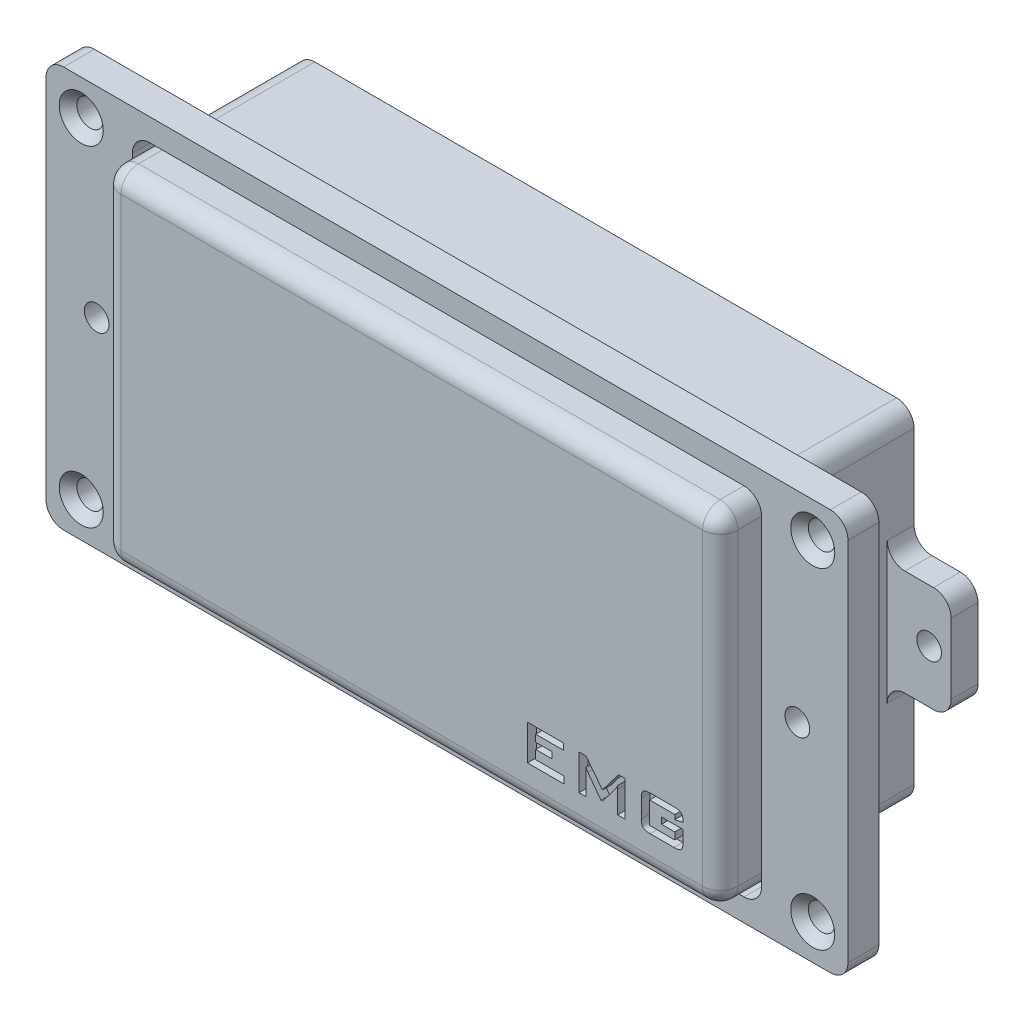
ISO-10303-21;
HEADER;
FILE_DESCRIPTION(('STEP AP214'),'2;1');
FILE_NAME('part.step','',(''),(''),'','','');
FILE_SCHEMA(('AUTOMOTIVE_DESIGN { 1 0 10303 214 1 1 1 1 }'));
ENDSEC;
DATA;
#1=APPLICATION_CONTEXT('core data for automotive mechanical design processes');
#2=APPLICATION_PROTOCOL_DEFINITION('international standard','automotive_design',2000,#1);
#3=PRODUCT_CONTEXT('',#1,'mechanical');
#4=PRODUCT('Part','Part','',(#3));
#5=PRODUCT_RELATED_PRODUCT_CATEGORY('part','',(#4));
#6=PRODUCT_DEFINITION_FORMATION('','',#4);
#7=PRODUCT_DEFINITION_CONTEXT('part definition',#1,'design');
#8=PRODUCT_DEFINITION('design','',#6,#7);
#9=PRODUCT_DEFINITION_SHAPE('','',#8);
#10=(LENGTH_UNIT() NAMED_UNIT(*) SI_UNIT(.MILLI.,.METRE.));
#11=(NAMED_UNIT(*) PLANE_ANGLE_UNIT() SI_UNIT($,.RADIAN.));
#12=(NAMED_UNIT(*) SI_UNIT($,.STERADIAN.) SOLID_ANGLE_UNIT());
#13=UNCERTAINTY_MEASURE_WITH_UNIT(LENGTH_MEASURE(1.E-05),#10,'distance_accuracy_value','');
#14=(GEOMETRIC_REPRESENTATION_CONTEXT(3) GLOBAL_UNCERTAINTY_ASSIGNED_CONTEXT((#13)) GLOBAL_UNIT_ASSIGNED_CONTEXT((#10,
#11,#12)) REPRESENTATION_CONTEXT('',''));
#15=CARTESIAN_POINT('',(0.,0.,0.));
#16=DIRECTION('',(0.,0.,1.));
#17=DIRECTION('',(1.,0.,0.));
#18=AXIS2_PLACEMENT_3D('',#15,#16,#17);
#19=CARTESIAN_POINT('',(0.,0.,-6.5));
#20=DIRECTION('',(0.,0.,1.));
#21=DIRECTION('',(1.,0.,0.));
#22=AXIS2_PLACEMENT_3D('',#19,#20,#21);
#23=PLANE('',#22);
#24=CARTESIAN_POINT('',(-41.5,-18.75,-6.5));
#25=DIRECTION('',(0.,0.,1.));
#26=DIRECTION('',(1.,0.,0.));
#27=AXIS2_PLACEMENT_3D('',#24,#25,#26);
#28=CIRCLE('',#27,2.);
#29=CARTESIAN_POINT('',(-39.5,-18.75,-6.5));
#30=VERTEX_POINT('',#29);
#31=EDGE_CURVE('E55',#30,#30,#28,.F.);
#32=ORIENTED_EDGE('',*,*,#31,.F.);
#33=EDGE_LOOP('',(#32));
#34=FACE_BOUND('',#33,.T.);
#35=CARTESIAN_POINT('',(41.5,18.75,-6.5));
#36=DIRECTION('',(0.,0.,1.));
#37=DIRECTION('',(1.,0.,0.));
#38=AXIS2_PLACEMENT_3D('',#35,#36,#37);
#39=CIRCLE('',#38,2.);
#40=CARTESIAN_POINT('',(43.5,18.75,-6.5));
#41=VERTEX_POINT('',#40);
#42=EDGE_CURVE('E378',#41,#41,#39,.F.);
#43=ORIENTED_EDGE('',*,*,#42,.F.);
#44=EDGE_LOOP('',(#43));
#45=FACE_BOUND('',#44,.T.);
#46=CARTESIAN_POINT('',(39.75,0.,-6.5));
#47=DIRECTION('',(0.,0.,1.));
#48=DIRECTION('',(1.,0.,0.));
#49=AXIS2_PLACEMENT_3D('',#46,#47,#48);
#50=CIRCLE('',#49,1.4);
#51=CARTESIAN_POINT('',(41.15,0.,-6.5));
#52=VERTEX_POINT('',#51);
#53=EDGE_CURVE('E240',#52,#52,#50,.F.);
#54=ORIENTED_EDGE('',*,*,#53,.F.);
#55=EDGE_LOOP('',(#54));
#56=FACE_BOUND('',#55,.T.);
#57=DIRECTION('',(0.,-1.,0.));
#58=VECTOR('',#57,1.);
#59=CARTESIAN_POINT('',(44.,21.25,-6.5));
#60=LINE('',#59,#58);
#61=CARTESIAN_POINT('',(44.,21.25,-6.5));
#62=VERTEX_POINT('',#61);
#63=CARTESIAN_POINT('',(44.,-21.25,-6.5));
#64=VERTEX_POINT('',#63);
#65=EDGE_CURVE('E186',#62,#64,#60,.T.);
#66=ORIENTED_EDGE('',*,*,#65,.T.);
#67=DIRECTION('',(-1.,0.,0.));
#68=VECTOR('',#67,1.);
#69=CARTESIAN_POINT('',(-44.,-21.25,-6.5));
#70=LINE('',#69,#68);
#71=CARTESIAN_POINT('',(-44.,-21.25,-6.5));
#72=VERTEX_POINT('',#71);
#73=EDGE_CURVE('E195',#64,#72,#70,.T.);
#74=ORIENTED_EDGE('',*,*,#73,.T.);
#75=DIRECTION('',(0.,1.,0.));
#76=VECTOR('',#75,1.);
#77=CARTESIAN_POINT('',(-44.,21.25,-6.5));
#78=LINE('',#77,#76);
#79=CARTESIAN_POINT('',(-44.,21.25,-6.5));
#80=VERTEX_POINT('',#79);
#81=EDGE_CURVE('E200',#72,#80,#78,.T.);
#82=ORIENTED_EDGE('',*,*,#81,.T.);
#83=DIRECTION('',(1.,0.,0.));
#84=VECTOR('',#83,1.);
#85=CARTESIAN_POINT('',(-44.,21.25,-6.5));
#86=LINE('',#85,#84);
#87=EDGE_CURVE('E192',#80,#62,#86,.T.);
#88=ORIENTED_EDGE('',*,*,#87,.T.);
#89=EDGE_LOOP('',(#66,#74,#82,#88));
#90=FACE_BOUND('',#89,.T.);
#91=DIRECTION('',(-1.,0.,0.));
#92=VECTOR('',#91,1.);
#93=CARTESIAN_POINT('',(0.,-20.2,-6.5));
#94=LINE('',#93,#92);
#95=CARTESIAN_POINT('',(33.7,-20.2,-6.5));
#96=VERTEX_POINT('',#95);
#97=CARTESIAN_POINT('',(-33.7,-20.2,-6.5));
#98=VERTEX_POINT('',#97);
#99=EDGE_CURVE('E232',#96,#98,#94,.T.);
#100=ORIENTED_EDGE('',*,*,#99,.F.);
#101=CARTESIAN_POINT('',(33.7,-18.2,-6.5));
#102=DIRECTION('',(0.,0.,1.));
#103=DIRECTION('',(1.,0.,0.));
#104=AXIS2_PLACEMENT_3D('',#101,#102,#103);
#105=CIRCLE('',#104,2.);
#106=CARTESIAN_POINT('',(35.7,-18.2,-6.5));
#107=VERTEX_POINT('',#106);
#108=EDGE_CURVE('E228',#107,#96,#105,.F.);
#109=ORIENTED_EDGE('',*,*,#108,.F.);
#110=DIRECTION('',(0.,1.,0.));
#111=VECTOR('',#110,1.);
#112=CARTESIAN_POINT('',(35.7,0.,-6.5));
#113=LINE('',#112,#111);
#114=CARTESIAN_POINT('',(35.7,18.2,-6.5));
#115=VERTEX_POINT('',#114);
#116=EDGE_CURVE('E70',#107,#115,#113,.T.);
#117=ORIENTED_EDGE('',*,*,#116,.T.);
#118=CARTESIAN_POINT('',(33.7,18.2,-6.5));
#119=DIRECTION('',(0.,0.,1.));
#120=DIRECTION('',(1.,0.,0.));
#121=AXIS2_PLACEMENT_3D('',#118,#119,#120);
#122=CIRCLE('',#121,2.);
#123=CARTESIAN_POINT('',(33.7,20.2,-6.5));
#124=VERTEX_POINT('',#123);
#125=EDGE_CURVE('E376',#124,#115,#122,.F.);
#126=ORIENTED_EDGE('',*,*,#125,.F.);
#127=DIRECTION('',(-1.,0.,0.));
#128=VECTOR('',#127,1.);
#129=CARTESIAN_POINT('',(0.,20.2,-6.5));
#130=LINE('',#129,#128);
#131=CARTESIAN_POINT('',(-33.7,20.2,-6.5));
#132=VERTEX_POINT('',#131);
#133=EDGE_CURVE('E225',#124,#132,#130,.T.);
#134=ORIENTED_EDGE('',*,*,#133,.T.);
#135=CARTESIAN_POINT('',(-33.7,18.2,-6.5));
#136=DIRECTION('',(0.,0.,1.));
#137=DIRECTION('',(1.,0.,0.));
#138=AXIS2_PLACEMENT_3D('',#135,#136,#137);
#139=CIRCLE('',#138,2.);
#140=CARTESIAN_POINT('',(-35.7,18.2,-6.5));
#141=VERTEX_POINT('',#140);
#142=EDGE_CURVE('E230',#141,#132,#139,.F.);
#143=ORIENTED_EDGE('',*,*,#142,.F.);
#144=DIRECTION('',(0.,1.,0.));
#145=VECTOR('',#144,1.);
#146=CARTESIAN_POINT('',(-35.7,0.,-6.5));
#147=LINE('',#146,#145);
#148=CARTESIAN_POINT('',(-35.7,-18.2,-6.5));
#149=VERTEX_POINT('',#148);
#150=EDGE_CURVE('E235',#149,#141,#147,.T.);
#151=ORIENTED_EDGE('',*,*,#150,.F.);
#152=CARTESIAN_POINT('',(-33.7,-18.2,-6.5));
#153=DIRECTION('',(0.,0.,1.));
#154=DIRECTION('',(1.,0.,0.));
#155=AXIS2_PLACEMENT_3D('',#152,#153,#154);
#156=CIRCLE('',#155,2.);
#157=EDGE_CURVE('E238',#98,#149,#156,.F.);
#158=ORIENTED_EDGE('',*,*,#157,.F.);
#159=EDGE_LOOP('',(#100,#109,#117,#126,#134,#143,#151,#158));
#160=FACE_BOUND('',#159,.T.);
#161=CARTESIAN_POINT('',(-39.75,0.,-6.5));
#162=DIRECTION('',(0.,0.,1.));
#163=DIRECTION('',(1.,0.,0.));
#164=AXIS2_PLACEMENT_3D('',#161,#162,#163);
#165=CIRCLE('',#164,1.4);
#166=CARTESIAN_POINT('',(-38.35,0.,-6.5));
#167=VERTEX_POINT('',#166);
#168=EDGE_CURVE('E243',#167,#167,#165,.F.);
#169=ORIENTED_EDGE('',*,*,#168,.F.);
#170=EDGE_LOOP('',(#169));
#171=FACE_BOUND('',#170,.T.);
#172=CARTESIAN_POINT('',(41.5,-18.75,-6.5));
#173=DIRECTION('',(0.,0.,1.));
#174=DIRECTION('',(1.,0.,0.));
#175=AXIS2_PLACEMENT_3D('',#172,#173,#174);
#176=CIRCLE('',#175,2.);
#177=CARTESIAN_POINT('',(43.5,-18.75,-6.5));
#178=VERTEX_POINT('',#177);
#179=EDGE_CURVE('E381',#178,#178,#176,.F.);
#180=ORIENTED_EDGE('',*,*,#179,.F.);
#181=EDGE_LOOP('',(#180));
#182=FACE_BOUND('',#181,.T.);
#183=CARTESIAN_POINT('',(-41.5,18.75,-6.5));
#184=DIRECTION('',(0.,0.,1.));
#185=DIRECTION('',(1.,0.,0.));
#186=AXIS2_PLACEMENT_3D('',#183,#184,#185);
#187=CIRCLE('',#186,2.);
#188=CARTESIAN_POINT('',(-39.5,18.75,-6.5));
#189=VERTEX_POINT('',#188);
#190=EDGE_CURVE('E12',#189,#189,#187,.F.);
#191=ORIENTED_EDGE('',*,*,#190,.F.);
#192=EDGE_LOOP('',(#191));
#193=FACE_BOUND('',#192,.T.);
#194=ADVANCED_FACE('F47',(#34,#45,#56,#90,#160,#171,#182,#193),#23,.F.);
#195=CARTESIAN_POINT('',(0.,0.,-7.5));
#196=DIRECTION('',(0.,0.,1.));
#197=DIRECTION('',(1.,0.,0.));
#198=AXIS2_PLACEMENT_3D('',#195,#196,#197);
#199=PLANE('',#198);
#200=DIRECTION('',(-1.,0.,0.));
#201=VECTOR('',#200,1.);
#202=CARTESIAN_POINT('',(-44.,-21.25,-7.5));
#203=LINE('',#202,#201);
#204=CARTESIAN_POINT('',(44.,-21.25,-7.5));
#205=VERTEX_POINT('',#204);
#206=CARTESIAN_POINT('',(-44.,-21.25,-7.5));
#207=VERTEX_POINT('',#206);
#208=EDGE_CURVE('E215',#205,#207,#203,.T.);
#209=ORIENTED_EDGE('',*,*,#208,.F.);
#210=DIRECTION('',(0.,-1.,0.));
#211=VECTOR('',#210,1.);
#212=CARTESIAN_POINT('',(44.,21.25,-7.5));
#213=LINE('',#212,#211);
#214=CARTESIAN_POINT('',(44.,21.25,-7.5));
#215=VERTEX_POINT('',#214);
#216=EDGE_CURVE('E62',#215,#205,#213,.T.);
#217=ORIENTED_EDGE('',*,*,#216,.F.);
#218=DIRECTION('',(1.,0.,0.));
#219=VECTOR('',#218,1.);
#220=CARTESIAN_POINT('',(-44.,21.25,-7.5));
#221=LINE('',#220,#219);
#222=CARTESIAN_POINT('',(-44.,21.25,-7.5));
#223=VERTEX_POINT('',#222);
#224=EDGE_CURVE('E203',#223,#215,#221,.T.);
#225=ORIENTED_EDGE('',*,*,#224,.F.);
#226=DIRECTION('',(0.,1.,0.));
#227=VECTOR('',#226,1.);
#228=CARTESIAN_POINT('',(-44.,21.25,-7.5));
#229=LINE('',#228,#227);
#230=EDGE_CURVE('E206',#207,#223,#229,.T.);
#231=ORIENTED_EDGE('',*,*,#230,.F.);
#232=EDGE_LOOP('',(#209,#217,#225,#231));
#233=FACE_BOUND('',#232,.T.);
#234=DIRECTION('',(1.,0.,0.));
#235=VECTOR('',#234,1.);
#236=CARTESIAN_POINT('',(0.,22.75,-7.5));
#237=LINE('',#236,#235);
#238=CARTESIAN_POINT('',(-43.5,22.75,-7.5));
#239=VERTEX_POINT('',#238);
#240=CARTESIAN_POINT('',(43.5,22.75,-7.5));
#241=VERTEX_POINT('',#240);
#242=EDGE_CURVE('E275',#239,#241,#237,.T.);
#243=ORIENTED_EDGE('',*,*,#242,.T.);
#244=CARTESIAN_POINT('',(43.5,20.75,-7.5));
#245=DIRECTION('',(0.,0.,1.));
#246=DIRECTION('',(1.,0.,0.));
#247=AXIS2_PLACEMENT_3D('',#244,#245,#246);
#248=CIRCLE('',#247,2.);
#249=CARTESIAN_POINT('',(45.5,20.75,-7.5));
#250=VERTEX_POINT('',#249);
#251=EDGE_CURVE('E312',#241,#250,#248,.F.);
#252=ORIENTED_EDGE('',*,*,#251,.T.);
#253=DIRECTION('',(0.,-1.,0.));
#254=VECTOR('',#253,1.);
#255=CARTESIAN_POINT('',(45.5,0.,-7.5));
#256=LINE('',#255,#254);
#257=CARTESIAN_POINT('',(45.5,-20.75,-7.5));
#258=VERTEX_POINT('',#257);
#259=EDGE_CURVE('E272',#250,#258,#256,.T.);
#260=ORIENTED_EDGE('',*,*,#259,.T.);
#261=CARTESIAN_POINT('',(43.5,-20.75,-7.5));
#262=DIRECTION('',(0.,0.,1.));
#263=DIRECTION('',(1.,0.,0.));
#264=AXIS2_PLACEMENT_3D('',#261,#262,#263);
#265=CIRCLE('',#264,2.);
#266=CARTESIAN_POINT('',(43.5,-22.75,-7.5));
#267=VERTEX_POINT('',#266);
#268=EDGE_CURVE('E306',#258,#267,#265,.F.);
#269=ORIENTED_EDGE('',*,*,#268,.T.);
#270=DIRECTION('',(1.,0.,0.));
#271=VECTOR('',#270,1.);
#272=CARTESIAN_POINT('',(0.,-22.75,-7.5));
#273=LINE('',#272,#271);
#274=CARTESIAN_POINT('',(-43.5,-22.75,-7.5));
#275=VERTEX_POINT('',#274);
#276=EDGE_CURVE('E281',#275,#267,#273,.T.);
#277=ORIENTED_EDGE('',*,*,#276,.F.);
#278=CARTESIAN_POINT('',(-43.5,-20.75,-7.5));
#279=DIRECTION('',(0.,0.,1.));
#280=DIRECTION('',(1.,0.,0.));
#281=AXIS2_PLACEMENT_3D('',#278,#279,#280);
#282=CIRCLE('',#281,2.);
#283=CARTESIAN_POINT('',(-45.5,-20.75,-7.5));
#284=VERTEX_POINT('',#283);
#285=EDGE_CURVE('E308',#275,#284,#282,.F.);
#286=ORIENTED_EDGE('',*,*,#285,.T.);
#287=DIRECTION('',(0.,-1.,0.));
#288=VECTOR('',#287,1.);
#289=CARTESIAN_POINT('',(-45.5,0.,-7.5));
#290=LINE('',#289,#288);
#291=CARTESIAN_POINT('',(-45.5,20.75,-7.5));
#292=VERTEX_POINT('',#291);
#293=EDGE_CURVE('E278',#292,#284,#290,.T.);
#294=ORIENTED_EDGE('',*,*,#293,.F.);
#295=CARTESIAN_POINT('',(-43.5,20.75,-7.5));
#296=DIRECTION('',(0.,0.,1.));
#297=DIRECTION('',(1.,0.,0.));
#298=AXIS2_PLACEMENT_3D('',#295,#296,#297);
#299=CIRCLE('',#298,2.);
#300=EDGE_CURVE('E310',#292,#239,#299,.F.);
#301=ORIENTED_EDGE('',*,*,#300,.T.);
#302=EDGE_LOOP('',(#243,#252,#260,#269,#277,#286,#294,#301));
#303=FACE_BOUND('',#302,.T.);
#304=ADVANCED_FACE('F390',(#233,#303),#199,.F.);
#305=CARTESIAN_POINT('',(0.,0.,-4.));
#306=DIRECTION('',(0.,0.,1.));
#307=DIRECTION('',(1.,0.,0.));
#308=AXIS2_PLACEMENT_3D('',#305,#306,#307);
#309=PLANE('',#308);
#310=CARTESIAN_POINT('',(-41.5,-18.75,-4.));
#311=DIRECTION('',(0.,0.,1.));
#312=DIRECTION('',(1.,0.,0.));
#313=AXIS2_PLACEMENT_3D('',#310,#311,#312);
#314=CIRCLE('',#313,2.5);
#315=CARTESIAN_POINT('',(-39.,-18.75,-4.));
#316=VERTEX_POINT('',#315);
#317=EDGE_CURVE('E361',#316,#316,#314,.F.);
#318=ORIENTED_EDGE('',*,*,#317,.T.);
#319=EDGE_LOOP('',(#318));
#320=FACE_BOUND('',#319,.T.);
#321=CARTESIAN_POINT('',(-41.5,18.75,-4.));
#322=DIRECTION('',(0.,0.,1.));
#323=DIRECTION('',(1.,0.,0.));
#324=AXIS2_PLACEMENT_3D('',#321,#322,#323);
#325=CIRCLE('',#324,2.50000000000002);
#326=CARTESIAN_POINT('',(-39.,18.75,-4.));
#327=VERTEX_POINT('',#326);
#328=EDGE_CURVE('E358',#327,#327,#325,.F.);
#329=ORIENTED_EDGE('',*,*,#328,.T.);
#330=EDGE_LOOP('',(#329));
#331=FACE_BOUND('',#330,.T.);
#332=CARTESIAN_POINT('',(41.5,18.75,-4.));
#333=DIRECTION('',(0.,0.,1.));
#334=DIRECTION('',(1.,0.,0.));
#335=AXIS2_PLACEMENT_3D('',#332,#333,#334);
#336=CIRCLE('',#335,2.5);
#337=CARTESIAN_POINT('',(44.,18.75,-4.));
#338=VERTEX_POINT('',#337);
#339=EDGE_CURVE('E355',#338,#338,#336,.F.);
#340=ORIENTED_EDGE('',*,*,#339,.T.);
#341=EDGE_LOOP('',(#340));
#342=FACE_BOUND('',#341,.T.);
#343=CARTESIAN_POINT('',(41.5,-18.75,-4.));
#344=DIRECTION('',(0.,0.,1.));
#345=DIRECTION('',(1.,0.,0.));
#346=AXIS2_PLACEMENT_3D('',#343,#344,#345);
#347=CIRCLE('',#346,2.50000000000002);
#348=CARTESIAN_POINT('',(44.,-18.75,-4.));
#349=VERTEX_POINT('',#348);
#350=EDGE_CURVE('E352',#349,#349,#347,.F.);
#351=ORIENTED_EDGE('',*,*,#350,.T.);
#352=EDGE_LOOP('',(#351));
#353=FACE_BOUND('',#352,.T.);
#354=CARTESIAN_POINT('',(39.75,0.,-4.));
#355=DIRECTION('',(0.,0.,1.));
#356=DIRECTION('',(1.,0.,0.));
#357=AXIS2_PLACEMENT_3D('',#354,#355,#356);
#358=CIRCLE('',#357,1.4);
#359=CARTESIAN_POINT('',(41.15,0.,-4.));
#360=VERTEX_POINT('',#359);
#361=EDGE_CURVE('E251',#360,#360,#358,.T.);
#362=ORIENTED_EDGE('',*,*,#361,.F.);
#363=EDGE_LOOP('',(#362));
#364=FACE_BOUND('',#363,.T.);
#365=CARTESIAN_POINT('',(-39.75,0.,-4.));
#366=DIRECTION('',(0.,0.,1.));
#367=DIRECTION('',(1.,0.,0.));
#368=AXIS2_PLACEMENT_3D('',#365,#366,#367);
#369=CIRCLE('',#368,1.4);
#370=CARTESIAN_POINT('',(-38.35,0.,-4.));
#371=VERTEX_POINT('',#370);
#372=EDGE_CURVE('E246',#371,#371,#369,.T.);
#373=ORIENTED_EDGE('',*,*,#372,.F.);
#374=EDGE_LOOP('',(#373));
#375=FACE_BOUND('',#374,.T.);
#376=DIRECTION('',(1.,0.,0.));
#377=VECTOR('',#376,1.);
#378=CARTESIAN_POINT('',(-35.7,-20.2,-4.));
#379=LINE('',#378,#377);
#380=CARTESIAN_POINT('',(-33.7,-20.2,-4.));
#381=VERTEX_POINT('',#380);
#382=CARTESIAN_POINT('',(33.7,-20.2,-4.));
#383=VERTEX_POINT('',#382);
#384=EDGE_CURVE('E257',#381,#383,#379,.T.);
#385=ORIENTED_EDGE('',*,*,#384,.F.);
#386=CARTESIAN_POINT('',(-33.7,-18.2,-4.));
#387=DIRECTION('',(0.,0.,1.));
#388=DIRECTION('',(1.,0.,0.));
#389=AXIS2_PLACEMENT_3D('',#386,#387,#388);
#390=CIRCLE('',#389,2.);
#391=CARTESIAN_POINT('',(-35.7,-18.2,-4.));
#392=VERTEX_POINT('',#391);
#393=EDGE_CURVE('E346',#381,#392,#390,.F.);
#394=ORIENTED_EDGE('',*,*,#393,.T.);
#395=DIRECTION('',(0.,-1.,0.));
#396=VECTOR('',#395,1.);
#397=CARTESIAN_POINT('',(-35.7,20.2,-4.));
#398=LINE('',#397,#396);
#399=CARTESIAN_POINT('',(-35.7,18.2,-4.));
#400=VERTEX_POINT('',#399);
#401=EDGE_CURVE('E254',#400,#392,#398,.T.);
#402=ORIENTED_EDGE('',*,*,#401,.F.);
#403=CARTESIAN_POINT('',(-33.7,18.2,-4.));
#404=DIRECTION('',(0.,0.,1.));
#405=DIRECTION('',(1.,0.,0.));
#406=AXIS2_PLACEMENT_3D('',#403,#404,#405);
#407=CIRCLE('',#406,2.);
#408=CARTESIAN_POINT('',(-33.7,20.2,-4.));
#409=VERTEX_POINT('',#408);
#410=EDGE_CURVE('E344',#400,#409,#407,.F.);
#411=ORIENTED_EDGE('',*,*,#410,.T.);
#412=DIRECTION('',(-1.,0.,0.));
#413=VECTOR('',#412,1.);
#414=CARTESIAN_POINT('',(-35.7,20.2,-4.));
#415=LINE('',#414,#413);
#416=CARTESIAN_POINT('',(33.7,20.2,-4.));
#417=VERTEX_POINT('',#416);
#418=EDGE_CURVE('E250',#417,#409,#415,.T.);
#419=ORIENTED_EDGE('',*,*,#418,.F.);
#420=CARTESIAN_POINT('',(33.7,18.2,-4.));
#421=DIRECTION('',(0.,0.,1.));
#422=DIRECTION('',(1.,0.,0.));
#423=AXIS2_PLACEMENT_3D('',#420,#421,#422);
#424=CIRCLE('',#423,2.);
#425=CARTESIAN_POINT('',(35.7,18.2,-4.));
#426=VERTEX_POINT('',#425);
#427=EDGE_CURVE('E350',#417,#426,#424,.F.);
#428=ORIENTED_EDGE('',*,*,#427,.T.);
#429=DIRECTION('',(0.,1.,0.));
#430=VECTOR('',#429,1.);
#431=CARTESIAN_POINT('',(35.7,20.2,-4.));
#432=LINE('',#431,#430);
#433=CARTESIAN_POINT('',(35.7,-18.2,-4.));
#434=VERTEX_POINT('',#433);
#435=EDGE_CURVE('E247',#434,#426,#432,.T.);
#436=ORIENTED_EDGE('',*,*,#435,.F.);
#437=CARTESIAN_POINT('',(33.7,-18.2,-4.));
#438=DIRECTION('',(0.,0.,1.));
#439=DIRECTION('',(1.,0.,0.));
#440=AXIS2_PLACEMENT_3D('',#437,#438,#439);
#441=CIRCLE('',#440,2.);
#442=EDGE_CURVE('E348',#434,#383,#441,.F.);
#443=ORIENTED_EDGE('',*,*,#442,.T.);
#444=EDGE_LOOP('',(#385,#394,#402,#411,#419,#428,#436,#443));
#445=FACE_BOUND('',#444,.T.);
#446=DIRECTION('',(0.,1.,0.));
#447=VECTOR('',#446,1.);
#448=CARTESIAN_POINT('',(45.5,22.75,-4.));
#449=LINE('',#448,#447);
#450=CARTESIAN_POINT('',(45.5,-20.75,-4.));
#451=VERTEX_POINT('',#450);
#452=CARTESIAN_POINT('',(45.5,20.75,-4.));
#453=VERTEX_POINT('',#452);
#454=EDGE_CURVE('E260',#451,#453,#449,.T.);
#455=ORIENTED_EDGE('',*,*,#454,.T.);
#456=CARTESIAN_POINT('',(43.5,20.75,-4.));
#457=DIRECTION('',(0.,0.,1.));
#458=DIRECTION('',(1.,0.,0.));
#459=AXIS2_PLACEMENT_3D('',#456,#457,#458);
#460=CIRCLE('',#459,2.);
#461=CARTESIAN_POINT('',(43.5,22.75,-4.));
#462=VERTEX_POINT('',#461);
#463=EDGE_CURVE('E299',#453,#462,#460,.T.);
#464=ORIENTED_EDGE('',*,*,#463,.T.);
#465=DIRECTION('',(-1.,0.,0.));
#466=VECTOR('',#465,1.);
#467=CARTESIAN_POINT('',(-45.5,22.75,-4.));
#468=LINE('',#467,#466);
#469=CARTESIAN_POINT('',(-43.5,22.75,-4.));
#470=VERTEX_POINT('',#469);
#471=EDGE_CURVE('E263',#462,#470,#468,.T.);
#472=ORIENTED_EDGE('',*,*,#471,.T.);
#473=CARTESIAN_POINT('',(-43.5,20.75,-4.));
#474=DIRECTION('',(0.,0.,1.));
#475=DIRECTION('',(1.,0.,0.));
#476=AXIS2_PLACEMENT_3D('',#473,#474,#475);
#477=CIRCLE('',#476,2.);
#478=CARTESIAN_POINT('',(-45.5,20.75,-4.));
#479=VERTEX_POINT('',#478);
#480=EDGE_CURVE('E297',#470,#479,#477,.T.);
#481=ORIENTED_EDGE('',*,*,#480,.T.);
#482=DIRECTION('',(0.,-1.,0.));
#483=VECTOR('',#482,1.);
#484=CARTESIAN_POINT('',(-45.5,22.75,-4.));
#485=LINE('',#484,#483);
#486=CARTESIAN_POINT('',(-45.5,-20.75,-4.));
#487=VERTEX_POINT('',#486);
#488=EDGE_CURVE('E266',#479,#487,#485,.T.);
#489=ORIENTED_EDGE('',*,*,#488,.T.);
#490=CARTESIAN_POINT('',(-43.5,-20.75,-4.));
#491=DIRECTION('',(0.,0.,1.));
#492=DIRECTION('',(1.,0.,0.));
#493=AXIS2_PLACEMENT_3D('',#490,#491,#492);
#494=CIRCLE('',#493,2.);
#495=CARTESIAN_POINT('',(-43.5,-22.75,-4.));
#496=VERTEX_POINT('',#495);
#497=EDGE_CURVE('E295',#487,#496,#494,.T.);
#498=ORIENTED_EDGE('',*,*,#497,.T.);
#499=DIRECTION('',(1.,0.,0.));
#500=VECTOR('',#499,1.);
#501=CARTESIAN_POINT('',(-45.5,-22.75,-4.));
#502=LINE('',#501,#500);
#503=CARTESIAN_POINT('',(43.5,-22.75,-4.));
#504=VERTEX_POINT('',#503);
#505=EDGE_CURVE('E269',#496,#504,#502,.T.);
#506=ORIENTED_EDGE('',*,*,#505,.T.);
#507=CARTESIAN_POINT('',(43.5,-20.75,-4.));
#508=DIRECTION('',(0.,0.,1.));
#509=DIRECTION('',(1.,0.,0.));
#510=AXIS2_PLACEMENT_3D('',#507,#508,#509);
#511=CIRCLE('',#510,2.);
#512=EDGE_CURVE('E293',#504,#451,#511,.T.);
#513=ORIENTED_EDGE('',*,*,#512,.T.);
#514=EDGE_LOOP('',(#455,#464,#472,#481,#489,#498,#506,#513));
#515=FACE_BOUND('',#514,.T.);
#516=ADVANCED_FACE('F404',(#320,#331,#342,#353,#364,#375,#445,#515),#309,.T.);
#517=CARTESIAN_POINT('',(0.,20.2,-7.5));
#518=DIRECTION('',(0.,-1.,0.));
#519=DIRECTION('',(0.,0.,-1.));
#520=AXIS2_PLACEMENT_3D('',#517,#518,#519);
#521=PLANE('',#520);
#522=ORIENTED_EDGE('',*,*,#133,.F.);
#523=DIRECTION('',(0.,0.,1.));
#524=VECTOR('',#523,1.);
#525=CARTESIAN_POINT('',(33.7,20.2,-4.));
#526=LINE('',#525,#524);
#527=EDGE_CURVE('E329',#124,#417,#526,.T.);
#528=ORIENTED_EDGE('',*,*,#527,.T.);
#529=ORIENTED_EDGE('',*,*,#418,.T.);
#530=DIRECTION('',(0.,0.,1.));
#531=VECTOR('',#530,1.);
#532=CARTESIAN_POINT('',(-33.7,20.2,-7.5));
#533=LINE('',#532,#531);
#534=EDGE_CURVE('E331',#409,#132,#533,.F.);
#535=ORIENTED_EDGE('',*,*,#534,.T.);
#536=EDGE_LOOP('',(#522,#528,#529,#535));
#537=FACE_BOUND('',#536,.T.);
#538=ADVANCED_FACE('F407',(#537),#521,.T.);
#539=CARTESIAN_POINT('',(-35.7,0.,-7.5));
#540=DIRECTION('',(-1.,0.,0.));
#541=DIRECTION('',(0.,0.,1.));
#542=AXIS2_PLACEMENT_3D('',#539,#540,#541);
#543=PLANE('',#542);
#544=DIRECTION('',(0.,0.,1.));
#545=VECTOR('',#544,1.);
#546=CARTESIAN_POINT('',(-35.7,-18.2,-7.5));
#547=LINE('',#546,#545);
#548=EDGE_CURVE('E324',#392,#149,#547,.F.);
#549=ORIENTED_EDGE('',*,*,#548,.T.);
#550=ORIENTED_EDGE('',*,*,#150,.T.);
#551=DIRECTION('',(0.,0.,1.));
#552=VECTOR('',#551,1.);
#553=CARTESIAN_POINT('',(-35.7,18.2,-7.5));
#554=LINE('',#553,#552);
#555=EDGE_CURVE('E327',#141,#400,#554,.T.);
#556=ORIENTED_EDGE('',*,*,#555,.T.);
#557=ORIENTED_EDGE('',*,*,#401,.T.);
#558=EDGE_LOOP('',(#549,#550,#556,#557));
#559=FACE_BOUND('',#558,.T.);
#560=ADVANCED_FACE('F575',(#559),#543,.F.);
#561=CARTESIAN_POINT('',(0.,-20.2,-7.5));
#562=DIRECTION('',(0.,-1.,0.));
#563=DIRECTION('',(0.,0.,-1.));
#564=AXIS2_PLACEMENT_3D('',#561,#562,#563);
#565=PLANE('',#564);
#566=DIRECTION('',(0.,0.,1.));
#567=VECTOR('',#566,1.);
#568=CARTESIAN_POINT('',(33.7,-20.2,-7.5));
#569=LINE('',#568,#567);
#570=EDGE_CURVE('E334',#383,#96,#569,.F.);
#571=ORIENTED_EDGE('',*,*,#570,.T.);
#572=ORIENTED_EDGE('',*,*,#99,.T.);
#573=DIRECTION('',(0.,0.,1.));
#574=VECTOR('',#573,1.);
#575=CARTESIAN_POINT('',(-33.7,-20.2,-4.));
#576=LINE('',#575,#574);
#577=EDGE_CURVE('E337',#98,#381,#576,.T.);
#578=ORIENTED_EDGE('',*,*,#577,.T.);
#579=ORIENTED_EDGE('',*,*,#384,.T.);
#580=EDGE_LOOP('',(#571,#572,#578,#579));
#581=FACE_BOUND('',#580,.T.);
#582=ADVANCED_FACE('F578',(#581),#565,.F.);
#583=CARTESIAN_POINT('',(45.5,0.,-7.5));
#584=DIRECTION('',(-1.,0.,0.));
#585=DIRECTION('',(0.,0.,1.));
#586=AXIS2_PLACEMENT_3D('',#583,#584,#585);
#587=PLANE('',#586);
#588=ORIENTED_EDGE('',*,*,#259,.F.);
#589=DIRECTION('',(0.,0.,1.));
#590=VECTOR('',#589,1.);
#591=CARTESIAN_POINT('',(45.5,20.75,-7.5));
#592=LINE('',#591,#590);
#593=EDGE_CURVE('E290',#250,#453,#592,.T.);
#594=ORIENTED_EDGE('',*,*,#593,.T.);
#595=ORIENTED_EDGE('',*,*,#454,.F.);
#596=DIRECTION('',(0.,0.,1.));
#597=VECTOR('',#596,1.);
#598=CARTESIAN_POINT('',(45.5,-20.75,-7.5));
#599=LINE('',#598,#597);
#600=EDGE_CURVE('E284',#451,#258,#599,.F.);
#601=ORIENTED_EDGE('',*,*,#600,.T.);
#602=EDGE_LOOP('',(#588,#594,#595,#601));
#603=FACE_BOUND('',#602,.T.);
#604=ADVANCED_FACE('F419',(#603),#587,.F.);
#605=CARTESIAN_POINT('',(0.,-22.75,-7.5));
#606=DIRECTION('',(0.,-1.,0.));
#607=DIRECTION('',(0.,0.,-1.));
#608=AXIS2_PLACEMENT_3D('',#605,#606,#607);
#609=PLANE('',#608);
#610=ORIENTED_EDGE('',*,*,#505,.F.);
#611=DIRECTION('',(0.,0.,1.));
#612=VECTOR('',#611,1.);
#613=CARTESIAN_POINT('',(-43.5,-22.75,-7.5));
#614=LINE('',#613,#612);
#615=EDGE_CURVE('E322',#496,#275,#614,.F.);
#616=ORIENTED_EDGE('',*,*,#615,.T.);
#617=ORIENTED_EDGE('',*,*,#276,.T.);
#618=DIRECTION('',(0.,0.,1.));
#619=VECTOR('',#618,1.);
#620=CARTESIAN_POINT('',(43.5,-22.75,-4.));
#621=LINE('',#620,#619);
#622=EDGE_CURVE('E319',#267,#504,#621,.T.);
#623=ORIENTED_EDGE('',*,*,#622,.T.);
#624=EDGE_LOOP('',(#610,#616,#617,#623));
#625=FACE_BOUND('',#624,.T.);
#626=ADVANCED_FACE('F430',(#625),#609,.T.);
#627=CARTESIAN_POINT('',(-45.5,0.,-7.5));
#628=DIRECTION('',(-1.,0.,0.));
#629=DIRECTION('',(0.,0.,1.));
#630=AXIS2_PLACEMENT_3D('',#627,#628,#629);
#631=PLANE('',#630);
#632=ORIENTED_EDGE('',*,*,#488,.F.);
#633=DIRECTION('',(0.,0.,1.));
#634=VECTOR('',#633,1.);
#635=CARTESIAN_POINT('',(-45.5,20.75,-7.5));
#636=LINE('',#635,#634);
#637=EDGE_CURVE('E317',#479,#292,#636,.F.);
#638=ORIENTED_EDGE('',*,*,#637,.T.);
#639=ORIENTED_EDGE('',*,*,#293,.T.);
#640=DIRECTION('',(0.,0.,1.));
#641=VECTOR('',#640,1.);
#642=CARTESIAN_POINT('',(-45.5,-20.75,-7.5));
#643=LINE('',#642,#641);
#644=EDGE_CURVE('E314',#284,#487,#643,.T.);
#645=ORIENTED_EDGE('',*,*,#644,.T.);
#646=EDGE_LOOP('',(#632,#638,#639,#645));
#647=FACE_BOUND('',#646,.T.);
#648=ADVANCED_FACE('F439',(#647),#631,.T.);
#649=CARTESIAN_POINT('',(0.,22.75,-7.5));
#650=DIRECTION('',(0.,-1.,0.));
#651=DIRECTION('',(0.,0.,-1.));
#652=AXIS2_PLACEMENT_3D('',#649,#650,#651);
#653=PLANE('',#652);
#654=ORIENTED_EDGE('',*,*,#471,.F.);
#655=DIRECTION('',(0.,0.,1.));
#656=VECTOR('',#655,1.);
#657=CARTESIAN_POINT('',(43.5,22.75,-7.5));
#658=LINE('',#657,#656);
#659=EDGE_CURVE('E304',#462,#241,#658,.F.);
#660=ORIENTED_EDGE('',*,*,#659,.T.);
#661=ORIENTED_EDGE('',*,*,#242,.F.);
#662=DIRECTION('',(0.,0.,1.));
#663=VECTOR('',#662,1.);
#664=CARTESIAN_POINT('',(-43.5,22.75,-4.));
#665=LINE('',#664,#663);
#666=EDGE_CURVE('E301',#239,#470,#665,.T.);
#667=ORIENTED_EDGE('',*,*,#666,.T.);
#668=EDGE_LOOP('',(#654,#660,#661,#667));
#669=FACE_BOUND('',#668,.T.);
#670=ADVANCED_FACE('F447',(#669),#653,.F.);
#671=CARTESIAN_POINT('',(35.7,0.,-7.5));
#672=DIRECTION('',(-1.,0.,0.));
#673=DIRECTION('',(0.,0.,1.));
#674=AXIS2_PLACEMENT_3D('',#671,#672,#673);
#675=PLANE('',#674);
#676=ORIENTED_EDGE('',*,*,#116,.F.);
#677=DIRECTION('',(0.,0.,1.));
#678=VECTOR('',#677,1.);
#679=CARTESIAN_POINT('',(35.7,-18.2,-7.5));
#680=LINE('',#679,#678);
#681=EDGE_CURVE('E342',#107,#434,#680,.T.);
#682=ORIENTED_EDGE('',*,*,#681,.T.);
#683=ORIENTED_EDGE('',*,*,#435,.T.);
#684=DIRECTION('',(0.,0.,1.));
#685=VECTOR('',#684,1.);
#686=CARTESIAN_POINT('',(35.7,18.2,-7.5));
#687=LINE('',#686,#685);
#688=EDGE_CURVE('E339',#426,#115,#687,.F.);
#689=ORIENTED_EDGE('',*,*,#688,.T.);
#690=EDGE_LOOP('',(#676,#682,#683,#689));
#691=FACE_BOUND('',#690,.T.);
#692=ADVANCED_FACE('F569',(#691),#675,.T.);
#693=CARTESIAN_POINT('',(-39.75,0.,42.));
#694=DIRECTION('',(0.,0.,-1.));
#695=DIRECTION('',(-1.,0.,0.));
#696=AXIS2_PLACEMENT_3D('',#693,#694,#695);
#697=CYLINDRICAL_SURFACE('',#696,1.4);
#698=ORIENTED_EDGE('',*,*,#168,.T.);
#699=EDGE_LOOP('',(#698));
#700=FACE_BOUND('',#699,.T.);
#701=ORIENTED_EDGE('',*,*,#372,.T.);
#702=EDGE_LOOP('',(#701));
#703=FACE_BOUND('',#702,.T.);
#704=ADVANCED_FACE('F400',(#700,#703),#697,.F.);
#705=CARTESIAN_POINT('',(39.75,0.,42.));
#706=DIRECTION('',(0.,0.,-1.));
#707=DIRECTION('',(-1.,0.,0.));
#708=AXIS2_PLACEMENT_3D('',#705,#706,#707);
#709=CYLINDRICAL_SURFACE('',#708,1.4);
#710=ORIENTED_EDGE('',*,*,#53,.T.);
#711=EDGE_LOOP('',(#710));
#712=FACE_BOUND('',#711,.T.);
#713=ORIENTED_EDGE('',*,*,#361,.T.);
#714=EDGE_LOOP('',(#713));
#715=FACE_BOUND('',#714,.T.);
#716=ADVANCED_FACE('F396',(#712,#715),#709,.F.);
#717=CARTESIAN_POINT('',(-41.5,18.75,-14.));
#718=DIRECTION('',(0.,0.,1.));
#719=DIRECTION('',(1.,0.,0.));
#720=AXIS2_PLACEMENT_3D('',#717,#718,#719);
#721=CYLINDRICAL_SURFACE('',#720,1.5);
#722=CARTESIAN_POINT('',(-41.5,18.75,-5.));
#723=DIRECTION('',(0.,0.,1.));
#724=DIRECTION('',(1.,0.,0.));
#725=AXIS2_PLACEMENT_3D('',#722,#723,#724);
#726=CIRCLE('',#725,1.5);
#727=CARTESIAN_POINT('',(-40.,18.75,-5.));
#728=VERTEX_POINT('',#727);
#729=EDGE_CURVE('E367',#728,#728,#726,.T.);
#730=ORIENTED_EDGE('',*,*,#729,.T.);
#731=EDGE_LOOP('',(#730));
#732=FACE_BOUND('',#731,.T.);
#733=CARTESIAN_POINT('',(-41.5,18.75,-7.5));
#734=DIRECTION('',(0.,0.,-1.));
#735=DIRECTION('',(-1.,0.,0.));
#736=AXIS2_PLACEMENT_3D('',#733,#734,#735);
#737=CIRCLE('',#736,1.5);
#738=CARTESIAN_POINT('',(-43.,18.75,-7.5));
#739=VERTEX_POINT('',#738);
#740=EDGE_CURVE('E702',#739,#739,#737,.T.);
#741=ORIENTED_EDGE('',*,*,#740,.T.);
#742=EDGE_LOOP('',(#741));
#743=FACE_BOUND('',#742,.T.);
#744=ADVANCED_FACE('F399',(#732,#743),#721,.F.);
#745=CARTESIAN_POINT('',(-41.5,-18.75,-14.));
#746=DIRECTION('',(0.,0.,1.));
#747=DIRECTION('',(1.,0.,0.));
#748=AXIS2_PLACEMENT_3D('',#745,#746,#747);
#749=CYLINDRICAL_SURFACE('',#748,1.5);
#750=CARTESIAN_POINT('',(-41.5,-18.75,-5.00000000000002));
#751=DIRECTION('',(0.,0.,1.));
#752=DIRECTION('',(1.,0.,0.));
#753=AXIS2_PLACEMENT_3D('',#750,#751,#752);
#754=CIRCLE('',#753,1.5);
#755=CARTESIAN_POINT('',(-40.,-18.75,-5.00000000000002));
#756=VERTEX_POINT('',#755);
#757=EDGE_CURVE('E364',#756,#756,#754,.T.);
#758=ORIENTED_EDGE('',*,*,#757,.T.);
#759=EDGE_LOOP('',(#758));
#760=FACE_BOUND('',#759,.T.);
#761=CARTESIAN_POINT('',(-41.5,-18.75,-7.5));
#762=DIRECTION('',(0.,0.,-1.));
#763=DIRECTION('',(-1.,0.,0.));
#764=AXIS2_PLACEMENT_3D('',#761,#762,#763);
#765=CIRCLE('',#764,1.5);
#766=CARTESIAN_POINT('',(-43.,-18.75,-7.5));
#767=VERTEX_POINT('',#766);
#768=EDGE_CURVE('E523',#767,#767,#765,.T.);
#769=ORIENTED_EDGE('',*,*,#768,.T.);
#770=EDGE_LOOP('',(#769));
#771=FACE_BOUND('',#770,.T.);
#772=ADVANCED_FACE('F510',(#760,#771),#749,.F.);
#773=CARTESIAN_POINT('',(41.5,-18.75,-14.));
#774=DIRECTION('',(0.,0.,1.));
#775=DIRECTION('',(1.,0.,0.));
#776=AXIS2_PLACEMENT_3D('',#773,#774,#775);
#777=CYLINDRICAL_SURFACE('',#776,1.5);
#778=CARTESIAN_POINT('',(41.5,-18.75,-5.));
#779=DIRECTION('',(0.,0.,1.));
#780=DIRECTION('',(1.,0.,0.));
#781=AXIS2_PLACEMENT_3D('',#778,#779,#780);
#782=CIRCLE('',#781,1.5);
#783=CARTESIAN_POINT('',(43.,-18.75,-5.));
#784=VERTEX_POINT('',#783);
#785=EDGE_CURVE('E373',#784,#784,#782,.T.);
#786=ORIENTED_EDGE('',*,*,#785,.T.);
#787=EDGE_LOOP('',(#786));
#788=FACE_BOUND('',#787,.T.);
#789=CARTESIAN_POINT('',(41.5,-18.75,-7.5));
#790=DIRECTION('',(0.,0.,-1.));
#791=DIRECTION('',(-1.,0.,0.));
#792=AXIS2_PLACEMENT_3D('',#789,#790,#791);
#793=CIRCLE('',#792,1.5);
#794=CARTESIAN_POINT('',(40.,-18.75,-7.5));
#795=VERTEX_POINT('',#794);
#796=EDGE_CURVE('E514',#795,#795,#793,.T.);
#797=ORIENTED_EDGE('',*,*,#796,.T.);
#798=EDGE_LOOP('',(#797));
#799=FACE_BOUND('',#798,.T.);
#800=ADVANCED_FACE('F459',(#788,#799),#777,.F.);
#801=CARTESIAN_POINT('',(41.5,18.75,-14.));
#802=DIRECTION('',(0.,0.,1.));
#803=DIRECTION('',(1.,0.,0.));
#804=AXIS2_PLACEMENT_3D('',#801,#802,#803);
#805=CYLINDRICAL_SURFACE('',#804,1.5);
#806=CARTESIAN_POINT('',(41.5,18.75,-5.00000000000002));
#807=DIRECTION('',(0.,0.,1.));
#808=DIRECTION('',(1.,0.,0.));
#809=AXIS2_PLACEMENT_3D('',#806,#807,#808);
#810=CIRCLE('',#809,1.5);
#811=CARTESIAN_POINT('',(43.,18.75,-5.00000000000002));
#812=VERTEX_POINT('',#811);
#813=EDGE_CURVE('E370',#812,#812,#810,.T.);
#814=ORIENTED_EDGE('',*,*,#813,.T.);
#815=EDGE_LOOP('',(#814));
#816=FACE_BOUND('',#815,.T.);
#817=CARTESIAN_POINT('',(41.5,18.75,-7.5));
#818=DIRECTION('',(0.,0.,-1.));
#819=DIRECTION('',(-1.,0.,0.));
#820=AXIS2_PLACEMENT_3D('',#817,#818,#819);
#821=CIRCLE('',#820,1.5);
#822=CARTESIAN_POINT('',(40.,18.75,-7.5));
#823=VERTEX_POINT('',#822);
#824=EDGE_CURVE('E520',#823,#823,#821,.T.);
#825=ORIENTED_EDGE('',*,*,#824,.T.);
#826=EDGE_LOOP('',(#825));
#827=FACE_BOUND('',#826,.T.);
#828=ADVANCED_FACE('F452',(#816,#827),#805,.F.);
#829=CARTESIAN_POINT('',(43.5,20.75,-7.5));
#830=DIRECTION('',(0.,0.,1.));
#831=DIRECTION('',(1.,0.,0.));
#832=AXIS2_PLACEMENT_3D('',#829,#830,#831);
#833=CYLINDRICAL_SURFACE('',#832,2.);
#834=ORIENTED_EDGE('',*,*,#251,.F.);
#835=ORIENTED_EDGE('',*,*,#659,.F.);
#836=ORIENTED_EDGE('',*,*,#463,.F.);
#837=ORIENTED_EDGE('',*,*,#593,.F.);
#838=EDGE_LOOP('',(#834,#835,#836,#837));
#839=FACE_BOUND('',#838,.T.);
#840=ADVANCED_FACE('F450',(#839),#833,.T.);
#841=CARTESIAN_POINT('',(-43.5,20.75,-7.5));
#842=DIRECTION('',(0.,0.,-1.));
#843=DIRECTION('',(-1.,0.,0.));
#844=AXIS2_PLACEMENT_3D('',#841,#842,#843);
#845=CYLINDRICAL_SURFACE('',#844,2.);
#846=ORIENTED_EDGE('',*,*,#300,.F.);
#847=ORIENTED_EDGE('',*,*,#637,.F.);
#848=ORIENTED_EDGE('',*,*,#480,.F.);
#849=ORIENTED_EDGE('',*,*,#666,.F.);
#850=EDGE_LOOP('',(#846,#847,#848,#849));
#851=FACE_BOUND('',#850,.T.);
#852=ADVANCED_FACE('F442',(#851),#845,.T.);
#853=CARTESIAN_POINT('',(-43.5,-20.75,-7.5));
#854=DIRECTION('',(0.,0.,1.));
#855=DIRECTION('',(1.,0.,0.));
#856=AXIS2_PLACEMENT_3D('',#853,#854,#855);
#857=CYLINDRICAL_SURFACE('',#856,2.);
#858=ORIENTED_EDGE('',*,*,#285,.F.);
#859=ORIENTED_EDGE('',*,*,#615,.F.);
#860=ORIENTED_EDGE('',*,*,#497,.F.);
#861=ORIENTED_EDGE('',*,*,#644,.F.);
#862=EDGE_LOOP('',(#858,#859,#860,#861));
#863=FACE_BOUND('',#862,.T.);
#864=ADVANCED_FACE('F433',(#863),#857,.T.);
#865=CARTESIAN_POINT('',(43.5,-20.75,-7.5));
#866=DIRECTION('',(0.,0.,-1.));
#867=DIRECTION('',(-1.,0.,0.));
#868=AXIS2_PLACEMENT_3D('',#865,#866,#867);
#869=CYLINDRICAL_SURFACE('',#868,2.);
#870=ORIENTED_EDGE('',*,*,#268,.F.);
#871=ORIENTED_EDGE('',*,*,#600,.F.);
#872=ORIENTED_EDGE('',*,*,#512,.F.);
#873=ORIENTED_EDGE('',*,*,#622,.F.);
#874=EDGE_LOOP('',(#870,#871,#872,#873));
#875=FACE_BOUND('',#874,.T.);
#876=ADVANCED_FACE('F423',(#875),#869,.T.);
#877=CARTESIAN_POINT('',(-33.7,18.2,-7.5));
#878=DIRECTION('',(0.,0.,1.));
#879=DIRECTION('',(1.,0.,0.));
#880=AXIS2_PLACEMENT_3D('',#877,#878,#879);
#881=CYLINDRICAL_SURFACE('',#880,2.);
#882=ORIENTED_EDGE('',*,*,#555,.F.);
#883=ORIENTED_EDGE('',*,*,#142,.T.);
#884=ORIENTED_EDGE('',*,*,#534,.F.);
#885=ORIENTED_EDGE('',*,*,#410,.F.);
#886=EDGE_LOOP('',(#882,#883,#884,#885));
#887=FACE_BOUND('',#886,.T.);
#888=ADVANCED_FACE('F469',(#887),#881,.F.);
#889=CARTESIAN_POINT('',(-33.7,-18.2,-7.5));
#890=DIRECTION('',(0.,0.,-1.));
#891=DIRECTION('',(-1.,0.,0.));
#892=AXIS2_PLACEMENT_3D('',#889,#890,#891);
#893=CYLINDRICAL_SURFACE('',#892,2.);
#894=ORIENTED_EDGE('',*,*,#577,.F.);
#895=ORIENTED_EDGE('',*,*,#157,.T.);
#896=ORIENTED_EDGE('',*,*,#548,.F.);
#897=ORIENTED_EDGE('',*,*,#393,.F.);
#898=EDGE_LOOP('',(#894,#895,#896,#897));
#899=FACE_BOUND('',#898,.T.);
#900=ADVANCED_FACE('F472',(#899),#893,.F.);
#901=CARTESIAN_POINT('',(33.7,-18.2,-7.5));
#902=DIRECTION('',(0.,0.,1.));
#903=DIRECTION('',(1.,0.,0.));
#904=AXIS2_PLACEMENT_3D('',#901,#902,#903);
#905=CYLINDRICAL_SURFACE('',#904,2.);
#906=ORIENTED_EDGE('',*,*,#108,.T.);
#907=ORIENTED_EDGE('',*,*,#570,.F.);
#908=ORIENTED_EDGE('',*,*,#442,.F.);
#909=ORIENTED_EDGE('',*,*,#681,.F.);
#910=EDGE_LOOP('',(#906,#907,#908,#909));
#911=FACE_BOUND('',#910,.T.);
#912=ADVANCED_FACE('F476',(#911),#905,.F.);
#913=CARTESIAN_POINT('',(33.7,18.2,-7.5));
#914=DIRECTION('',(0.,0.,-1.));
#915=DIRECTION('',(-1.,0.,0.));
#916=AXIS2_PLACEMENT_3D('',#913,#914,#915);
#917=CYLINDRICAL_SURFACE('',#916,2.);
#918=ORIENTED_EDGE('',*,*,#527,.F.);
#919=ORIENTED_EDGE('',*,*,#125,.T.);
#920=ORIENTED_EDGE('',*,*,#688,.F.);
#921=ORIENTED_EDGE('',*,*,#427,.F.);
#922=EDGE_LOOP('',(#918,#919,#920,#921));
#923=FACE_BOUND('',#922,.T.);
#924=ADVANCED_FACE('F480',(#923),#917,.F.);
#925=CARTESIAN_POINT('',(-41.5,-18.75,-4.));
#926=DIRECTION('',(0.,0.,1.));
#927=DIRECTION('',(1.,0.,0.));
#928=AXIS2_PLACEMENT_3D('',#925,#926,#927);
#929=CONICAL_SURFACE('',#928,2.5,0.785398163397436);
#930=ORIENTED_EDGE('',*,*,#757,.F.);
#931=EDGE_LOOP('',(#930));
#932=FACE_BOUND('',#931,.T.);
#933=ORIENTED_EDGE('',*,*,#317,.F.);
#934=EDGE_LOOP('',(#933));
#935=FACE_BOUND('',#934,.T.);
#936=ADVANCED_FACE('F484',(#932,#935),#929,.F.);
#937=CARTESIAN_POINT('',(-41.5,18.75,-5.));
#938=DIRECTION('',(0.,0.,1.));
#939=DIRECTION('',(1.,0.,0.));
#940=AXIS2_PLACEMENT_3D('',#937,#938,#939);
#941=CONICAL_SURFACE('',#940,1.5,0.785398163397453);
#942=ORIENTED_EDGE('',*,*,#328,.F.);
#943=EDGE_LOOP('',(#942));
#944=FACE_BOUND('',#943,.T.);
#945=ORIENTED_EDGE('',*,*,#729,.F.);
#946=EDGE_LOOP('',(#945));
#947=FACE_BOUND('',#946,.T.);
#948=ADVANCED_FACE('F488',(#944,#947),#941,.F.);
#949=CARTESIAN_POINT('',(41.5,18.75,-4.));
#950=DIRECTION('',(0.,0.,1.));
#951=DIRECTION('',(1.,0.,0.));
#952=AXIS2_PLACEMENT_3D('',#949,#950,#951);
#953=CONICAL_SURFACE('',#952,2.5,0.785398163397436);
#954=ORIENTED_EDGE('',*,*,#813,.F.);
#955=EDGE_LOOP('',(#954));
#956=FACE_BOUND('',#955,.T.);
#957=ORIENTED_EDGE('',*,*,#339,.F.);
#958=EDGE_LOOP('',(#957));
#959=FACE_BOUND('',#958,.T.);
#960=ADVANCED_FACE('F491',(#956,#959),#953,.F.);
#961=CARTESIAN_POINT('',(41.5,-18.75,-5.));
#962=DIRECTION('',(0.,0.,1.));
#963=DIRECTION('',(1.,0.,0.));
#964=AXIS2_PLACEMENT_3D('',#961,#962,#963);
#965=CONICAL_SURFACE('',#964,1.5,0.785398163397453);
#966=ORIENTED_EDGE('',*,*,#350,.F.);
#967=EDGE_LOOP('',(#966));
#968=FACE_BOUND('',#967,.T.);
#969=ORIENTED_EDGE('',*,*,#785,.F.);
#970=EDGE_LOOP('',(#969));
#971=FACE_BOUND('',#970,.T.);
#972=ADVANCED_FACE('F49',(#968,#971),#965,.F.);
#973=CARTESIAN_POINT('',(44.,21.25,-6.5));
#974=DIRECTION('',(1.,0.,0.));
#975=DIRECTION('',(0.,0.,-1.));
#976=AXIS2_PLACEMENT_3D('',#973,#974,#975);
#977=PLANE('',#976);
#978=ORIENTED_EDGE('',*,*,#216,.T.);
#979=DIRECTION('',(0.,0.,-1.));
#980=VECTOR('',#979,1.);
#981=CARTESIAN_POINT('',(44.,-21.25,-6.5));
#982=LINE('',#981,#980);
#983=EDGE_CURVE('E182',#64,#205,#982,.T.);
#984=ORIENTED_EDGE('',*,*,#983,.F.);
#985=ORIENTED_EDGE('',*,*,#65,.F.);
#986=DIRECTION('',(0.,0.,-1.));
#987=VECTOR('',#986,1.);
#988=CARTESIAN_POINT('',(44.,21.25,-6.5));
#989=LINE('',#988,#987);
#990=EDGE_CURVE('E219',#62,#215,#989,.T.);
#991=ORIENTED_EDGE('',*,*,#990,.T.);
#992=EDGE_LOOP('',(#978,#984,#985,#991));
#993=FACE_BOUND('',#992,.T.);
#994=ADVANCED_FACE('F184',(#993),#977,.F.);
#995=CARTESIAN_POINT('',(-44.,21.25,-6.5));
#996=DIRECTION('',(0.,1.,0.));
#997=DIRECTION('',(0.,0.,1.));
#998=AXIS2_PLACEMENT_3D('',#995,#996,#997);
#999=PLANE('',#998);
#1000=ORIENTED_EDGE('',*,*,#224,.T.);
#1001=ORIENTED_EDGE('',*,*,#990,.F.);
#1002=ORIENTED_EDGE('',*,*,#87,.F.);
#1003=DIRECTION('',(0.,0.,-1.));
#1004=VECTOR('',#1003,1.);
#1005=CARTESIAN_POINT('',(-44.,21.25,-6.5));
#1006=LINE('',#1005,#1004);
#1007=EDGE_CURVE('E221',#80,#223,#1006,.T.);
#1008=ORIENTED_EDGE('',*,*,#1007,.T.);
#1009=EDGE_LOOP('',(#1000,#1001,#1002,#1008));
#1010=FACE_BOUND('',#1009,.T.);
#1011=ADVANCED_FACE('F550',(#1010),#999,.F.);
#1012=CARTESIAN_POINT('',(-44.,21.25,-6.5));
#1013=DIRECTION('',(-1.,0.,0.));
#1014=DIRECTION('',(0.,0.,1.));
#1015=AXIS2_PLACEMENT_3D('',#1012,#1013,#1014);
#1016=PLANE('',#1015);
#1017=ORIENTED_EDGE('',*,*,#230,.T.);
#1018=ORIENTED_EDGE('',*,*,#1007,.F.);
#1019=ORIENTED_EDGE('',*,*,#81,.F.);
#1020=DIRECTION('',(0.,0.,-1.));
#1021=VECTOR('',#1020,1.);
#1022=CARTESIAN_POINT('',(-44.,-21.25,-6.5));
#1023=LINE('',#1022,#1021);
#1024=EDGE_CURVE('E191',#72,#207,#1023,.T.);
#1025=ORIENTED_EDGE('',*,*,#1024,.T.);
#1026=EDGE_LOOP('',(#1017,#1018,#1019,#1025));
#1027=FACE_BOUND('',#1026,.T.);
#1028=ADVANCED_FACE('F553',(#1027),#1016,.F.);
#1029=CARTESIAN_POINT('',(-44.,-21.25,-6.5));
#1030=DIRECTION('',(0.,-1.,0.));
#1031=DIRECTION('',(0.,0.,-1.));
#1032=AXIS2_PLACEMENT_3D('',#1029,#1030,#1031);
#1033=PLANE('',#1032);
#1034=ORIENTED_EDGE('',*,*,#208,.T.);
#1035=ORIENTED_EDGE('',*,*,#1024,.F.);
#1036=ORIENTED_EDGE('',*,*,#73,.F.);
#1037=ORIENTED_EDGE('',*,*,#983,.T.);
#1038=EDGE_LOOP('',(#1034,#1035,#1036,#1037));
#1039=FACE_BOUND('',#1038,.T.);
#1040=ADVANCED_FACE('F196',(#1039),#1033,.F.);
#1041=CARTESIAN_POINT('',(41.5,18.75,-7.5));
#1042=DIRECTION('',(0.,0.,-1.));
#1043=DIRECTION('',(-1.,0.,0.));
#1044=AXIS2_PLACEMENT_3D('',#1041,#1042,#1043);
#1045=PLANE('',#1044);
#1046=CARTESIAN_POINT('',(41.5,18.75,-7.5));
#1047=DIRECTION('',(0.,0.,-1.));
#1048=DIRECTION('',(-1.,0.,0.));
#1049=AXIS2_PLACEMENT_3D('',#1046,#1047,#1048);
#1050=CIRCLE('',#1049,2.);
#1051=CARTESIAN_POINT('',(39.5,18.75,-7.5));
#1052=VERTEX_POINT('',#1051);
#1053=EDGE_CURVE('E209',#1052,#1052,#1050,.T.);
#1054=ORIENTED_EDGE('',*,*,#1053,.T.);
#1055=EDGE_LOOP('',(#1054));
#1056=FACE_BOUND('',#1055,.T.);
#1057=ORIENTED_EDGE('',*,*,#824,.F.);
#1058=EDGE_LOOP('',(#1057));
#1059=FACE_BOUND('',#1058,.T.);
#1060=ADVANCED_FACE('F532',(#1056,#1059),#1045,.T.);
#1061=CARTESIAN_POINT('',(41.5,18.75,-7.5));
#1062=DIRECTION('',(0.,0.,1.));
#1063=DIRECTION('',(1.,0.,0.));
#1064=AXIS2_PLACEMENT_3D('',#1061,#1062,#1063);
#1065=CYLINDRICAL_SURFACE('',#1064,2.);
#1066=ORIENTED_EDGE('',*,*,#1053,.F.);
#1067=EDGE_LOOP('',(#1066));
#1068=FACE_BOUND('',#1067,.T.);
#1069=ORIENTED_EDGE('',*,*,#42,.T.);
#1070=EDGE_LOOP('',(#1069));
#1071=FACE_BOUND('',#1070,.T.);
#1072=ADVANCED_FACE('F535',(#1068,#1071),#1065,.T.);
#1073=CARTESIAN_POINT('',(41.5,-18.75,-7.5));
#1074=DIRECTION('',(0.,0.,-1.));
#1075=DIRECTION('',(-1.,0.,0.));
#1076=AXIS2_PLACEMENT_3D('',#1073,#1074,#1075);
#1077=PLANE('',#1076);
#1078=CARTESIAN_POINT('',(41.5,-18.75,-7.5));
#1079=DIRECTION('',(0.,0.,-1.));
#1080=DIRECTION('',(-1.,0.,0.));
#1081=AXIS2_PLACEMENT_3D('',#1078,#1079,#1080);
#1082=CIRCLE('',#1081,2.);
#1083=CARTESIAN_POINT('',(39.5,-18.75,-7.5));
#1084=VERTEX_POINT('',#1083);
#1085=EDGE_CURVE('E516',#1084,#1084,#1082,.T.);
#1086=ORIENTED_EDGE('',*,*,#1085,.T.);
#1087=EDGE_LOOP('',(#1086));
#1088=FACE_BOUND('',#1087,.T.);
#1089=ORIENTED_EDGE('',*,*,#796,.F.);
#1090=EDGE_LOOP('',(#1089));
#1091=FACE_BOUND('',#1090,.T.);
#1092=ADVANCED_FACE('F538',(#1088,#1091),#1077,.T.);
#1093=CARTESIAN_POINT('',(41.5,-18.75,-7.5));
#1094=DIRECTION('',(0.,0.,1.));
#1095=DIRECTION('',(1.,0.,0.));
#1096=AXIS2_PLACEMENT_3D('',#1093,#1094,#1095);
#1097=CYLINDRICAL_SURFACE('',#1096,2.);
#1098=ORIENTED_EDGE('',*,*,#1085,.F.);
#1099=EDGE_LOOP('',(#1098));
#1100=FACE_BOUND('',#1099,.T.);
#1101=ORIENTED_EDGE('',*,*,#179,.T.);
#1102=EDGE_LOOP('',(#1101));
#1103=FACE_BOUND('',#1102,.T.);
#1104=ADVANCED_FACE('F544',(#1100,#1103),#1097,.T.);
#1105=CARTESIAN_POINT('',(-41.5,-18.75,-7.5));
#1106=DIRECTION('',(0.,0.,-1.));
#1107=DIRECTION('',(-1.,0.,0.));
#1108=AXIS2_PLACEMENT_3D('',#1105,#1106,#1107);
#1109=PLANE('',#1108);
#1110=CARTESIAN_POINT('',(-41.5,-18.75,-7.5));
#1111=DIRECTION('',(0.,0.,-1.));
#1112=DIRECTION('',(-1.,0.,0.));
#1113=AXIS2_PLACEMENT_3D('',#1110,#1111,#1112);
#1114=CIRCLE('',#1113,2.);
#1115=CARTESIAN_POINT('',(-43.5,-18.75,-7.5));
#1116=VERTEX_POINT('',#1115);
#1117=EDGE_CURVE('E517',#1116,#1116,#1114,.T.);
#1118=ORIENTED_EDGE('',*,*,#1117,.T.);
#1119=EDGE_LOOP('',(#1118));
#1120=FACE_BOUND('',#1119,.T.);
#1121=ORIENTED_EDGE('',*,*,#768,.F.);
#1122=EDGE_LOOP('',(#1121));
#1123=FACE_BOUND('',#1122,.T.);
#1124=ADVANCED_FACE('F654',(#1120,#1123),#1109,.T.);
#1125=CARTESIAN_POINT('',(-41.5,-18.75,-7.5));
#1126=DIRECTION('',(0.,0.,1.));
#1127=DIRECTION('',(1.,0.,0.));
#1128=AXIS2_PLACEMENT_3D('',#1125,#1126,#1127);
#1129=CYLINDRICAL_SURFACE('',#1128,2.);
#1130=ORIENTED_EDGE('',*,*,#1117,.F.);
#1131=EDGE_LOOP('',(#1130));
#1132=FACE_BOUND('',#1131,.T.);
#1133=ORIENTED_EDGE('',*,*,#31,.T.);
#1134=EDGE_LOOP('',(#1133));
#1135=FACE_BOUND('',#1134,.T.);
#1136=ADVANCED_FACE('F386',(#1132,#1135),#1129,.T.);
#1137=CARTESIAN_POINT('',(-41.5,18.75,-7.5));
#1138=DIRECTION('',(0.,0.,-1.));
#1139=DIRECTION('',(-1.,0.,0.));
#1140=AXIS2_PLACEMENT_3D('',#1137,#1138,#1139);
#1141=PLANE('',#1140);
#1142=CARTESIAN_POINT('',(-41.5,18.75,-7.5));
#1143=DIRECTION('',(0.,0.,-1.));
#1144=DIRECTION('',(-1.,0.,0.));
#1145=AXIS2_PLACEMENT_3D('',#1142,#1143,#1144);
#1146=CIRCLE('',#1145,2.);
#1147=CARTESIAN_POINT('',(-43.5,18.75,-7.5));
#1148=VERTEX_POINT('',#1147);
#1149=EDGE_CURVE('E699',#1148,#1148,#1146,.T.);
#1150=ORIENTED_EDGE('',*,*,#1149,.T.);
#1151=EDGE_LOOP('',(#1150));
#1152=FACE_BOUND('',#1151,.T.);
#1153=ORIENTED_EDGE('',*,*,#740,.F.);
#1154=EDGE_LOOP('',(#1153));
#1155=FACE_BOUND('',#1154,.T.);
#1156=ADVANCED_FACE('F672',(#1152,#1155),#1141,.T.);
#1157=CARTESIAN_POINT('',(-41.5,18.75,-7.5));
#1158=DIRECTION('',(0.,0.,1.));
#1159=DIRECTION('',(1.,0.,0.));
#1160=AXIS2_PLACEMENT_3D('',#1157,#1158,#1159);
#1161=CYLINDRICAL_SURFACE('',#1160,2.);
#1162=ORIENTED_EDGE('',*,*,#1149,.F.);
#1163=EDGE_LOOP('',(#1162));
#1164=FACE_BOUND('',#1163,.T.);
#1165=ORIENTED_EDGE('',*,*,#190,.T.);
#1166=EDGE_LOOP('',(#1165));
#1167=FACE_BOUND('',#1166,.T.);
#1168=ADVANCED_FACE('F682',(#1164,#1167),#1161,.T.);
#1169=CLOSED_SHELL('',(#194,#304,#516,#538,#560,#582,#604,#626,#648,#670,#692,#704,#716,#744,
#772,#800,#828,#840,#852,#864,#876,#888,#900,#912,#924,#936,#948,#960,#972,#994,#1011,#1028,
#1040,#1060,#1072,#1092,#1104,#1124,#1136,#1156,#1168));
#1170=MANIFOLD_SOLID_BREP('B2',#1169);
#1171=CARTESIAN_POINT('',(0.,0.,0.));
#1172=DIRECTION('',(0.,0.,-1.));
#1173=DIRECTION('',(-1.,0.,0.));
#1174=AXIS2_PLACEMENT_3D('',#1171,#1172,#1173);
#1175=PLANE('',#1174);
#1176=DIRECTION('',(-1.,0.,0.));
#1177=VECTOR('',#1176,1.);
#1178=CARTESIAN_POINT('',(19.7717838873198,-15.3117347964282,0.));
#1179=LINE('',#1178,#1177);
#1180=CARTESIAN_POINT('',(19.7717838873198,-15.3117347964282,0.));
#1181=VERTEX_POINT('',#1180);
#1182=CARTESIAN_POINT('',(18.9860696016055,-15.3117347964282,0.));
#1183=VERTEX_POINT('',#1182);
#1184=EDGE_CURVE('E1524',#1181,#1183,#1179,.T.);
#1185=ORIENTED_EDGE('',*,*,#1184,.T.);
#1186=DIRECTION('',(0.,1.,0.));
#1187=VECTOR('',#1186,1.);
#1188=CARTESIAN_POINT('',(18.9860696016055,-15.3117347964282,0.));
#1189=LINE('',#1188,#1187);
#1190=CARTESIAN_POINT('',(18.9860696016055,-11.3117347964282,0.));
#1191=VERTEX_POINT('',#1190);
#1192=EDGE_CURVE('E2346',#1183,#1191,#1189,.T.);
#1193=ORIENTED_EDGE('',*,*,#1192,.T.);
#1194=DIRECTION('',(1.,0.,0.));
#1195=VECTOR('',#1194,1.);
#1196=CARTESIAN_POINT('',(18.9860696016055,-11.3117347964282,0.));
#1197=LINE('',#1196,#1195);
#1198=CARTESIAN_POINT('',(19.7717838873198,-11.3117347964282,0.));
#1199=VERTEX_POINT('',#1198);
#1200=EDGE_CURVE('E2349',#1191,#1199,#1197,.T.);
#1201=ORIENTED_EDGE('',*,*,#1200,.T.);
#1202=DIRECTION('',(0.612543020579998,-0.790437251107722,0.));
#1203=VECTOR('',#1202,1.);
#1204=CARTESIAN_POINT('',(19.7717838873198,-11.3117347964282,0.));
#1205=LINE('',#1204,#1203);
#1206=CARTESIAN_POINT('',(21.6356231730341,-13.7168687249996,0.));
#1207=VERTEX_POINT('',#1206);
#1208=EDGE_CURVE('E2352',#1199,#1207,#1205,.T.);
#1209=ORIENTED_EDGE('',*,*,#1208,.T.);
#1210=DIRECTION('',(0.604661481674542,0.796482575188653,0.));
#1211=VECTOR('',#1210,1.);
#1212=CARTESIAN_POINT('',(21.6356231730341,-13.7168687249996,0.));
#1213=LINE('',#1212,#1211);
#1214=CARTESIAN_POINT('',(23.4615160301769,-11.3117347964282,0.));
#1215=VERTEX_POINT('',#1214);
#1216=EDGE_CURVE('E2355',#1207,#1215,#1213,.T.);
#1217=ORIENTED_EDGE('',*,*,#1216,.T.);
#1218=DIRECTION('',(1.,0.,0.));
#1219=VECTOR('',#1218,1.);
#1220=CARTESIAN_POINT('',(23.4615160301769,-11.3117347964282,0.));
#1221=LINE('',#1220,#1219);
#1222=CARTESIAN_POINT('',(24.2003553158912,-11.3117347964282,0.));
#1223=VERTEX_POINT('',#1222);
#1224=EDGE_CURVE('E2358',#1215,#1223,#1221,.T.);
#1225=ORIENTED_EDGE('',*,*,#1224,.T.);
#1226=DIRECTION('',(0.,-1.,0.));
#1227=VECTOR('',#1226,1.);
#1228=CARTESIAN_POINT('',(24.2003553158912,-11.3117347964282,0.));
#1229=LINE('',#1228,#1227);
#1230=CARTESIAN_POINT('',(24.2003553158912,-15.3117347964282,0.));
#1231=VERTEX_POINT('',#1230);
#1232=EDGE_CURVE('E2361',#1223,#1231,#1229,.T.);
#1233=ORIENTED_EDGE('',*,*,#1232,.T.);
#1234=DIRECTION('',(-1.,0.,0.));
#1235=VECTOR('',#1234,1.);
#1236=CARTESIAN_POINT('',(24.2003553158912,-15.3117347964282,0.));
#1237=LINE('',#1236,#1235);
#1238=CARTESIAN_POINT('',(23.3432124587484,-15.3117347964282,0.));
#1239=VERTEX_POINT('',#1238);
#1240=EDGE_CURVE('E2364',#1231,#1239,#1237,.T.);
#1241=ORIENTED_EDGE('',*,*,#1240,.T.);
#1242=DIRECTION('',(0.,1.,0.));
#1243=VECTOR('',#1242,1.);
#1244=CARTESIAN_POINT('',(23.3432124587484,-15.3117347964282,0.));
#1245=LINE('',#1244,#1243);
#1246=CARTESIAN_POINT('',(23.3432124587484,-12.8318240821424,0.));
#1247=VERTEX_POINT('',#1246);
#1248=EDGE_CURVE('E2367',#1239,#1247,#1245,.T.);
#1249=ORIENTED_EDGE('',*,*,#1248,.T.);
#1250=CARTESIAN_POINT('',(23.3432124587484,-12.8318240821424,0.));
#1251=CARTESIAN_POINT('',(23.3437377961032,-12.8046573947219,0.));
#1252=CARTESIAN_POINT('',(23.3449048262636,-12.7443069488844,0.));
#1253=CARTESIAN_POINT('',(23.3521468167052,-12.6453071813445,0.));
#1254=CARTESIAN_POINT('',(23.3636251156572,-12.5308151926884,0.));
#1255=CARTESIAN_POINT('',(23.3721934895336,-12.4493801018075,0.));
#1256=CARTESIAN_POINT('',(23.3766946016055,-12.4066008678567,0.));
#1257=B_SPLINE_CURVE_WITH_KNOTS('',3,(#1250,#1251,#1252,#1253,#1254,#1255,#1256),.UNSPECIFIED.,
.F.,.F.,(4,1,1,1,4),(0.,0.191004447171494,0.424313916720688,0.697582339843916,1.),.UNSPECIFIED.);
#1258=CARTESIAN_POINT('',(23.3766946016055,-12.4066008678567,0.));
#1259=VERTEX_POINT('',#1258);
#1260=EDGE_CURVE('E2370',#1247,#1259,#1257,.T.);
#1261=ORIENTED_EDGE('',*,*,#1260,.T.);
#1262=CARTESIAN_POINT('',(23.3766946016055,-12.4066008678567,0.));
#1263=CARTESIAN_POINT('',(23.3536642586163,-12.4540597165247,0.));
#1264=CARTESIAN_POINT('',(23.3118084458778,-12.5403123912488,0.));
#1265=CARTESIAN_POINT('',(23.2492383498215,-12.6550533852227,0.));
#1266=CARTESIAN_POINT('',(23.1967821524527,-12.7483419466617,0.));
#1267=CARTESIAN_POINT('',(23.1608655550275,-12.8011441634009,0.));
#1268=CARTESIAN_POINT('',(23.1445517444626,-12.825127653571,0.));
#1269=B_SPLINE_CURVE_WITH_KNOTS('',3,(#1262,#1263,#1264,#1265,#1266,#1267,#1268),.UNSPECIFIED.,
.F.,.F.,(4,1,1,1,4),(0.,0.330279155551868,0.600256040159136,0.818430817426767,1.),.UNSPECIFIED.);
#1270=CARTESIAN_POINT('',(23.1445517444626,-12.825127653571,0.));
#1271=VERTEX_POINT('',#1270);
#1272=EDGE_CURVE('E2375',#1259,#1271,#1269,.T.);
#1273=ORIENTED_EDGE('',*,*,#1272,.T.);
#1274=DIRECTION('',(-0.599136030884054,-0.800647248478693,0.));
#1275=VECTOR('',#1274,1.);
#1276=CARTESIAN_POINT('',(23.1445517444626,-12.825127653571,0.));
#1277=LINE('',#1276,#1275);
#1278=CARTESIAN_POINT('',(21.6579446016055,-14.8117347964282,0.));
#1279=VERTEX_POINT('',#1278);
#1280=EDGE_CURVE('E2383',#1271,#1279,#1277,.T.);
#1281=ORIENTED_EDGE('',*,*,#1280,.T.);
#1282=DIRECTION('',(-1.,0.,0.));
#1283=VECTOR('',#1282,1.);
#1284=CARTESIAN_POINT('',(21.6579446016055,-14.8117347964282,0.));
#1285=LINE('',#1284,#1283);
#1286=CARTESIAN_POINT('',(21.4749088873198,-14.8117347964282,0.));
#1287=VERTEX_POINT('',#1286);
#1288=EDGE_CURVE('E2389',#1279,#1287,#1285,.T.);
#1289=ORIENTED_EDGE('',*,*,#1288,.T.);
#1290=DIRECTION('',(-0.598492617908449,0.801128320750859,0.));
#1291=VECTOR('',#1290,1.);
#1292=CARTESIAN_POINT('',(21.4749088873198,-14.8117347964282,0.));
#1293=LINE('',#1292,#1291);
#1294=CARTESIAN_POINT('',(19.9849535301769,-12.817315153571,0.));
#1295=VERTEX_POINT('',#1294);
#1296=EDGE_CURVE('E2392',#1287,#1295,#1293,.T.);
#1297=ORIENTED_EDGE('',*,*,#1296,.T.);
#1298=CARTESIAN_POINT('',(19.9849535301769,-12.817315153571,0.));
#1299=CARTESIAN_POINT('',(19.9593825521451,-12.7810492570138,0.));
#1300=CARTESIAN_POINT('',(19.9104968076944,-12.7117173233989,0.));
#1301=CARTESIAN_POINT('',(19.8443547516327,-12.6087434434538,0.));
#1302=CARTESIAN_POINT('',(19.7920070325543,-12.5087910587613,0.));
#1303=CARTESIAN_POINT('',(19.7625393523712,-12.4428333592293,0.));
#1304=CARTESIAN_POINT('',(19.7483463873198,-12.411065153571,0.));
#1305=B_SPLINE_CURVE_WITH_KNOTS('',3,(#1298,#1299,#1300,#1301,#1302,#1303,#1304),.UNSPECIFIED.,
.F.,.F.,(4,1,1,1,4),(0.,0.282519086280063,0.540110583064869,0.778496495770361,1.),.UNSPECIFIED.);
#1306=CARTESIAN_POINT('',(19.7483463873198,-12.411065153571,0.));
#1307=VERTEX_POINT('',#1306);
#1308=EDGE_CURVE('E2395',#1295,#1307,#1305,.T.);
#1309=ORIENTED_EDGE('',*,*,#1308,.T.);
#1310=CARTESIAN_POINT('',(19.7483463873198,-12.411065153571,0.));
#1311=CARTESIAN_POINT('',(19.7523901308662,-12.4504742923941,0.));
#1312=CARTESIAN_POINT('',(19.7600870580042,-12.5254862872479,0.));
#1313=CARTESIAN_POINT('',(19.7661056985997,-12.6338712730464,0.));
#1314=CARTESIAN_POINT('',(19.7714382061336,-12.7346729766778,0.));
#1315=CARTESIAN_POINT('',(19.7716700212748,-12.799822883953,0.));
#1316=CARTESIAN_POINT('',(19.7717838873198,-12.8318240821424,0.));
#1317=B_SPLINE_CURVE_WITH_KNOTS('',3,(#1310,#1311,#1312,#1313,#1314,#1315,#1316),.UNSPECIFIED.,
.F.,.F.,(4,1,1,1,4),(0.,0.281852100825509,0.536481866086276,0.772322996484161,1.),.UNSPECIFIED.);
#1318=CARTESIAN_POINT('',(19.7717838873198,-12.8318240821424,0.));
#1319=VERTEX_POINT('',#1318);
#1320=EDGE_CURVE('E2400',#1307,#1319,#1317,.T.);
#1321=ORIENTED_EDGE('',*,*,#1320,.T.);
#1322=DIRECTION('',(0.,-1.,0.));
#1323=VECTOR('',#1322,1.);
#1324=CARTESIAN_POINT('',(19.7717838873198,-12.8318240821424,0.));
#1325=LINE('',#1324,#1323);
#1326=EDGE_CURVE('E1529',#1319,#1181,#1325,.T.);
#1327=ORIENTED_EDGE('',*,*,#1326,.T.);
#1328=EDGE_LOOP('',(#1185,#1193,#1201,#1209,#1217,#1225,#1233,#1241,#1249,#1261,#1273,#1281,
#1289,#1297,#1309,#1321,#1327));
#1329=FACE_BOUND('',#1328,.T.);
#1330=DIRECTION('',(0.,1.,0.));
#1331=VECTOR('',#1330,1.);
#1332=CARTESIAN_POINT('',(33.,19.5,0.));
#1333=LINE('',#1332,#1331);
#1334=CARTESIAN_POINT('',(33.,-17.5,0.));
#1335=VERTEX_POINT('',#1334);
#1336=CARTESIAN_POINT('',(33.,17.5,0.));
#1337=VERTEX_POINT('',#1336);
#1338=EDGE_CURVE('E1832',#1335,#1337,#1333,.T.);
#1339=ORIENTED_EDGE('',*,*,#1338,.T.);
#1340=DIRECTION('',(-1.,0.,0.));
#1341=VECTOR('',#1340,1.);
#1342=CARTESIAN_POINT('',(-35.,17.5,0.));
#1343=LINE('',#1342,#1341);
#1344=CARTESIAN_POINT('',(-33.,17.5,0.));
#1345=VERTEX_POINT('',#1344);
#1346=EDGE_CURVE('E1838',#1337,#1345,#1343,.T.);
#1347=ORIENTED_EDGE('',*,*,#1346,.T.);
#1348=DIRECTION('',(0.,-1.,0.));
#1349=VECTOR('',#1348,1.);
#1350=CARTESIAN_POINT('',(-33.,-19.5,0.));
#1351=LINE('',#1350,#1349);
#1352=CARTESIAN_POINT('',(-33.,-17.5,0.));
#1353=VERTEX_POINT('',#1352);
#1354=EDGE_CURVE('E1836',#1345,#1353,#1351,.T.);
#1355=ORIENTED_EDGE('',*,*,#1354,.T.);
#1356=DIRECTION('',(1.,0.,0.));
#1357=VECTOR('',#1356,1.);
#1358=CARTESIAN_POINT('',(35.,-17.5,0.));
#1359=LINE('',#1358,#1357);
#1360=EDGE_CURVE('E1834',#1353,#1335,#1359,.T.);
#1361=ORIENTED_EDGE('',*,*,#1360,.T.);
#1362=EDGE_LOOP('',(#1339,#1347,#1355,#1361));
#1363=FACE_BOUND('',#1362,.T.);
#1364=DIRECTION('',(0.,1.,0.));
#1365=VECTOR('',#1364,1.);
#1366=CARTESIAN_POINT('',(29.8432124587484,-12.5260205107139,0.));
#1367=LINE('',#1366,#1365);
#1368=CARTESIAN_POINT('',(29.8432124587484,-12.5260205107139,0.));
#1369=VERTEX_POINT('',#1368);
#1370=CARTESIAN_POINT('',(29.8432124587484,-12.0260205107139,0.));
#1371=VERTEX_POINT('',#1370);
#1372=EDGE_CURVE('E1637',#1369,#1371,#1367,.T.);
#1373=ORIENTED_EDGE('',*,*,#1372,.T.);
#1374=DIRECTION('',(-1.,0.,0.));
#1375=VECTOR('',#1374,1.);
#1376=CARTESIAN_POINT('',(29.8432124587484,-12.0260205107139,0.));
#1377=LINE('',#1376,#1375);
#1378=CARTESIAN_POINT('',(26.9860696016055,-12.0260205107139,0.));
#1379=VERTEX_POINT('',#1378);
#1380=EDGE_CURVE('E1640',#1371,#1379,#1377,.T.);
#1381=ORIENTED_EDGE('',*,*,#1380,.T.);
#1382=DIRECTION('',(0.,-1.,0.));
#1383=VECTOR('',#1382,1.);
#1384=CARTESIAN_POINT('',(26.9860696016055,-12.0260205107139,0.));
#1385=LINE('',#1384,#1383);
#1386=CARTESIAN_POINT('',(26.9860696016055,-14.5260205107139,0.));
#1387=VERTEX_POINT('',#1386);
#1388=EDGE_CURVE('E1644',#1379,#1387,#1385,.T.);
#1389=ORIENTED_EDGE('',*,*,#1388,.T.);
#1390=DIRECTION('',(1.,0.,0.));
#1391=VECTOR('',#1390,1.);
#1392=CARTESIAN_POINT('',(26.9860696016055,-14.5260205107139,0.));
#1393=LINE('',#1392,#1391);
#1394=CARTESIAN_POINT('',(29.8432124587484,-14.5260205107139,0.));
#1395=VERTEX_POINT('',#1394);
#1396=EDGE_CURVE('E1647',#1387,#1395,#1393,.T.);
#1397=ORIENTED_EDGE('',*,*,#1396,.T.);
#1398=DIRECTION('',(0.,1.,0.));
#1399=VECTOR('',#1398,1.);
#1400=CARTESIAN_POINT('',(29.8432124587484,-14.5260205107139,0.));
#1401=LINE('',#1400,#1399);
#1402=CARTESIAN_POINT('',(29.8432124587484,-13.7403062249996,0.));
#1403=VERTEX_POINT('',#1402);
#1404=EDGE_CURVE('E1650',#1395,#1403,#1401,.T.);
#1405=ORIENTED_EDGE('',*,*,#1404,.T.);
#1406=DIRECTION('',(-1.,0.,0.));
#1407=VECTOR('',#1406,1.);
#1408=CARTESIAN_POINT('',(29.8432124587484,-13.7403062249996,0.));
#1409=LINE('',#1408,#1407);
#1410=CARTESIAN_POINT('',(28.3432124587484,-13.7403062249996,0.));
#1411=VERTEX_POINT('',#1410);
#1412=EDGE_CURVE('E1653',#1403,#1411,#1409,.T.);
#1413=ORIENTED_EDGE('',*,*,#1412,.T.);
#1414=DIRECTION('',(0.,1.,0.));
#1415=VECTOR('',#1414,1.);
#1416=CARTESIAN_POINT('',(28.3432124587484,-13.7403062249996,0.));
#1417=LINE('',#1416,#1415);
#1418=CARTESIAN_POINT('',(28.3432124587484,-13.0260205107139,0.));
#1419=VERTEX_POINT('',#1418);
#1420=EDGE_CURVE('E1656',#1411,#1419,#1417,.T.);
#1421=ORIENTED_EDGE('',*,*,#1420,.T.);
#1422=DIRECTION('',(1.,0.,0.));
#1423=VECTOR('',#1422,1.);
#1424=CARTESIAN_POINT('',(28.3432124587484,-13.0260205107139,0.));
#1425=LINE('',#1424,#1423);
#1426=CARTESIAN_POINT('',(30.7717838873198,-13.0260205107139,0.));
#1427=VERTEX_POINT('',#1426);
#1428=EDGE_CURVE('E1659',#1419,#1427,#1425,.T.);
#1429=ORIENTED_EDGE('',*,*,#1428,.T.);
#1430=DIRECTION('',(0.,-1.,0.));
#1431=VECTOR('',#1430,1.);
#1432=CARTESIAN_POINT('',(30.7717838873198,-13.0260205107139,0.));
#1433=LINE('',#1432,#1431);
#1434=CARTESIAN_POINT('',(30.7717838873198,-14.3552615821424,0.));
#1435=VERTEX_POINT('',#1434);
#1436=EDGE_CURVE('E1662',#1427,#1435,#1433,.T.);
#1437=ORIENTED_EDGE('',*,*,#1436,.T.);
#1438=CARTESIAN_POINT('',(30.7717838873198,-14.3552615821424,0.));
#1439=CARTESIAN_POINT('',(30.7712274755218,-14.3995587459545,0.));
#1440=CARTESIAN_POINT('',(30.7701551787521,-14.4849266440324,0.));
#1441=CARTESIAN_POINT('',(30.7596620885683,-14.6070804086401,0.));
#1442=CARTESIAN_POINT('',(30.7451005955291,-14.7188976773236,0.));
#1443=CARTESIAN_POINT('',(30.7213957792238,-14.8187636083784,0.));
#1444=CARTESIAN_POINT('',(30.6930213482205,-14.9086933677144,0.));
#1445=CARTESIAN_POINT('',(30.6559606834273,-14.9867221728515,0.));
#1446=CARTESIAN_POINT('',(30.6137648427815,-15.0549411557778,0.));
#1447=CARTESIAN_POINT('',(30.5634389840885,-15.1125368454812,0.));
#1448=CARTESIAN_POINT('',(30.5030716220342,-15.1605976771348,0.));
#1449=CARTESIAN_POINT('',(30.4320846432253,-15.2019489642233,0.));
#1450=CARTESIAN_POINT('',(30.3486475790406,-15.2363376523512,0.));
#1451=CARTESIAN_POINT('',(30.2533715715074,-15.2634143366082,0.));
#1452=CARTESIAN_POINT('',(30.1464286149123,-15.2860938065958,0.));
#1453=CARTESIAN_POINT('',(30.0273506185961,-15.3010052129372,0.));
#1454=CARTESIAN_POINT('',(29.8961722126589,-15.3097393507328,0.));
#1455=CARTESIAN_POINT('',(29.8049086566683,-15.3110504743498,0.));
#1456=CARTESIAN_POINT('',(29.7572749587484,-15.3117347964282,0.));
#1457=B_SPLINE_CURVE_WITH_KNOTS('',3,(#1438,#1439,#1440,#1441,#1442,#1443,#1444,#1445,#1446,
#1447,#1448,#1449,#1450,#1451,#1452,#1453,#1454,#1455,#1456),.UNSPECIFIED.,.F.,.F.,(4,1,1,1,1,1,
1,1,1,1,1,1,1,1,1,1,4),(0.,0.080483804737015,0.155105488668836,0.222707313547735,
0.285192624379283,0.341424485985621,0.393748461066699,0.441767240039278,0.486799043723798,
0.531992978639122,0.581391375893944,0.635637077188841,0.695541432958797,0.761180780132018,
0.834142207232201,0.913432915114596,1.),.UNSPECIFIED.);
#1458=CARTESIAN_POINT('',(29.7572749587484,-15.3117347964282,0.));
#1459=VERTEX_POINT('',#1458);
#1460=EDGE_CURVE('E1665',#1435,#1459,#1457,.T.);
#1461=ORIENTED_EDGE('',*,*,#1460,.T.);
#1462=DIRECTION('',(-1.,0.,0.));
#1463=VECTOR('',#1462,1.);
#1464=CARTESIAN_POINT('',(29.7572749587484,-15.3117347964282,0.));
#1465=LINE('',#1464,#1463);
#1466=CARTESIAN_POINT('',(27.0452213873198,-15.3117347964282,0.));
#1467=VERTEX_POINT('',#1466);
#1468=EDGE_CURVE('E1670',#1459,#1467,#1465,.T.);
#1469=ORIENTED_EDGE('',*,*,#1468,.T.);
#1470=CARTESIAN_POINT('',(27.0452213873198,-15.3117347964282,0.));
#1471=CARTESIAN_POINT('',(26.998704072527,-15.3110485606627,0.));
#1472=CARTESIAN_POINT('',(26.909670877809,-15.3097351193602,0.));
#1473=CARTESIAN_POINT('',(26.7818241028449,-15.3010504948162,0.));
#1474=CARTESIAN_POINT('',(26.6657481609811,-15.2859613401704,0.));
#1475=CARTESIAN_POINT('',(26.5616901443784,-15.2636375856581,0.));
#1476=CARTESIAN_POINT('',(26.4690945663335,-15.2361766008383,0.));
#1477=CARTESIAN_POINT('',(26.3879707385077,-15.2016991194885,0.));
#1478=CARTESIAN_POINT('',(26.3183369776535,-15.1606142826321,0.));
#1479=CARTESIAN_POINT('',(26.2590775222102,-15.1124946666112,0.));
#1480=CARTESIAN_POINT('',(26.209996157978,-15.0548305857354,0.));
#1481=CARTESIAN_POINT('',(26.1686268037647,-14.9869216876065,0.));
#1482=CARTESIAN_POINT('',(26.134398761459,-14.9083020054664,0.));
#1483=CARTESIAN_POINT('',(26.1065341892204,-14.8187789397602,0.));
#1484=CARTESIAN_POINT('',(26.0849667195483,-14.7186198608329,0.));
#1485=CARTESIAN_POINT('',(26.0675999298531,-14.6072809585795,0.));
#1486=CARTESIAN_POINT('',(26.0597000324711,-14.4848400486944,0.));
#1487=CARTESIAN_POINT('',(26.0582505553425,-14.3995389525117,0.));
#1488=CARTESIAN_POINT('',(26.0574981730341,-14.3552615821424,0.));
#1489=B_SPLINE_CURVE_WITH_KNOTS('',3,(#1470,#1471,#1472,#1473,#1474,#1475,#1476,#1477,#1478,
#1479,#1480,#1481,#1482,#1483,#1484,#1485,#1486,#1487,#1488),.UNSPECIFIED.,.F.,.F.,(4,1,1,1,1,1,
1,1,1,1,1,1,1,1,1,1,4),(0.,0.0856835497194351,0.163996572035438,0.235907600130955,
0.301094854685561,0.359840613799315,0.413559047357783,0.463036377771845,0.50831096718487,
0.553502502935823,0.601808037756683,0.654270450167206,0.71105292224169,0.774231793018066,
0.842847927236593,0.918426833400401,1.),.UNSPECIFIED.);
#1490=CARTESIAN_POINT('',(26.0574981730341,-14.3552615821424,0.));
#1491=VERTEX_POINT('',#1490);
#1492=EDGE_CURVE('E1676',#1467,#1491,#1489,.T.);
#1493=ORIENTED_EDGE('',*,*,#1492,.T.);
#1494=DIRECTION('',(0.,1.,0.));
#1495=VECTOR('',#1494,1.);
#1496=CARTESIAN_POINT('',(26.0574981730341,-14.3552615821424,0.));
#1497=LINE('',#1496,#1495);
#1498=CARTESIAN_POINT('',(26.0574981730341,-12.2849490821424,0.));
#1499=VERTEX_POINT('',#1498);
#1500=EDGE_CURVE('E1681',#1491,#1499,#1497,.T.);
#1501=ORIENTED_EDGE('',*,*,#1500,.T.);
#1502=CARTESIAN_POINT('',(26.0574981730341,-12.2849490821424,0.));
#1503=CARTESIAN_POINT('',(26.0582222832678,-12.239925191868,0.));
#1504=CARTESIAN_POINT('',(26.0596062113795,-12.1538749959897,0.));
#1505=CARTESIAN_POINT('',(26.0677920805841,-12.0299846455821,0.));
#1506=CARTESIAN_POINT('',(26.0848018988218,-11.9174738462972,0.));
#1507=CARTESIAN_POINT('',(26.1067731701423,-11.8155645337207,0.));
#1508=CARTESIAN_POINT('',(26.1341682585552,-11.7244190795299,0.));
#1509=CARTESIAN_POINT('',(26.1686531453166,-11.6444075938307,0.));
#1510=CARTESIAN_POINT('',(26.2099812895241,-11.5753901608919,0.));
#1511=CARTESIAN_POINT('',(26.2590299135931,-11.5166065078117,0.));
#1512=CARTESIAN_POINT('',(26.31825441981,-11.4673258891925,0.));
#1513=CARTESIAN_POINT('',(26.3878915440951,-11.4250991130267,0.));
#1514=CARTESIAN_POINT('',(26.4690379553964,-11.3895616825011,0.));
#1515=CARTESIAN_POINT('',(26.5614911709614,-11.3606660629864,0.));
#1516=CARTESIAN_POINT('',(26.6657705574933,-11.3386412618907,0.));
#1517=CARTESIAN_POINT('',(26.7818697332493,-11.3238616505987,0.));
#1518=CARTESIAN_POINT('',(26.9096142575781,-11.3133218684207,0.));
#1519=CARTESIAN_POINT('',(26.9986941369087,-11.3122793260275,0.));
#1520=CARTESIAN_POINT('',(27.0452213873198,-11.3117347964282,0.));
#1521=B_SPLINE_CURVE_WITH_KNOTS('',3,(#1502,#1503,#1504,#1505,#1506,#1507,#1508,#1509,#1510,
#1511,#1512,#1513,#1514,#1515,#1516,#1517,#1518,#1519,#1520),.UNSPECIFIED.,.F.,.F.,(4,1,1,1,1,1,
1,1,1,1,1,1,1,1,1,1,4),(0.,0.0823046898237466,0.157301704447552,0.226734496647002,
0.290090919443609,0.34773429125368,0.400415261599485,0.448928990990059,0.494290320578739,
0.539651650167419,0.589099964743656,0.642677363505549,0.701172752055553,0.765858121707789,
0.837215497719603,0.914976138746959,1.),.UNSPECIFIED.);
#1522=CARTESIAN_POINT('',(27.0452213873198,-11.3117347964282,0.));
#1523=VERTEX_POINT('',#1522);
#1524=EDGE_CURVE('E1687',#1499,#1523,#1521,.T.);
#1525=ORIENTED_EDGE('',*,*,#1524,.T.);
#1526=DIRECTION('',(1.,0.,0.));
#1527=VECTOR('',#1526,1.);
#1528=CARTESIAN_POINT('',(27.0452213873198,-11.3117347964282,0.));
#1529=LINE('',#1528,#1527);
#1530=CARTESIAN_POINT('',(29.7572749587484,-11.3117347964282,0.));
#1531=VERTEX_POINT('',#1530);
#1532=EDGE_CURVE('E1692',#1523,#1531,#1529,.T.);
#1533=ORIENTED_EDGE('',*,*,#1532,.T.);
#1534=CARTESIAN_POINT('',(29.7572749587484,-11.3117347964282,0.));
#1535=CARTESIAN_POINT('',(29.8045343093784,-11.3124313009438,0.));
#1536=CARTESIAN_POINT('',(29.8950501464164,-11.3137653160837,0.));
#1537=CARTESIAN_POINT('',(30.0247787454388,-11.3223077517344,0.));
#1538=CARTESIAN_POINT('',(30.1426376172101,-11.3377304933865,0.));
#1539=CARTESIAN_POINT('',(30.2491434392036,-11.3596397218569,0.));
#1540=CARTESIAN_POINT('',(30.3439672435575,-11.3885662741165,0.));
#1541=CARTESIAN_POINT('',(30.4276936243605,-11.4224972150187,0.));
#1542=CARTESIAN_POINT('',(30.4986908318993,-11.4643518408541,0.));
#1543=CARTESIAN_POINT('',(30.5601734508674,-11.5118985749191,0.));
#1544=CARTESIAN_POINT('',(30.6106650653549,-11.5693752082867,0.));
#1545=CARTESIAN_POINT('',(30.6554159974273,-11.6348133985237,0.));
#1546=CARTESIAN_POINT('',(30.690111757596,-11.7119852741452,0.));
#1547=CARTESIAN_POINT('',(30.7205341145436,-11.7980955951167,0.));
#1548=CARTESIAN_POINT('',(30.7437011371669,-11.8949881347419,0.));
#1549=CARTESIAN_POINT('',(30.7598913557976,-12.0017586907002,0.));
#1550=CARTESIAN_POINT('',(30.7701135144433,-12.118829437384,0.));
#1551=CARTESIAN_POINT('',(30.7712109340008,-12.2001050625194,0.));
#1552=CARTESIAN_POINT('',(30.7717838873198,-12.2425383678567,0.));
#1553=B_SPLINE_CURVE_WITH_KNOTS('',3,(#1534,#1535,#1536,#1537,#1538,#1539,#1540,#1541,#1542,
#1543,#1544,#1545,#1546,#1547,#1548,#1549,#1550,#1551,#1552),.UNSPECIFIED.,.F.,.F.,(4,1,1,1,1,1,
1,1,1,1,1,1,1,1,1,1,4),(0.,0.0873601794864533,0.167320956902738,0.240166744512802,
0.306928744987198,0.368055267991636,0.423228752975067,0.473472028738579,0.519975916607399,
0.566235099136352,0.614299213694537,0.665980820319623,0.722093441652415,0.782971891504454,
0.849790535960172,0.92157692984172,1.),.UNSPECIFIED.);
#1554=CARTESIAN_POINT('',(30.7717838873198,-12.2425383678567,0.));
#1555=VERTEX_POINT('',#1554);
#1556=EDGE_CURVE('E1698',#1531,#1555,#1553,.T.);
#1557=ORIENTED_EDGE('',*,*,#1556,.T.);
#1558=DIRECTION('',(0.,-1.,0.));
#1559=VECTOR('',#1558,1.);
#1560=CARTESIAN_POINT('',(30.7717838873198,-12.2425383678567,0.));
#1561=LINE('',#1560,#1559);
#1562=CARTESIAN_POINT('',(30.7717838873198,-12.3441008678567,0.));
#1563=VERTEX_POINT('',#1562);
#1564=EDGE_CURVE('E1703',#1555,#1563,#1561,.T.);
#1565=ORIENTED_EDGE('',*,*,#1564,.T.);
#1566=DIRECTION('',(-0.98134430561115,-0.192258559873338,0.));
#1567=VECTOR('',#1566,1.);
#1568=CARTESIAN_POINT('',(30.7717838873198,-12.3441008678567,0.));
#1569=LINE('',#1568,#1567);
#1570=EDGE_CURVE('E1709',#1563,#1369,#1569,.T.);
#1571=ORIENTED_EDGE('',*,*,#1570,.T.);
#1572=EDGE_LOOP('',(#1373,#1381,#1389,#1397,#1405,#1413,#1421,#1429,#1437,#1461,#1469,#1493,
#1501,#1525,#1533,#1557,#1565,#1571));
#1573=FACE_BOUND('',#1572,.T.);
#1574=DIRECTION('',(-1.,0.,0.));
#1575=VECTOR('',#1574,1.);
#1576=CARTESIAN_POINT('',(17.2717838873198,-15.3117347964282,0.));
#1577=LINE('',#1576,#1575);
#1578=CARTESIAN_POINT('',(17.2717838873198,-15.3117347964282,0.));
#1579=VERTEX_POINT('',#1578);
#1580=CARTESIAN_POINT('',(13.1289267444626,-15.3117347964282,0.));
#1581=VERTEX_POINT('',#1580);
#1582=EDGE_CURVE('E1434',#1579,#1581,#1577,.T.);
#1583=ORIENTED_EDGE('',*,*,#1582,.T.);
#1584=DIRECTION('',(0.,1.,0.));
#1585=VECTOR('',#1584,1.);
#1586=CARTESIAN_POINT('',(13.1289267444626,-15.3117347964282,0.));
#1587=LINE('',#1586,#1585);
#1588=CARTESIAN_POINT('',(13.1289267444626,-11.3117347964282,0.));
#1589=VERTEX_POINT('',#1588);
#1590=EDGE_CURVE('E1467',#1581,#1589,#1587,.T.);
#1591=ORIENTED_EDGE('',*,*,#1590,.T.);
#1592=DIRECTION('',(1.,0.,0.));
#1593=VECTOR('',#1592,1.);
#1594=CARTESIAN_POINT('',(13.1289267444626,-11.3117347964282,0.));
#1595=LINE('',#1594,#1593);
#1596=CARTESIAN_POINT('',(17.2003553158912,-11.3117347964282,0.));
#1597=VERTEX_POINT('',#1596);
#1598=EDGE_CURVE('E1470',#1589,#1597,#1595,.T.);
#1599=ORIENTED_EDGE('',*,*,#1598,.T.);
#1600=DIRECTION('',(0.,-1.,0.));
#1601=VECTOR('',#1600,1.);
#1602=CARTESIAN_POINT('',(17.2003553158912,-11.3117347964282,0.));
#1603=LINE('',#1602,#1601);
#1604=CARTESIAN_POINT('',(17.2003553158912,-12.0260205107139,0.));
#1605=VERTEX_POINT('',#1604);
#1606=EDGE_CURVE('E1473',#1597,#1605,#1603,.T.);
#1607=ORIENTED_EDGE('',*,*,#1606,.T.);
#1608=DIRECTION('',(-1.,0.,0.));
#1609=VECTOR('',#1608,1.);
#1610=CARTESIAN_POINT('',(17.2003553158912,-12.0260205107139,0.));
#1611=LINE('',#1610,#1609);
#1612=CARTESIAN_POINT('',(14.0574981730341,-12.0260205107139,0.));
#1613=VERTEX_POINT('',#1612);
#1614=EDGE_CURVE('E1476',#1605,#1613,#1611,.T.);
#1615=ORIENTED_EDGE('',*,*,#1614,.T.);
#1616=DIRECTION('',(0.,-1.,0.));
#1617=VECTOR('',#1616,1.);
#1618=CARTESIAN_POINT('',(14.0574981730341,-12.0260205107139,0.));
#1619=LINE('',#1618,#1617);
#1620=CARTESIAN_POINT('',(14.0574981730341,-12.8117347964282,0.));
#1621=VERTEX_POINT('',#1620);
#1622=EDGE_CURVE('E1479',#1613,#1621,#1619,.T.);
#1623=ORIENTED_EDGE('',*,*,#1622,.T.);
#1624=DIRECTION('',(1.,0.,0.));
#1625=VECTOR('',#1624,1.);
#1626=CARTESIAN_POINT('',(14.0574981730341,-12.8117347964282,0.));
#1627=LINE('',#1626,#1625);
#1628=CARTESIAN_POINT('',(15.9146410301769,-12.8117347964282,0.));
#1629=VERTEX_POINT('',#1628);
#1630=EDGE_CURVE('E1482',#1621,#1629,#1627,.T.);
#1631=ORIENTED_EDGE('',*,*,#1630,.T.);
#1632=DIRECTION('',(0.,-1.,0.));
#1633=VECTOR('',#1632,1.);
#1634=CARTESIAN_POINT('',(15.9146410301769,-12.8117347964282,0.));
#1635=LINE('',#1634,#1633);
#1636=CARTESIAN_POINT('',(15.9146410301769,-13.5260205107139,0.));
#1637=VERTEX_POINT('',#1636);
#1638=EDGE_CURVE('E1485',#1629,#1637,#1635,.T.);
#1639=ORIENTED_EDGE('',*,*,#1638,.T.);
#1640=DIRECTION('',(-1.,0.,0.));
#1641=VECTOR('',#1640,1.);
#1642=CARTESIAN_POINT('',(15.9146410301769,-13.5260205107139,0.));
#1643=LINE('',#1642,#1641);
#1644=CARTESIAN_POINT('',(14.0574981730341,-13.5260205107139,0.));
#1645=VERTEX_POINT('',#1644);
#1646=EDGE_CURVE('E1488',#1637,#1645,#1643,.T.);
#1647=ORIENTED_EDGE('',*,*,#1646,.T.);
#1648=DIRECTION('',(0.,-1.,0.));
#1649=VECTOR('',#1648,1.);
#1650=CARTESIAN_POINT('',(14.0574981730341,-13.5260205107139,0.));
#1651=LINE('',#1650,#1649);
#1652=CARTESIAN_POINT('',(14.0574981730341,-14.5260205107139,0.));
#1653=VERTEX_POINT('',#1652);
#1654=EDGE_CURVE('E1491',#1645,#1653,#1651,.T.);
#1655=ORIENTED_EDGE('',*,*,#1654,.T.);
#1656=DIRECTION('',(1.,0.,0.));
#1657=VECTOR('',#1656,1.);
#1658=CARTESIAN_POINT('',(14.0574981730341,-14.5260205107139,0.));
#1659=LINE('',#1658,#1657);
#1660=CARTESIAN_POINT('',(17.2717838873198,-14.5260205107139,0.));
#1661=VERTEX_POINT('',#1660);
#1662=EDGE_CURVE('E1494',#1653,#1661,#1659,.T.);
#1663=ORIENTED_EDGE('',*,*,#1662,.T.);
#1664=DIRECTION('',(0.,-1.,0.));
#1665=VECTOR('',#1664,1.);
#1666=CARTESIAN_POINT('',(17.2717838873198,-14.5260205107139,0.));
#1667=LINE('',#1666,#1665);
#1668=EDGE_CURVE('E1442',#1661,#1579,#1667,.T.);
#1669=ORIENTED_EDGE('',*,*,#1668,.T.);
#1670=EDGE_LOOP('',(#1583,#1591,#1599,#1607,#1615,#1623,#1631,#1639,#1647,#1655,#1663,#1669));
#1671=FACE_BOUND('',#1670,.T.);
#1672=ADVANCED_FACE('F918',(#1329,#1363,#1573,#1671),#1175,.F.);
#1673=CARTESIAN_POINT('',(35.,-19.5,-22.));
#1674=DIRECTION('',(1.,0.,0.));
#1675=DIRECTION('',(0.,0.,-1.));
#1676=AXIS2_PLACEMENT_3D('',#1673,#1674,#1675);
#1677=PLANE('',#1676);
#1678=DIRECTION('',(0.,1.,0.));
#1679=VECTOR('',#1678,1.);
#1680=CARTESIAN_POINT('',(35.,-19.5,-22.));
#1681=LINE('',#1680,#1679);
#1682=CARTESIAN_POINT('',(35.,-17.5,-22.));
#1683=VERTEX_POINT('',#1682);
#1684=CARTESIAN_POINT('',(35.,-8.00000000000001,-22.));
#1685=VERTEX_POINT('',#1684);
#1686=EDGE_CURVE('E1804',#1683,#1685,#1681,.T.);
#1687=ORIENTED_EDGE('',*,*,#1686,.T.);
#1688=DIRECTION('',(0.,0.,-1.));
#1689=VECTOR('',#1688,1.);
#1690=CARTESIAN_POINT('',(35.,-8.00000000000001,-22.));
#1691=LINE('',#1690,#1689);
#1692=CARTESIAN_POINT('',(35.,-8.00000000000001,-18.95));
#1693=VERTEX_POINT('',#1692);
#1694=EDGE_CURVE('E1922',#1685,#1693,#1691,.F.);
#1695=ORIENTED_EDGE('',*,*,#1694,.T.);
#1696=DIRECTION('',(0.,-1.,0.));
#1697=VECTOR('',#1696,1.);
#1698=CARTESIAN_POINT('',(35.,0.,-18.95));
#1699=LINE('',#1698,#1697);
#1700=CARTESIAN_POINT('',(35.,8.,-18.95));
#1701=VERTEX_POINT('',#1700);
#1702=EDGE_CURVE('E1762',#1701,#1693,#1699,.T.);
#1703=ORIENTED_EDGE('',*,*,#1702,.F.);
#1704=DIRECTION('',(0.,0.,-1.));
#1705=VECTOR('',#1704,1.);
#1706=CARTESIAN_POINT('',(35.,8.,-22.));
#1707=LINE('',#1706,#1705);
#1708=CARTESIAN_POINT('',(35.,8.,-22.));
#1709=VERTEX_POINT('',#1708);
#1710=EDGE_CURVE('E1919',#1701,#1709,#1707,.T.);
#1711=ORIENTED_EDGE('',*,*,#1710,.T.);
#1712=CARTESIAN_POINT('',(35.,17.5,-22.));
#1713=VERTEX_POINT('',#1712);
#1714=EDGE_CURVE('E1788',#1709,#1713,#1681,.T.);
#1715=ORIENTED_EDGE('',*,*,#1714,.T.);
#1716=DIRECTION('',(0.,0.,1.));
#1717=VECTOR('',#1716,1.);
#1718=CARTESIAN_POINT('',(35.,17.5,-22.));
#1719=LINE('',#1718,#1717);
#1720=CARTESIAN_POINT('',(35.,17.5,-2.));
#1721=VERTEX_POINT('',#1720);
#1722=EDGE_CURVE('E1824',#1713,#1721,#1719,.T.);
#1723=ORIENTED_EDGE('',*,*,#1722,.T.);
#1724=DIRECTION('',(0.,1.,0.));
#1725=VECTOR('',#1724,1.);
#1726=CARTESIAN_POINT('',(35.,-19.5,-2.));
#1727=LINE('',#1726,#1725);
#1728=CARTESIAN_POINT('',(35.,-17.5,-2.));
#1729=VERTEX_POINT('',#1728);
#1730=EDGE_CURVE('E1820',#1721,#1729,#1727,.F.);
#1731=ORIENTED_EDGE('',*,*,#1730,.T.);
#1732=DIRECTION('',(0.,0.,1.));
#1733=VECTOR('',#1732,1.);
#1734=CARTESIAN_POINT('',(35.,-17.5,-22.));
#1735=LINE('',#1734,#1733);
#1736=EDGE_CURVE('E1822',#1729,#1683,#1735,.F.);
#1737=ORIENTED_EDGE('',*,*,#1736,.T.);
#1738=EDGE_LOOP('',(#1687,#1695,#1703,#1711,#1715,#1723,#1731,#1737));
#1739=FACE_BOUND('',#1738,.T.);
#1740=ADVANCED_FACE('F2085',(#1739),#1677,.T.);
#1741=CARTESIAN_POINT('',(-35.,-19.5,-22.));
#1742=DIRECTION('',(0.,-1.,0.));
#1743=DIRECTION('',(0.,0.,-1.));
#1744=AXIS2_PLACEMENT_3D('',#1741,#1742,#1743);
#1745=PLANE('',#1744);
#1746=DIRECTION('',(1.,0.,0.));
#1747=VECTOR('',#1746,1.);
#1748=CARTESIAN_POINT('',(-35.,-19.5,-22.));
#1749=LINE('',#1748,#1747);
#1750=CARTESIAN_POINT('',(-33.,-19.5,-22.));
#1751=VERTEX_POINT('',#1750);
#1752=CARTESIAN_POINT('',(33.,-19.5,-22.));
#1753=VERTEX_POINT('',#1752);
#1754=EDGE_CURVE('E1990',#1751,#1753,#1749,.T.);
#1755=ORIENTED_EDGE('',*,*,#1754,.T.);
#1756=DIRECTION('',(0.,0.,1.));
#1757=VECTOR('',#1756,1.);
#1758=CARTESIAN_POINT('',(33.,-19.5,-22.));
#1759=LINE('',#1758,#1757);
#1760=CARTESIAN_POINT('',(33.,-19.5,-2.));
#1761=VERTEX_POINT('',#1760);
#1762=EDGE_CURVE('E1830',#1753,#1761,#1759,.T.);
#1763=ORIENTED_EDGE('',*,*,#1762,.T.);
#1764=DIRECTION('',(1.,0.,0.));
#1765=VECTOR('',#1764,1.);
#1766=CARTESIAN_POINT('',(-35.,-19.5,-2.));
#1767=LINE('',#1766,#1765);
#1768=CARTESIAN_POINT('',(-33.,-19.5,-2.));
#1769=VERTEX_POINT('',#1768);
#1770=EDGE_CURVE('E1826',#1761,#1769,#1767,.F.);
#1771=ORIENTED_EDGE('',*,*,#1770,.T.);
#1772=DIRECTION('',(0.,0.,1.));
#1773=VECTOR('',#1772,1.);
#1774=CARTESIAN_POINT('',(-33.,-19.5,-22.));
#1775=LINE('',#1774,#1773);
#1776=EDGE_CURVE('E1828',#1769,#1751,#1775,.F.);
#1777=ORIENTED_EDGE('',*,*,#1776,.T.);
#1778=EDGE_LOOP('',(#1755,#1763,#1771,#1777));
#1779=FACE_BOUND('',#1778,.T.);
#1780=ADVANCED_FACE('F2121',(#1779),#1745,.T.);
#1781=CARTESIAN_POINT('',(-35.,-19.5,-22.));
#1782=DIRECTION('',(-1.,0.,0.));
#1783=DIRECTION('',(0.,0.,1.));
#1784=AXIS2_PLACEMENT_3D('',#1781,#1782,#1783);
#1785=PLANE('',#1784);
#1786=DIRECTION('',(0.,-1.,0.));
#1787=VECTOR('',#1786,1.);
#1788=CARTESIAN_POINT('',(-35.,-19.5,-22.));
#1789=LINE('',#1788,#1787);
#1790=CARTESIAN_POINT('',(-35.,17.5,-22.));
#1791=VERTEX_POINT('',#1790);
#1792=CARTESIAN_POINT('',(-35.,8.00000000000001,-22.));
#1793=VERTEX_POINT('',#1792);
#1794=EDGE_CURVE('E1996',#1791,#1793,#1789,.T.);
#1795=ORIENTED_EDGE('',*,*,#1794,.T.);
#1796=DIRECTION('',(0.,0.,-1.));
#1797=VECTOR('',#1796,1.);
#1798=CARTESIAN_POINT('',(-35.,8.00000000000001,-18.95));
#1799=LINE('',#1798,#1797);
#1800=CARTESIAN_POINT('',(-35.,8.00000000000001,-18.95));
#1801=VERTEX_POINT('',#1800);
#1802=EDGE_CURVE('E1906',#1793,#1801,#1799,.F.);
#1803=ORIENTED_EDGE('',*,*,#1802,.T.);
#1804=DIRECTION('',(0.,1.,0.));
#1805=VECTOR('',#1804,1.);
#1806=CARTESIAN_POINT('',(-35.,0.,-18.95));
#1807=LINE('',#1806,#1805);
#1808=CARTESIAN_POINT('',(-35.,-7.99999999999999,-18.95));
#1809=VERTEX_POINT('',#1808);
#1810=EDGE_CURVE('E1786',#1809,#1801,#1807,.T.);
#1811=ORIENTED_EDGE('',*,*,#1810,.F.);
#1812=DIRECTION('',(0.,0.,-1.));
#1813=VECTOR('',#1812,1.);
#1814=CARTESIAN_POINT('',(-35.,-7.99999999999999,-22.));
#1815=LINE('',#1814,#1813);
#1816=CARTESIAN_POINT('',(-35.,-7.99999999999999,-22.));
#1817=VERTEX_POINT('',#1816);
#1818=EDGE_CURVE('E1903',#1809,#1817,#1815,.T.);
#1819=ORIENTED_EDGE('',*,*,#1818,.T.);
#1820=CARTESIAN_POINT('',(-35.,-17.5,-22.));
#1821=VERTEX_POINT('',#1820);
#1822=EDGE_CURVE('E1983',#1817,#1821,#1789,.T.);
#1823=ORIENTED_EDGE('',*,*,#1822,.T.);
#1824=DIRECTION('',(0.,0.,1.));
#1825=VECTOR('',#1824,1.);
#1826=CARTESIAN_POINT('',(-35.,-17.5,-22.));
#1827=LINE('',#1826,#1825);
#1828=CARTESIAN_POINT('',(-35.,-17.5,-2.));
#1829=VERTEX_POINT('',#1828);
#1830=EDGE_CURVE('E2048',#1821,#1829,#1827,.T.);
#1831=ORIENTED_EDGE('',*,*,#1830,.T.);
#1832=DIRECTION('',(0.,-1.,0.));
#1833=VECTOR('',#1832,1.);
#1834=CARTESIAN_POINT('',(-35.,19.5,-2.));
#1835=LINE('',#1834,#1833);
#1836=CARTESIAN_POINT('',(-35.,17.5,-2.));
#1837=VERTEX_POINT('',#1836);
#1838=EDGE_CURVE('E1995',#1829,#1837,#1835,.F.);
#1839=ORIENTED_EDGE('',*,*,#1838,.T.);
#1840=DIRECTION('',(0.,0.,1.));
#1841=VECTOR('',#1840,1.);
#1842=CARTESIAN_POINT('',(-35.,17.5,-22.));
#1843=LINE('',#1842,#1841);
#1844=EDGE_CURVE('E1808',#1837,#1791,#1843,.F.);
#1845=ORIENTED_EDGE('',*,*,#1844,.T.);
#1846=EDGE_LOOP('',(#1795,#1803,#1811,#1819,#1823,#1831,#1839,#1845));
#1847=FACE_BOUND('',#1846,.T.);
#1848=ADVANCED_FACE('F2042',(#1847),#1785,.T.);
#1849=CARTESIAN_POINT('',(-35.,19.5,-22.));
#1850=DIRECTION('',(0.,1.,0.));
#1851=DIRECTION('',(0.,0.,1.));
#1852=AXIS2_PLACEMENT_3D('',#1849,#1850,#1851);
#1853=PLANE('',#1852);
#1854=DIRECTION('',(-1.,0.,0.));
#1855=VECTOR('',#1854,1.);
#1856=CARTESIAN_POINT('',(-35.,19.5,-22.));
#1857=LINE('',#1856,#1855);
#1858=CARTESIAN_POINT('',(33.,19.5,-22.));
#1859=VERTEX_POINT('',#1858);
#1860=CARTESIAN_POINT('',(-33.,19.5,-22.));
#1861=VERTEX_POINT('',#1860);
#1862=EDGE_CURVE('E1797',#1859,#1861,#1857,.T.);
#1863=ORIENTED_EDGE('',*,*,#1862,.T.);
#1864=DIRECTION('',(0.,0.,1.));
#1865=VECTOR('',#1864,1.);
#1866=CARTESIAN_POINT('',(-33.,19.5,-22.));
#1867=LINE('',#1866,#1865);
#1868=CARTESIAN_POINT('',(-33.,19.5,-2.));
#1869=VERTEX_POINT('',#1868);
#1870=EDGE_CURVE('E1992',#1861,#1869,#1867,.T.);
#1871=ORIENTED_EDGE('',*,*,#1870,.T.);
#1872=DIRECTION('',(-1.,0.,0.));
#1873=VECTOR('',#1872,1.);
#1874=CARTESIAN_POINT('',(35.,19.5,-2.));
#1875=LINE('',#1874,#1873);
#1876=CARTESIAN_POINT('',(33.,19.5,-2.));
#1877=VERTEX_POINT('',#1876);
#1878=EDGE_CURVE('E1987',#1869,#1877,#1875,.F.);
#1879=ORIENTED_EDGE('',*,*,#1878,.T.);
#1880=DIRECTION('',(0.,0.,1.));
#1881=VECTOR('',#1880,1.);
#1882=CARTESIAN_POINT('',(33.,19.5,-22.));
#1883=LINE('',#1882,#1881);
#1884=EDGE_CURVE('E1989',#1877,#1859,#1883,.F.);
#1885=ORIENTED_EDGE('',*,*,#1884,.T.);
#1886=EDGE_LOOP('',(#1863,#1871,#1879,#1885));
#1887=FACE_BOUND('',#1886,.T.);
#1888=ADVANCED_FACE('F2075',(#1887),#1853,.T.);
#1889=CARTESIAN_POINT('',(0.,0.,-22.));
#1890=DIRECTION('',(0.,0.,-1.));
#1891=DIRECTION('',(-1.,0.,0.));
#1892=AXIS2_PLACEMENT_3D('',#1889,#1890,#1891);
#1893=PLANE('',#1892);
#1894=DIRECTION('',(0.,1.,0.));
#1895=VECTOR('',#1894,1.);
#1896=CARTESIAN_POINT('',(-33.,-17.5,-22.));
#1897=LINE('',#1896,#1895);
#1898=CARTESIAN_POINT('',(-33.,-17.5,-22.));
#1899=VERTEX_POINT('',#1898);
#1900=CARTESIAN_POINT('',(-33.,17.5,-22.));
#1901=VERTEX_POINT('',#1900);
#1902=EDGE_CURVE('E933',#1899,#1901,#1897,.T.);
#1903=ORIENTED_EDGE('',*,*,#1902,.F.);
#1904=DIRECTION('',(-1.,0.,0.));
#1905=VECTOR('',#1904,1.);
#1906=CARTESIAN_POINT('',(33.,-17.5,-22.));
#1907=LINE('',#1906,#1905);
#1908=CARTESIAN_POINT('',(33.,-17.5,-22.));
#1909=VERTEX_POINT('',#1908);
#1910=EDGE_CURVE('E1419',#1909,#1899,#1907,.T.);
#1911=ORIENTED_EDGE('',*,*,#1910,.F.);
#1912=DIRECTION('',(0.,-1.,0.));
#1913=VECTOR('',#1912,1.);
#1914=CARTESIAN_POINT('',(33.,-17.5,-22.));
#1915=LINE('',#1914,#1913);
#1916=CARTESIAN_POINT('',(33.,17.5,-22.));
#1917=VERTEX_POINT('',#1916);
#1918=EDGE_CURVE('E1422',#1917,#1909,#1915,.T.);
#1919=ORIENTED_EDGE('',*,*,#1918,.F.);
#1920=DIRECTION('',(1.,0.,0.));
#1921=VECTOR('',#1920,1.);
#1922=CARTESIAN_POINT('',(33.,17.5,-22.));
#1923=LINE('',#1922,#1921);
#1924=EDGE_CURVE('E1428',#1901,#1917,#1923,.T.);
#1925=ORIENTED_EDGE('',*,*,#1924,.F.);
#1926=EDGE_LOOP('',(#1903,#1911,#1919,#1925));
#1927=FACE_BOUND('',#1926,.T.);
#1928=DIRECTION('',(0.,1.,0.));
#1929=VECTOR('',#1928,1.);
#1930=CARTESIAN_POINT('',(-42.25,0.,-22.));
#1931=LINE('',#1930,#1929);
#1932=CARTESIAN_POINT('',(-42.25,-3.99999999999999,-22.));
#1933=VERTEX_POINT('',#1932);
#1934=CARTESIAN_POINT('',(-42.25,4.00000000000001,-22.));
#1935=VERTEX_POINT('',#1934);
#1936=EDGE_CURVE('E1792',#1933,#1935,#1931,.T.);
#1937=ORIENTED_EDGE('',*,*,#1936,.T.);
#1938=CARTESIAN_POINT('',(-40.25,4.00000000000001,-22.));
#1939=DIRECTION('',(0.,0.,-1.));
#1940=DIRECTION('',(-1.,0.,0.));
#1941=AXIS2_PLACEMENT_3D('',#1938,#1939,#1940);
#1942=CIRCLE('',#1941,2.);
#1943=CARTESIAN_POINT('',(-40.25,6.00000000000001,-22.));
#1944=VERTEX_POINT('',#1943);
#1945=EDGE_CURVE('E1892',#1935,#1944,#1942,.T.);
#1946=ORIENTED_EDGE('',*,*,#1945,.T.);
#1947=DIRECTION('',(1.,0.,0.));
#1948=VECTOR('',#1947,1.);
#1949=CARTESIAN_POINT('',(0.,6.,-22.));
#1950=LINE('',#1949,#1948);
#1951=CARTESIAN_POINT('',(-37.,6.00000000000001,-22.));
#1952=VERTEX_POINT('',#1951);
#1953=EDGE_CURVE('E1777',#1944,#1952,#1950,.T.);
#1954=ORIENTED_EDGE('',*,*,#1953,.T.);
#1955=CARTESIAN_POINT('',(-37.,8.00000000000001,-22.));
#1956=DIRECTION('',(0.,0.,-1.));
#1957=DIRECTION('',(-1.,0.,0.));
#1958=AXIS2_PLACEMENT_3D('',#1955,#1956,#1957);
#1959=CIRCLE('',#1958,2.);
#1960=EDGE_CURVE('E1938',#1952,#1793,#1959,.F.);
#1961=ORIENTED_EDGE('',*,*,#1960,.T.);
#1962=ORIENTED_EDGE('',*,*,#1794,.F.);
#1963=CARTESIAN_POINT('',(-33.,17.5,-22.));
#1964=DIRECTION('',(0.,0.,-1.));
#1965=DIRECTION('',(-1.,0.,0.));
#1966=AXIS2_PLACEMENT_3D('',#1963,#1964,#1965);
#1967=CIRCLE('',#1966,2.);
#1968=EDGE_CURVE('E1818',#1791,#1861,#1967,.T.);
#1969=ORIENTED_EDGE('',*,*,#1968,.T.);
#1970=ORIENTED_EDGE('',*,*,#1862,.F.);
#1971=CARTESIAN_POINT('',(33.,17.5,-22.));
#1972=DIRECTION('',(0.,0.,-1.));
#1973=DIRECTION('',(-1.,0.,0.));
#1974=AXIS2_PLACEMENT_3D('',#1971,#1972,#1973);
#1975=CIRCLE('',#1974,2.);
#1976=EDGE_CURVE('E1815',#1859,#1713,#1975,.T.);
#1977=ORIENTED_EDGE('',*,*,#1976,.T.);
#1978=ORIENTED_EDGE('',*,*,#1714,.F.);
#1979=CARTESIAN_POINT('',(37.,8.,-22.));
#1980=DIRECTION('',(0.,0.,-1.));
#1981=DIRECTION('',(-1.,0.,0.));
#1982=AXIS2_PLACEMENT_3D('',#1979,#1980,#1981);
#1983=CIRCLE('',#1982,2.);
#1984=CARTESIAN_POINT('',(37.,6.,-22.));
#1985=VERTEX_POINT('',#1984);
#1986=EDGE_CURVE('E926',#1709,#1985,#1983,.F.);
#1987=ORIENTED_EDGE('',*,*,#1986,.T.);
#1988=DIRECTION('',(1.,0.,0.));
#1989=VECTOR('',#1988,1.);
#1990=CARTESIAN_POINT('',(0.,6.,-22.));
#1991=LINE('',#1990,#1989);
#1992=CARTESIAN_POINT('',(40.25,6.,-22.));
#1993=VERTEX_POINT('',#1992);
#1994=EDGE_CURVE('E1768',#1985,#1993,#1991,.T.);
#1995=ORIENTED_EDGE('',*,*,#1994,.T.);
#1996=CARTESIAN_POINT('',(40.25,4.,-22.));
#1997=DIRECTION('',(0.,0.,-1.));
#1998=DIRECTION('',(-1.,0.,0.));
#1999=AXIS2_PLACEMENT_3D('',#1996,#1997,#1998);
#2000=CIRCLE('',#1999,2.);
#2001=CARTESIAN_POINT('',(42.25,4.,-22.));
#2002=VERTEX_POINT('',#2001);
#2003=EDGE_CURVE('E1876',#1993,#2002,#2000,.T.);
#2004=ORIENTED_EDGE('',*,*,#2003,.T.);
#2005=DIRECTION('',(0.,1.,0.));
#2006=VECTOR('',#2005,1.);
#2007=CARTESIAN_POINT('',(42.25,0.,-22.));
#2008=LINE('',#2007,#2006);
#2009=CARTESIAN_POINT('',(42.25,-4.,-22.));
#2010=VERTEX_POINT('',#2009);
#2011=EDGE_CURVE('E1770',#2010,#2002,#2008,.T.);
#2012=ORIENTED_EDGE('',*,*,#2011,.F.);
#2013=CARTESIAN_POINT('',(40.25,-4.,-22.));
#2014=DIRECTION('',(0.,0.,-1.));
#2015=DIRECTION('',(-1.,0.,0.));
#2016=AXIS2_PLACEMENT_3D('',#2013,#2014,#2015);
#2017=CIRCLE('',#2016,2.);
#2018=CARTESIAN_POINT('',(40.25,-6.,-22.));
#2019=VERTEX_POINT('',#2018);
#2020=EDGE_CURVE('E1880',#2010,#2019,#2017,.T.);
#2021=ORIENTED_EDGE('',*,*,#2020,.T.);
#2022=DIRECTION('',(1.,0.,0.));
#2023=VECTOR('',#2022,1.);
#2024=CARTESIAN_POINT('',(0.,-6.,-22.));
#2025=LINE('',#2024,#2023);
#2026=CARTESIAN_POINT('',(37.,-6.,-22.));
#2027=VERTEX_POINT('',#2026);
#2028=EDGE_CURVE('E1755',#2027,#2019,#2025,.T.);
#2029=ORIENTED_EDGE('',*,*,#2028,.F.);
#2030=CARTESIAN_POINT('',(37.,-8.00000000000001,-22.));
#2031=DIRECTION('',(0.,0.,-1.));
#2032=DIRECTION('',(-1.,0.,0.));
#2033=AXIS2_PLACEMENT_3D('',#2030,#2031,#2032);
#2034=CIRCLE('',#2033,2.);
#2035=EDGE_CURVE('E1947',#2027,#1685,#2034,.F.);
#2036=ORIENTED_EDGE('',*,*,#2035,.T.);
#2037=ORIENTED_EDGE('',*,*,#1686,.F.);
#2038=CARTESIAN_POINT('',(33.,-17.5,-22.));
#2039=DIRECTION('',(0.,0.,-1.));
#2040=DIRECTION('',(-1.,0.,0.));
#2041=AXIS2_PLACEMENT_3D('',#2038,#2039,#2040);
#2042=CIRCLE('',#2041,2.);
#2043=EDGE_CURVE('E1813',#1683,#1753,#2042,.T.);
#2044=ORIENTED_EDGE('',*,*,#2043,.T.);
#2045=ORIENTED_EDGE('',*,*,#1754,.F.);
#2046=CARTESIAN_POINT('',(-33.,-17.5,-22.));
#2047=DIRECTION('',(0.,0.,-1.));
#2048=DIRECTION('',(-1.,0.,0.));
#2049=AXIS2_PLACEMENT_3D('',#2046,#2047,#2048);
#2050=CIRCLE('',#2049,2.);
#2051=EDGE_CURVE('E1810',#1751,#1821,#2050,.T.);
#2052=ORIENTED_EDGE('',*,*,#2051,.T.);
#2053=ORIENTED_EDGE('',*,*,#1822,.F.);
#2054=CARTESIAN_POINT('',(-37.,-7.99999999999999,-22.));
#2055=DIRECTION('',(0.,0.,-1.));
#2056=DIRECTION('',(-1.,0.,0.));
#2057=AXIS2_PLACEMENT_3D('',#2054,#2055,#2056);
#2058=CIRCLE('',#2057,2.);
#2059=CARTESIAN_POINT('',(-37.,-5.99999999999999,-22.));
#2060=VERTEX_POINT('',#2059);
#2061=EDGE_CURVE('E1942',#1817,#2060,#2058,.F.);
#2062=ORIENTED_EDGE('',*,*,#2061,.T.);
#2063=DIRECTION('',(1.,0.,0.));
#2064=VECTOR('',#2063,1.);
#2065=CARTESIAN_POINT('',(0.,-6.,-22.));
#2066=LINE('',#2065,#2064);
#2067=CARTESIAN_POINT('',(-40.25,-5.99999999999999,-22.));
#2068=VERTEX_POINT('',#2067);
#2069=EDGE_CURVE('E1791',#2068,#2060,#2066,.T.);
#2070=ORIENTED_EDGE('',*,*,#2069,.F.);
#2071=CARTESIAN_POINT('',(-40.25,-3.99999999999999,-22.));
#2072=DIRECTION('',(0.,0.,-1.));
#2073=DIRECTION('',(-1.,0.,0.));
#2074=AXIS2_PLACEMENT_3D('',#2071,#2072,#2073);
#2075=CIRCLE('',#2074,2.);
#2076=EDGE_CURVE('E1885',#2068,#1933,#2075,.T.);
#2077=ORIENTED_EDGE('',*,*,#2076,.T.);
#2078=EDGE_LOOP('',(#1937,#1946,#1954,#1961,#1962,#1969,#1970,#1977,#1978,#1987,#1995,#2004,
#2012,#2021,#2029,#2036,#2037,#2044,#2045,#2052,#2053,#2062,#2070,#2077));
#2079=FACE_BOUND('',#2078,.T.);
#2080=CARTESIAN_POINT('',(-39.75,0.,-22.));
#2081=DIRECTION('',(0.,0.,-1.));
#2082=DIRECTION('',(-1.,0.,0.));
#2083=AXIS2_PLACEMENT_3D('',#2080,#2081,#2082);
#2084=CIRCLE('',#2083,1.4);
#2085=CARTESIAN_POINT('',(-41.15,0.,-22.));
#2086=VERTEX_POINT('',#2085);
#2087=EDGE_CURVE('E1764',#2086,#2086,#2084,.T.);
#2088=ORIENTED_EDGE('',*,*,#2087,.F.);
#2089=EDGE_LOOP('',(#2088));
#2090=FACE_BOUND('',#2089,.T.);
#2091=CARTESIAN_POINT('',(39.75,0.,-22.));
#2092=DIRECTION('',(0.,0.,-1.));
#2093=DIRECTION('',(-1.,0.,0.));
#2094=AXIS2_PLACEMENT_3D('',#2091,#2092,#2093);
#2095=CIRCLE('',#2094,1.4);
#2096=CARTESIAN_POINT('',(38.35,0.,-22.));
#2097=VERTEX_POINT('',#2096);
#2098=EDGE_CURVE('E1765',#2097,#2097,#2095,.T.);
#2099=ORIENTED_EDGE('',*,*,#2098,.F.);
#2100=EDGE_LOOP('',(#2099));
#2101=FACE_BOUND('',#2100,.T.);
#2102=ADVANCED_FACE('F1952',(#1927,#2079,#2090,#2101),#1893,.T.);
#2103=CARTESIAN_POINT('',(0.,-6.,-18.95));
#2104=DIRECTION('',(0.,1.,0.));
#2105=DIRECTION('',(-1.,0.,0.));
#2106=AXIS2_PLACEMENT_3D('',#2103,#2104,#2105);
#2107=PLANE('',#2106);
#2108=DIRECTION('',(1.,0.,0.));
#2109=VECTOR('',#2108,1.);
#2110=CARTESIAN_POINT('',(0.,-6.,-18.95));
#2111=LINE('',#2110,#2109);
#2112=CARTESIAN_POINT('',(-40.25,-5.99999999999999,-18.95));
#2113=VERTEX_POINT('',#2112);
#2114=CARTESIAN_POINT('',(-37.,-5.99999999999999,-18.95));
#2115=VERTEX_POINT('',#2114);
#2116=EDGE_CURVE('E1776',#2113,#2115,#2111,.T.);
#2117=ORIENTED_EDGE('',*,*,#2116,.F.);
#2118=DIRECTION('',(0.,0.,-1.));
#2119=VECTOR('',#2118,1.);
#2120=CARTESIAN_POINT('',(-40.25,-5.99999999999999,-22.));
#2121=LINE('',#2120,#2119);
#2122=EDGE_CURVE('E1911',#2113,#2068,#2121,.T.);
#2123=ORIENTED_EDGE('',*,*,#2122,.T.);
#2124=ORIENTED_EDGE('',*,*,#2069,.T.);
#2125=DIRECTION('',(0.,0.,-1.));
#2126=VECTOR('',#2125,1.);
#2127=CARTESIAN_POINT('',(-37.,-5.99999999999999,-18.95));
#2128=LINE('',#2127,#2126);
#2129=EDGE_CURVE('E1909',#2060,#2115,#2128,.F.);
#2130=ORIENTED_EDGE('',*,*,#2129,.T.);
#2131=EDGE_LOOP('',(#2117,#2123,#2124,#2130));
#2132=FACE_BOUND('',#2131,.T.);
#2133=ADVANCED_FACE('F2011',(#2132),#2107,.F.);
#2134=CARTESIAN_POINT('',(0.,6.,-18.95));
#2135=DIRECTION('',(0.,1.,0.));
#2136=DIRECTION('',(-1.,0.,0.));
#2137=AXIS2_PLACEMENT_3D('',#2134,#2135,#2136);
#2138=PLANE('',#2137);
#2139=ORIENTED_EDGE('',*,*,#1953,.F.);
#2140=DIRECTION('',(0.,0.,-1.));
#2141=VECTOR('',#2140,1.);
#2142=CARTESIAN_POINT('',(-40.25,6.00000000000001,-18.95));
#2143=LINE('',#2142,#2141);
#2144=CARTESIAN_POINT('',(-40.25,6.00000000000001,-18.95));
#2145=VERTEX_POINT('',#2144);
#2146=EDGE_CURVE('E1897',#1944,#2145,#2143,.F.);
#2147=ORIENTED_EDGE('',*,*,#2146,.T.);
#2148=DIRECTION('',(1.,0.,0.));
#2149=VECTOR('',#2148,1.);
#2150=CARTESIAN_POINT('',(0.,6.,-18.95));
#2151=LINE('',#2150,#2149);
#2152=CARTESIAN_POINT('',(-37.,6.00000000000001,-18.95));
#2153=VERTEX_POINT('',#2152);
#2154=EDGE_CURVE('E1783',#2145,#2153,#2151,.T.);
#2155=ORIENTED_EDGE('',*,*,#2154,.T.);
#2156=DIRECTION('',(0.,0.,-1.));
#2157=VECTOR('',#2156,1.);
#2158=CARTESIAN_POINT('',(-37.,6.00000000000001,-22.));
#2159=LINE('',#2158,#2157);
#2160=EDGE_CURVE('E1894',#2153,#1952,#2159,.T.);
#2161=ORIENTED_EDGE('',*,*,#2160,.T.);
#2162=EDGE_LOOP('',(#2139,#2147,#2155,#2161));
#2163=FACE_BOUND('',#2162,.T.);
#2164=ADVANCED_FACE('F2033',(#2163),#2138,.T.);
#2165=CARTESIAN_POINT('',(-39.75,0.,-18.95));
#2166=DIRECTION('',(0.,0.,-1.));
#2167=DIRECTION('',(-1.,0.,0.));
#2168=AXIS2_PLACEMENT_3D('',#2165,#2166,#2167);
#2169=CYLINDRICAL_SURFACE('',#2168,1.4);
#2170=CARTESIAN_POINT('',(-39.75,0.,-18.95));
#2171=DIRECTION('',(0.,0.,-1.));
#2172=DIRECTION('',(-1.,0.,0.));
#2173=AXIS2_PLACEMENT_3D('',#2170,#2171,#2172);
#2174=CIRCLE('',#2173,1.4);
#2175=CARTESIAN_POINT('',(-41.15,0.,-18.95));
#2176=VERTEX_POINT('',#2175);
#2177=EDGE_CURVE('E1773',#2176,#2176,#2174,.T.);
#2178=ORIENTED_EDGE('',*,*,#2177,.F.);
#2179=EDGE_LOOP('',(#2178));
#2180=FACE_BOUND('',#2179,.T.);
#2181=ORIENTED_EDGE('',*,*,#2087,.T.);
#2182=EDGE_LOOP('',(#2181));
#2183=FACE_BOUND('',#2182,.T.);
#2184=ADVANCED_FACE('F2536',(#2180,#2183),#2169,.F.);
#2185=CARTESIAN_POINT('',(-42.25,0.,-18.95));
#2186=DIRECTION('',(-1.,0.,0.));
#2187=DIRECTION('',(0.,0.,1.));
#2188=AXIS2_PLACEMENT_3D('',#2185,#2186,#2187);
#2189=PLANE('',#2188);
#2190=DIRECTION('',(0.,1.,0.));
#2191=VECTOR('',#2190,1.);
#2192=CARTESIAN_POINT('',(-42.25,0.,-18.95));
#2193=LINE('',#2192,#2191);
#2194=CARTESIAN_POINT('',(-42.25,-3.99999999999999,-18.95));
#2195=VERTEX_POINT('',#2194);
#2196=CARTESIAN_POINT('',(-42.25,4.00000000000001,-18.95));
#2197=VERTEX_POINT('',#2196);
#2198=EDGE_CURVE('E1780',#2195,#2197,#2193,.T.);
#2199=ORIENTED_EDGE('',*,*,#2198,.T.);
#2200=DIRECTION('',(0.,0.,-1.));
#2201=VECTOR('',#2200,1.);
#2202=CARTESIAN_POINT('',(-42.25,4.00000000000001,-18.95));
#2203=LINE('',#2202,#2201);
#2204=EDGE_CURVE('E1874',#2197,#1935,#2203,.T.);
#2205=ORIENTED_EDGE('',*,*,#2204,.T.);
#2206=ORIENTED_EDGE('',*,*,#1936,.F.);
#2207=DIRECTION('',(0.,0.,-1.));
#2208=VECTOR('',#2207,1.);
#2209=CARTESIAN_POINT('',(-42.25,-3.99999999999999,-18.95));
#2210=LINE('',#2209,#2208);
#2211=EDGE_CURVE('E1841',#1933,#2195,#2210,.F.);
#2212=ORIENTED_EDGE('',*,*,#2211,.T.);
#2213=EDGE_LOOP('',(#2199,#2205,#2206,#2212));
#2214=FACE_BOUND('',#2213,.T.);
#2215=ADVANCED_FACE('F2025',(#2214),#2189,.T.);
#2216=CARTESIAN_POINT('',(0.,0.,-18.95));
#2217=DIRECTION('',(0.,0.,-1.));
#2218=DIRECTION('',(-1.,0.,0.));
#2219=AXIS2_PLACEMENT_3D('',#2216,#2217,#2218);
#2220=PLANE('',#2219);
#2221=ORIENTED_EDGE('',*,*,#2177,.T.);
#2222=EDGE_LOOP('',(#2221));
#2223=FACE_BOUND('',#2222,.T.);
#2224=ORIENTED_EDGE('',*,*,#2154,.F.);
#2225=CARTESIAN_POINT('',(-40.25,4.00000000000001,-18.95));
#2226=DIRECTION('',(0.,0.,-1.));
#2227=DIRECTION('',(-1.,0.,0.));
#2228=AXIS2_PLACEMENT_3D('',#2225,#2226,#2227);
#2229=CIRCLE('',#2228,2.);
#2230=EDGE_CURVE('E1901',#2145,#2197,#2229,.F.);
#2231=ORIENTED_EDGE('',*,*,#2230,.T.);
#2232=ORIENTED_EDGE('',*,*,#2198,.F.);
#2233=CARTESIAN_POINT('',(-40.25,-3.99999999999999,-18.95));
#2234=DIRECTION('',(0.,0.,-1.));
#2235=DIRECTION('',(-1.,0.,0.));
#2236=AXIS2_PLACEMENT_3D('',#2233,#2234,#2235);
#2237=CIRCLE('',#2236,2.);
#2238=EDGE_CURVE('E1899',#2195,#2113,#2237,.F.);
#2239=ORIENTED_EDGE('',*,*,#2238,.T.);
#2240=ORIENTED_EDGE('',*,*,#2116,.T.);
#2241=CARTESIAN_POINT('',(-37.,-7.99999999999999,-18.95));
#2242=DIRECTION('',(0.,0.,-1.));
#2243=DIRECTION('',(-1.,0.,0.));
#2244=AXIS2_PLACEMENT_3D('',#2241,#2242,#2243);
#2245=CIRCLE('',#2244,2.);
#2246=EDGE_CURVE('E1944',#2115,#1809,#2245,.T.);
#2247=ORIENTED_EDGE('',*,*,#2246,.T.);
#2248=ORIENTED_EDGE('',*,*,#1810,.T.);
#2249=CARTESIAN_POINT('',(-37.,8.00000000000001,-18.95));
#2250=DIRECTION('',(0.,0.,-1.));
#2251=DIRECTION('',(-1.,0.,0.));
#2252=AXIS2_PLACEMENT_3D('',#2249,#2250,#2251);
#2253=CIRCLE('',#2252,2.);
#2254=EDGE_CURVE('E1940',#1801,#2153,#2253,.T.);
#2255=ORIENTED_EDGE('',*,*,#2254,.T.);
#2256=EDGE_LOOP('',(#2224,#2231,#2232,#2239,#2240,#2247,#2248,#2255));
#2257=FACE_BOUND('',#2256,.T.);
#2258=ADVANCED_FACE('F2019',(#2223,#2257),#2220,.F.);
#2259=CARTESIAN_POINT('',(0.,6.,-18.95));
#2260=DIRECTION('',(0.,1.,0.));
#2261=DIRECTION('',(-1.,0.,0.));
#2262=AXIS2_PLACEMENT_3D('',#2259,#2260,#2261);
#2263=PLANE('',#2262);
#2264=ORIENTED_EDGE('',*,*,#1994,.F.);
#2265=DIRECTION('',(0.,0.,-1.));
#2266=VECTOR('',#2265,1.);
#2267=CARTESIAN_POINT('',(37.,6.,-18.95));
#2268=LINE('',#2267,#2266);
#2269=CARTESIAN_POINT('',(37.,6.,-18.95));
#2270=VERTEX_POINT('',#2269);
#2271=EDGE_CURVE('E1936',#1985,#2270,#2268,.F.);
#2272=ORIENTED_EDGE('',*,*,#2271,.T.);
#2273=DIRECTION('',(1.,0.,0.));
#2274=VECTOR('',#2273,1.);
#2275=CARTESIAN_POINT('',(0.,6.,-18.95));
#2276=LINE('',#2275,#2274);
#2277=CARTESIAN_POINT('',(40.25,6.,-18.95));
#2278=VERTEX_POINT('',#2277);
#2279=EDGE_CURVE('E1754',#2270,#2278,#2276,.T.);
#2280=ORIENTED_EDGE('',*,*,#2279,.T.);
#2281=DIRECTION('',(0.,0.,-1.));
#2282=VECTOR('',#2281,1.);
#2283=CARTESIAN_POINT('',(40.25,6.,-22.));
#2284=LINE('',#2283,#2282);
#2285=EDGE_CURVE('E1933',#2278,#1993,#2284,.T.);
#2286=ORIENTED_EDGE('',*,*,#2285,.T.);
#2287=EDGE_LOOP('',(#2264,#2272,#2280,#2286));
#2288=FACE_BOUND('',#2287,.T.);
#2289=ADVANCED_FACE('F1958',(#2288),#2263,.T.);
#2290=CARTESIAN_POINT('',(0.,-6.,-18.95));
#2291=DIRECTION('',(0.,1.,0.));
#2292=DIRECTION('',(-1.,0.,0.));
#2293=AXIS2_PLACEMENT_3D('',#2290,#2291,#2292);
#2294=PLANE('',#2293);
#2295=DIRECTION('',(1.,0.,0.));
#2296=VECTOR('',#2295,1.);
#2297=CARTESIAN_POINT('',(0.,-6.,-18.95));
#2298=LINE('',#2297,#2296);
#2299=CARTESIAN_POINT('',(37.,-6.,-18.95));
#2300=VERTEX_POINT('',#2299);
#2301=CARTESIAN_POINT('',(40.25,-6.,-18.95));
#2302=VERTEX_POINT('',#2301);
#2303=EDGE_CURVE('E1759',#2300,#2302,#2298,.T.);
#2304=ORIENTED_EDGE('',*,*,#2303,.F.);
#2305=DIRECTION('',(0.,0.,-1.));
#2306=VECTOR('',#2305,1.);
#2307=CARTESIAN_POINT('',(37.,-6.,-18.95));
#2308=LINE('',#2307,#2306);
#2309=EDGE_CURVE('E1916',#2300,#2027,#2308,.T.);
#2310=ORIENTED_EDGE('',*,*,#2309,.T.);
#2311=ORIENTED_EDGE('',*,*,#2028,.T.);
#2312=DIRECTION('',(0.,0.,-1.));
#2313=VECTOR('',#2312,1.);
#2314=CARTESIAN_POINT('',(40.25,-6.,-18.95));
#2315=LINE('',#2314,#2313);
#2316=EDGE_CURVE('E1914',#2019,#2302,#2315,.F.);
#2317=ORIENTED_EDGE('',*,*,#2316,.T.);
#2318=EDGE_LOOP('',(#2304,#2310,#2311,#2317));
#2319=FACE_BOUND('',#2318,.T.);
#2320=ADVANCED_FACE('F1977',(#2319),#2294,.F.);
#2321=CARTESIAN_POINT('',(39.75,0.,-18.95));
#2322=DIRECTION('',(0.,0.,-1.));
#2323=DIRECTION('',(-1.,0.,0.));
#2324=AXIS2_PLACEMENT_3D('',#2321,#2322,#2323);
#2325=CYLINDRICAL_SURFACE('',#2324,1.4);
#2326=CARTESIAN_POINT('',(39.75,0.,-18.95));
#2327=DIRECTION('',(0.,0.,-1.));
#2328=DIRECTION('',(-1.,0.,0.));
#2329=AXIS2_PLACEMENT_3D('',#2326,#2327,#2328);
#2330=CIRCLE('',#2329,1.4);
#2331=CARTESIAN_POINT('',(38.35,0.,-18.95));
#2332=VERTEX_POINT('',#2331);
#2333=EDGE_CURVE('E1751',#2332,#2332,#2330,.T.);
#2334=ORIENTED_EDGE('',*,*,#2333,.F.);
#2335=EDGE_LOOP('',(#2334));
#2336=FACE_BOUND('',#2335,.T.);
#2337=ORIENTED_EDGE('',*,*,#2098,.T.);
#2338=EDGE_LOOP('',(#2337));
#2339=FACE_BOUND('',#2338,.T.);
#2340=ADVANCED_FACE('F2523',(#2336,#2339),#2325,.F.);
#2341=CARTESIAN_POINT('',(42.25,0.,-18.95));
#2342=DIRECTION('',(-1.,0.,0.));
#2343=DIRECTION('',(0.,0.,1.));
#2344=AXIS2_PLACEMENT_3D('',#2341,#2342,#2343);
#2345=PLANE('',#2344);
#2346=DIRECTION('',(0.,1.,0.));
#2347=VECTOR('',#2346,1.);
#2348=CARTESIAN_POINT('',(42.25,0.,-18.95));
#2349=LINE('',#2348,#2347);
#2350=CARTESIAN_POINT('',(42.25,-4.,-18.95));
#2351=VERTEX_POINT('',#2350);
#2352=CARTESIAN_POINT('',(42.25,4.,-18.95));
#2353=VERTEX_POINT('',#2352);
#2354=EDGE_CURVE('E1757',#2351,#2353,#2349,.T.);
#2355=ORIENTED_EDGE('',*,*,#2354,.F.);
#2356=DIRECTION('',(0.,0.,-1.));
#2357=VECTOR('',#2356,1.);
#2358=CARTESIAN_POINT('',(42.25,-4.,-18.95));
#2359=LINE('',#2358,#2357);
#2360=EDGE_CURVE('E1927',#2351,#2010,#2359,.T.);
#2361=ORIENTED_EDGE('',*,*,#2360,.T.);
#2362=ORIENTED_EDGE('',*,*,#2011,.T.);
#2363=DIRECTION('',(0.,0.,-1.));
#2364=VECTOR('',#2363,1.);
#2365=CARTESIAN_POINT('',(42.25,4.,-18.95));
#2366=LINE('',#2365,#2364);
#2367=EDGE_CURVE('E1925',#2002,#2353,#2366,.F.);
#2368=ORIENTED_EDGE('',*,*,#2367,.T.);
#2369=EDGE_LOOP('',(#2355,#2361,#2362,#2368));
#2370=FACE_BOUND('',#2369,.T.);
#2371=ADVANCED_FACE('F1967',(#2370),#2345,.F.);
#2372=CARTESIAN_POINT('',(0.,0.,-18.95));
#2373=DIRECTION('',(0.,0.,-1.));
#2374=DIRECTION('',(-1.,0.,0.));
#2375=AXIS2_PLACEMENT_3D('',#2372,#2373,#2374);
#2376=PLANE('',#2375);
#2377=ORIENTED_EDGE('',*,*,#2333,.T.);
#2378=EDGE_LOOP('',(#2377));
#2379=FACE_BOUND('',#2378,.T.);
#2380=ORIENTED_EDGE('',*,*,#2303,.T.);
#2381=CARTESIAN_POINT('',(40.25,-4.,-18.95));
#2382=DIRECTION('',(0.,0.,-1.));
#2383=DIRECTION('',(-1.,0.,0.));
#2384=AXIS2_PLACEMENT_3D('',#2381,#2382,#2383);
#2385=CIRCLE('',#2384,2.);
#2386=EDGE_CURVE('E1931',#2302,#2351,#2385,.F.);
#2387=ORIENTED_EDGE('',*,*,#2386,.T.);
#2388=ORIENTED_EDGE('',*,*,#2354,.T.);
#2389=CARTESIAN_POINT('',(40.25,4.,-18.95));
#2390=DIRECTION('',(0.,0.,-1.));
#2391=DIRECTION('',(-1.,0.,0.));
#2392=AXIS2_PLACEMENT_3D('',#2389,#2390,#2391);
#2393=CIRCLE('',#2392,2.);
#2394=EDGE_CURVE('E941',#2353,#2278,#2393,.F.);
#2395=ORIENTED_EDGE('',*,*,#2394,.T.);
#2396=ORIENTED_EDGE('',*,*,#2279,.F.);
#2397=CARTESIAN_POINT('',(37.,8.,-18.95));
#2398=DIRECTION('',(0.,0.,-1.));
#2399=DIRECTION('',(-1.,0.,0.));
#2400=AXIS2_PLACEMENT_3D('',#2397,#2398,#2399);
#2401=CIRCLE('',#2400,2.);
#2402=EDGE_CURVE('E45',#2270,#1701,#2401,.T.);
#2403=ORIENTED_EDGE('',*,*,#2402,.T.);
#2404=ORIENTED_EDGE('',*,*,#1702,.T.);
#2405=CARTESIAN_POINT('',(37.,-8.00000000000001,-18.95));
#2406=DIRECTION('',(0.,0.,-1.));
#2407=DIRECTION('',(-1.,0.,0.));
#2408=AXIS2_PLACEMENT_3D('',#2405,#2406,#2407);
#2409=CIRCLE('',#2408,2.);
#2410=EDGE_CURVE('E1949',#1693,#2300,#2409,.T.);
#2411=ORIENTED_EDGE('',*,*,#2410,.T.);
#2412=EDGE_LOOP('',(#2380,#2387,#2388,#2395,#2396,#2403,#2404,#2411));
#2413=FACE_BOUND('',#2412,.T.);
#2414=ADVANCED_FACE('F1962',(#2379,#2413),#2376,.F.);
#2415=CARTESIAN_POINT('',(33.,-17.5,-22.));
#2416=DIRECTION('',(0.,0.,1.));
#2417=DIRECTION('',(1.,0.,0.));
#2418=AXIS2_PLACEMENT_3D('',#2415,#2416,#2417);
#2419=CYLINDRICAL_SURFACE('',#2418,2.);
#2420=CARTESIAN_POINT('',(33.,-17.5,-2.));
#2421=DIRECTION('',(0.,0.,1.));
#2422=DIRECTION('',(1.,0.,0.));
#2423=AXIS2_PLACEMENT_3D('',#2420,#2421,#2422);
#2424=CIRCLE('',#2423,2.);
#2425=EDGE_CURVE('E1769',#1761,#1729,#2424,.T.);
#2426=ORIENTED_EDGE('',*,*,#2425,.F.);
#2427=ORIENTED_EDGE('',*,*,#1762,.F.);
#2428=ORIENTED_EDGE('',*,*,#2043,.F.);
#2429=ORIENTED_EDGE('',*,*,#1736,.F.);
#2430=EDGE_LOOP('',(#2426,#2427,#2428,#2429));
#2431=FACE_BOUND('',#2430,.T.);
#2432=ADVANCED_FACE('F2099',(#2431),#2419,.T.);
#2433=CARTESIAN_POINT('',(33.,-17.5,-2.));
#2434=DIRECTION('',(0.,0.,1.));
#2435=DIRECTION('',(1.,0.,0.));
#2436=AXIS2_PLACEMENT_3D('',#2433,#2434,#2435);
#2437=SPHERICAL_SURFACE('',#2436,2.);
#2438=CARTESIAN_POINT('',(33.,-17.5,-2.));
#2439=DIRECTION('',(1.,0.,0.));
#2440=DIRECTION('',(0.,0.,-1.));
#2441=AXIS2_PLACEMENT_3D('',#2438,#2439,#2440);
#2442=CIRCLE('',#2441,2.);
#2443=EDGE_CURVE('E1866',#1761,#1335,#2442,.F.);
#2444=ORIENTED_EDGE('',*,*,#2443,.F.);
#2445=ORIENTED_EDGE('',*,*,#2425,.T.);
#2446=CARTESIAN_POINT('',(33.,-17.5,-2.));
#2447=DIRECTION('',(0.,-1.,0.));
#2448=DIRECTION('',(0.,0.,-1.));
#2449=AXIS2_PLACEMENT_3D('',#2446,#2447,#2448);
#2450=CIRCLE('',#2449,2.);
#2451=EDGE_CURVE('E1869',#1335,#1729,#2450,.F.);
#2452=ORIENTED_EDGE('',*,*,#2451,.F.);
#2453=EDGE_LOOP('',(#2444,#2445,#2452));
#2454=FACE_BOUND('',#2453,.T.);
#2455=ADVANCED_FACE('F2094',(#2454),#2437,.T.);
#2456=CARTESIAN_POINT('',(33.,17.5,-22.));
#2457=DIRECTION('',(0.,0.,1.));
#2458=DIRECTION('',(1.,0.,0.));
#2459=AXIS2_PLACEMENT_3D('',#2456,#2457,#2458);
#2460=CYLINDRICAL_SURFACE('',#2459,2.);
#2461=ORIENTED_EDGE('',*,*,#1976,.F.);
#2462=ORIENTED_EDGE('',*,*,#1884,.F.);
#2463=CARTESIAN_POINT('',(33.,17.5,-2.));
#2464=DIRECTION('',(0.,0.,1.));
#2465=DIRECTION('',(1.,0.,0.));
#2466=AXIS2_PLACEMENT_3D('',#2463,#2464,#2465);
#2467=CIRCLE('',#2466,2.);
#2468=EDGE_CURVE('E1863',#1721,#1877,#2467,.T.);
#2469=ORIENTED_EDGE('',*,*,#2468,.F.);
#2470=ORIENTED_EDGE('',*,*,#1722,.F.);
#2471=EDGE_LOOP('',(#2461,#2462,#2469,#2470));
#2472=FACE_BOUND('',#2471,.T.);
#2473=ADVANCED_FACE('F2081',(#2472),#2460,.T.);
#2474=CARTESIAN_POINT('',(33.,0.,-2.));
#2475=DIRECTION('',(0.,-1.,0.));
#2476=DIRECTION('',(0.,0.,-1.));
#2477=AXIS2_PLACEMENT_3D('',#2474,#2475,#2476);
#2478=CYLINDRICAL_SURFACE('',#2477,2.);
#2479=ORIENTED_EDGE('',*,*,#2451,.T.);
#2480=ORIENTED_EDGE('',*,*,#1730,.F.);
#2481=CARTESIAN_POINT('',(33.,17.5,-2.));
#2482=DIRECTION('',(0.,1.,0.));
#2483=DIRECTION('',(0.,0.,1.));
#2484=AXIS2_PLACEMENT_3D('',#2481,#2482,#2483);
#2485=CIRCLE('',#2484,2.);
#2486=EDGE_CURVE('E1860',#1337,#1721,#2485,.T.);
#2487=ORIENTED_EDGE('',*,*,#2486,.F.);
#2488=ORIENTED_EDGE('',*,*,#1338,.F.);
#2489=EDGE_LOOP('',(#2479,#2480,#2487,#2488));
#2490=FACE_BOUND('',#2489,.T.);
#2491=ADVANCED_FACE('F2089',(#2490),#2478,.T.);
#2492=CARTESIAN_POINT('',(0.,-17.5,-2.));
#2493=DIRECTION('',(-1.,0.,0.));
#2494=DIRECTION('',(0.,0.,1.));
#2495=AXIS2_PLACEMENT_3D('',#2492,#2493,#2494);
#2496=CYLINDRICAL_SURFACE('',#2495,2.);
#2497=ORIENTED_EDGE('',*,*,#2443,.T.);
#2498=ORIENTED_EDGE('',*,*,#1360,.F.);
#2499=CARTESIAN_POINT('',(-33.,-17.5,-2.));
#2500=DIRECTION('',(-1.,0.,0.));
#2501=DIRECTION('',(0.,0.,1.));
#2502=AXIS2_PLACEMENT_3D('',#2499,#2500,#2501);
#2503=CIRCLE('',#2502,2.);
#2504=EDGE_CURVE('E1857',#1769,#1353,#2503,.T.);
#2505=ORIENTED_EDGE('',*,*,#2504,.F.);
#2506=ORIENTED_EDGE('',*,*,#1770,.F.);
#2507=EDGE_LOOP('',(#2497,#2498,#2505,#2506));
#2508=FACE_BOUND('',#2507,.T.);
#2509=ADVANCED_FACE('F2152',(#2508),#2496,.T.);
#2510=CARTESIAN_POINT('',(-33.,-17.5,-22.));
#2511=DIRECTION('',(0.,0.,1.));
#2512=DIRECTION('',(1.,0.,0.));
#2513=AXIS2_PLACEMENT_3D('',#2510,#2511,#2512);
#2514=CYLINDRICAL_SURFACE('',#2513,2.);
#2515=ORIENTED_EDGE('',*,*,#2051,.F.);
#2516=ORIENTED_EDGE('',*,*,#1776,.F.);
#2517=CARTESIAN_POINT('',(-33.,-17.5,-2.));
#2518=DIRECTION('',(0.,0.,1.));
#2519=DIRECTION('',(1.,0.,0.));
#2520=AXIS2_PLACEMENT_3D('',#2517,#2518,#2519);
#2521=CIRCLE('',#2520,2.);
#2522=EDGE_CURVE('E1854',#1829,#1769,#2521,.T.);
#2523=ORIENTED_EDGE('',*,*,#2522,.F.);
#2524=ORIENTED_EDGE('',*,*,#1830,.F.);
#2525=EDGE_LOOP('',(#2515,#2516,#2523,#2524));
#2526=FACE_BOUND('',#2525,.T.);
#2527=ADVANCED_FACE('F2056',(#2526),#2514,.T.);
#2528=CARTESIAN_POINT('',(33.,17.5,-2.));
#2529=DIRECTION('',(0.,0.,1.));
#2530=DIRECTION('',(1.,0.,0.));
#2531=AXIS2_PLACEMENT_3D('',#2528,#2529,#2530);
#2532=SPHERICAL_SURFACE('',#2531,2.);
#2533=ORIENTED_EDGE('',*,*,#2486,.T.);
#2534=ORIENTED_EDGE('',*,*,#2468,.T.);
#2535=CARTESIAN_POINT('',(33.,17.5,-2.));
#2536=DIRECTION('',(1.,0.,0.));
#2537=DIRECTION('',(0.,0.,-1.));
#2538=AXIS2_PLACEMENT_3D('',#2535,#2536,#2537);
#2539=CIRCLE('',#2538,2.);
#2540=EDGE_CURVE('E1851',#1337,#1877,#2539,.F.);
#2541=ORIENTED_EDGE('',*,*,#2540,.F.);
#2542=EDGE_LOOP('',(#2533,#2534,#2541));
#2543=FACE_BOUND('',#2542,.T.);
#2544=ADVANCED_FACE('F2146',(#2543),#2532,.T.);
#2545=CARTESIAN_POINT('',(-33.,-17.5,-2.));
#2546=DIRECTION('',(0.,0.,1.));
#2547=DIRECTION('',(1.,0.,0.));
#2548=AXIS2_PLACEMENT_3D('',#2545,#2546,#2547);
#2549=SPHERICAL_SURFACE('',#2548,2.);
#2550=ORIENTED_EDGE('',*,*,#2522,.T.);
#2551=ORIENTED_EDGE('',*,*,#2504,.T.);
#2552=CARTESIAN_POINT('',(-33.,-17.5,-2.));
#2553=DIRECTION('',(0.,-1.,0.));
#2554=DIRECTION('',(0.,0.,-1.));
#2555=AXIS2_PLACEMENT_3D('',#2552,#2553,#2554);
#2556=CIRCLE('',#2555,2.);
#2557=EDGE_CURVE('E1848',#1829,#1353,#2556,.F.);
#2558=ORIENTED_EDGE('',*,*,#2557,.F.);
#2559=EDGE_LOOP('',(#2550,#2551,#2558));
#2560=FACE_BOUND('',#2559,.T.);
#2561=ADVANCED_FACE('F2059',(#2560),#2549,.T.);
#2562=CARTESIAN_POINT('',(0.,17.5,-2.));
#2563=DIRECTION('',(1.,0.,0.));
#2564=DIRECTION('',(0.,0.,-1.));
#2565=AXIS2_PLACEMENT_3D('',#2562,#2563,#2564);
#2566=CYLINDRICAL_SURFACE('',#2565,2.);
#2567=ORIENTED_EDGE('',*,*,#2540,.T.);
#2568=ORIENTED_EDGE('',*,*,#1878,.F.);
#2569=CARTESIAN_POINT('',(-33.,17.5,-2.));
#2570=DIRECTION('',(-1.,0.,0.));
#2571=DIRECTION('',(0.,0.,1.));
#2572=AXIS2_PLACEMENT_3D('',#2569,#2570,#2571);
#2573=CIRCLE('',#2572,2.);
#2574=EDGE_CURVE('E1845',#1345,#1869,#2573,.T.);
#2575=ORIENTED_EDGE('',*,*,#2574,.F.);
#2576=ORIENTED_EDGE('',*,*,#1346,.F.);
#2577=EDGE_LOOP('',(#2567,#2568,#2575,#2576));
#2578=FACE_BOUND('',#2577,.T.);
#2579=ADVANCED_FACE('F2069',(#2578),#2566,.T.);
#2580=CARTESIAN_POINT('',(-33.,0.,-2.));
#2581=DIRECTION('',(0.,1.,0.));
#2582=DIRECTION('',(0.,0.,1.));
#2583=AXIS2_PLACEMENT_3D('',#2580,#2581,#2582);
#2584=CYLINDRICAL_SURFACE('',#2583,2.);
#2585=ORIENTED_EDGE('',*,*,#2557,.T.);
#2586=ORIENTED_EDGE('',*,*,#1354,.F.);
#2587=CARTESIAN_POINT('',(-33.,17.5,-2.));
#2588=DIRECTION('',(0.,1.,0.));
#2589=DIRECTION('',(0.,0.,1.));
#2590=AXIS2_PLACEMENT_3D('',#2587,#2588,#2589);
#2591=CIRCLE('',#2590,2.);
#2592=EDGE_CURVE('E1843',#1837,#1345,#2591,.T.);
#2593=ORIENTED_EDGE('',*,*,#2592,.F.);
#2594=ORIENTED_EDGE('',*,*,#1838,.F.);
#2595=EDGE_LOOP('',(#2585,#2586,#2593,#2594));
#2596=FACE_BOUND('',#2595,.T.);
#2597=ADVANCED_FACE('F2062',(#2596),#2584,.T.);
#2598=CARTESIAN_POINT('',(-33.,17.5,-2.));
#2599=DIRECTION('',(0.,0.,1.));
#2600=DIRECTION('',(1.,0.,0.));
#2601=AXIS2_PLACEMENT_3D('',#2598,#2599,#2600);
#2602=SPHERICAL_SURFACE('',#2601,2.);
#2603=ORIENTED_EDGE('',*,*,#2592,.T.);
#2604=ORIENTED_EDGE('',*,*,#2574,.T.);
#2605=CARTESIAN_POINT('',(-33.,17.5,-2.));
#2606=DIRECTION('',(0.,0.,1.));
#2607=DIRECTION('',(1.,0.,0.));
#2608=AXIS2_PLACEMENT_3D('',#2605,#2606,#2607);
#2609=CIRCLE('',#2608,2.);
#2610=EDGE_CURVE('E1750',#1837,#1869,#2609,.F.);
#2611=ORIENTED_EDGE('',*,*,#2610,.F.);
#2612=EDGE_LOOP('',(#2603,#2604,#2611));
#2613=FACE_BOUND('',#2612,.T.);
#2614=ADVANCED_FACE('F2065',(#2613),#2602,.T.);
#2615=CARTESIAN_POINT('',(-33.,17.5,-22.));
#2616=DIRECTION('',(0.,0.,1.));
#2617=DIRECTION('',(1.,0.,0.));
#2618=AXIS2_PLACEMENT_3D('',#2615,#2616,#2617);
#2619=CYLINDRICAL_SURFACE('',#2618,2.);
#2620=ORIENTED_EDGE('',*,*,#1968,.F.);
#2621=ORIENTED_EDGE('',*,*,#1844,.F.);
#2622=ORIENTED_EDGE('',*,*,#2610,.T.);
#2623=ORIENTED_EDGE('',*,*,#1870,.F.);
#2624=EDGE_LOOP('',(#2620,#2621,#2622,#2623));
#2625=FACE_BOUND('',#2624,.T.);
#2626=ADVANCED_FACE('F2077',(#2625),#2619,.T.);
#2627=CARTESIAN_POINT('',(29.8432124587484,-12.5260205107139,-1.));
#2628=DIRECTION('',(1.,0.,0.));
#2629=DIRECTION('',(0.,0.,-1.));
#2630=AXIS2_PLACEMENT_3D('',#2627,#2628,#2629);
#2631=PLANE('',#2630);
#2632=ORIENTED_EDGE('',*,*,#1372,.F.);
#2633=DIRECTION('',(0.,0.,1.));
#2634=VECTOR('',#2633,1.);
#2635=CARTESIAN_POINT('',(29.8432124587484,-12.5260205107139,-1.));
#2636=LINE('',#2635,#2634);
#2637=CARTESIAN_POINT('',(29.8432124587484,-12.5260205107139,-1.));
#2638=VERTEX_POINT('',#2637);
#2639=EDGE_CURVE('E1636',#2638,#1369,#2636,.T.);
#2640=ORIENTED_EDGE('',*,*,#2639,.F.);
#2641=DIRECTION('',(0.,1.,0.));
#2642=VECTOR('',#2641,1.);
#2643=CARTESIAN_POINT('',(29.8432124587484,-12.5260205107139,-1.));
#2644=LINE('',#2643,#2642);
#2645=CARTESIAN_POINT('',(29.8432124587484,-12.0260205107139,-1.));
#2646=VERTEX_POINT('',#2645);
#2647=EDGE_CURVE('E1712',#2638,#2646,#2644,.T.);
#2648=ORIENTED_EDGE('',*,*,#2647,.T.);
#2649=DIRECTION('',(0.,0.,1.));
#2650=VECTOR('',#2649,1.);
#2651=CARTESIAN_POINT('',(29.8432124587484,-12.0260205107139,-1.));
#2652=LINE('',#2651,#2650);
#2653=EDGE_CURVE('E1747',#2646,#1371,#2652,.T.);
#2654=ORIENTED_EDGE('',*,*,#2653,.T.);
#2655=EDGE_LOOP('',(#2632,#2640,#2648,#2654));
#2656=FACE_BOUND('',#2655,.T.);
#2657=ADVANCED_FACE('F2137',(#2656),#2631,.T.);
#2658=CARTESIAN_POINT('',(29.8432124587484,-12.0260205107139,-1.));
#2659=DIRECTION('',(0.,1.,0.));
#2660=DIRECTION('',(0.,0.,1.));
#2661=AXIS2_PLACEMENT_3D('',#2658,#2659,#2660);
#2662=PLANE('',#2661);
#2663=ORIENTED_EDGE('',*,*,#1380,.F.);
#2664=ORIENTED_EDGE('',*,*,#2653,.F.);
#2665=DIRECTION('',(-1.,0.,0.));
#2666=VECTOR('',#2665,1.);
#2667=CARTESIAN_POINT('',(29.8432124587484,-12.0260205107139,-1.));
#2668=LINE('',#2667,#2666);
#2669=CARTESIAN_POINT('',(26.9860696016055,-12.0260205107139,-1.));
#2670=VERTEX_POINT('',#2669);
#2671=EDGE_CURVE('E2449',#2646,#2670,#2668,.T.);
#2672=ORIENTED_EDGE('',*,*,#2671,.T.);
#2673=DIRECTION('',(0.,0.,1.));
#2674=VECTOR('',#2673,1.);
#2675=CARTESIAN_POINT('',(26.9860696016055,-12.0260205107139,-1.));
#2676=LINE('',#2675,#2674);
#2677=EDGE_CURVE('E1745',#2670,#1379,#2676,.T.);
#2678=ORIENTED_EDGE('',*,*,#2677,.T.);
#2679=EDGE_LOOP('',(#2663,#2664,#2672,#2678));
#2680=FACE_BOUND('',#2679,.T.);
#2681=ADVANCED_FACE('F2510',(#2680),#2662,.T.);
#2682=CARTESIAN_POINT('',(26.9860696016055,-12.0260205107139,-1.));
#2683=DIRECTION('',(-1.,0.,0.));
#2684=DIRECTION('',(0.,0.,1.));
#2685=AXIS2_PLACEMENT_3D('',#2682,#2683,#2684);
#2686=PLANE('',#2685);
#2687=ORIENTED_EDGE('',*,*,#1388,.F.);
#2688=ORIENTED_EDGE('',*,*,#2677,.F.);
#2689=DIRECTION('',(0.,-1.,0.));
#2690=VECTOR('',#2689,1.);
#2691=CARTESIAN_POINT('',(26.9860696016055,-12.0260205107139,-1.));
#2692=LINE('',#2691,#2690);
#2693=CARTESIAN_POINT('',(26.9860696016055,-14.5260205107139,-1.));
#2694=VERTEX_POINT('',#2693);
#2695=EDGE_CURVE('E2451',#2670,#2694,#2692,.T.);
#2696=ORIENTED_EDGE('',*,*,#2695,.T.);
#2697=DIRECTION('',(0.,0.,1.));
#2698=VECTOR('',#2697,1.);
#2699=CARTESIAN_POINT('',(26.9860696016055,-14.5260205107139,-1.));
#2700=LINE('',#2699,#2698);
#2701=EDGE_CURVE('E1743',#2694,#1387,#2700,.T.);
#2702=ORIENTED_EDGE('',*,*,#2701,.T.);
#2703=EDGE_LOOP('',(#2687,#2688,#2696,#2702));
#2704=FACE_BOUND('',#2703,.T.);
#2705=ADVANCED_FACE('F2506',(#2704),#2686,.T.);
#2706=CARTESIAN_POINT('',(26.9860696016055,-14.5260205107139,-1.));
#2707=DIRECTION('',(0.,-1.,0.));
#2708=DIRECTION('',(0.,0.,-1.));
#2709=AXIS2_PLACEMENT_3D('',#2706,#2707,#2708);
#2710=PLANE('',#2709);
#2711=ORIENTED_EDGE('',*,*,#1396,.F.);
#2712=ORIENTED_EDGE('',*,*,#2701,.F.);
#2713=DIRECTION('',(1.,0.,0.));
#2714=VECTOR('',#2713,1.);
#2715=CARTESIAN_POINT('',(26.9860696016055,-14.5260205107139,-1.));
#2716=LINE('',#2715,#2714);
#2717=CARTESIAN_POINT('',(29.8432124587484,-14.5260205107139,-1.));
#2718=VERTEX_POINT('',#2717);
#2719=EDGE_CURVE('E2453',#2694,#2718,#2716,.T.);
#2720=ORIENTED_EDGE('',*,*,#2719,.T.);
#2721=DIRECTION('',(0.,0.,1.));
#2722=VECTOR('',#2721,1.);
#2723=CARTESIAN_POINT('',(29.8432124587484,-14.5260205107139,-1.));
#2724=LINE('',#2723,#2722);
#2725=EDGE_CURVE('E1741',#2718,#1395,#2724,.T.);
#2726=ORIENTED_EDGE('',*,*,#2725,.T.);
#2727=EDGE_LOOP('',(#2711,#2712,#2720,#2726));
#2728=FACE_BOUND('',#2727,.T.);
#2729=ADVANCED_FACE('F2502',(#2728),#2710,.T.);
#2730=CARTESIAN_POINT('',(29.8432124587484,-14.5260205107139,-1.));
#2731=DIRECTION('',(1.,0.,0.));
#2732=DIRECTION('',(0.,0.,-1.));
#2733=AXIS2_PLACEMENT_3D('',#2730,#2731,#2732);
#2734=PLANE('',#2733);
#2735=ORIENTED_EDGE('',*,*,#1404,.F.);
#2736=ORIENTED_EDGE('',*,*,#2725,.F.);
#2737=DIRECTION('',(0.,1.,0.));
#2738=VECTOR('',#2737,1.);
#2739=CARTESIAN_POINT('',(29.8432124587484,-14.5260205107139,-1.));
#2740=LINE('',#2739,#2738);
#2741=CARTESIAN_POINT('',(29.8432124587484,-13.7403062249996,-1.));
#2742=VERTEX_POINT('',#2741);
#2743=EDGE_CURVE('E2455',#2718,#2742,#2740,.T.);
#2744=ORIENTED_EDGE('',*,*,#2743,.T.);
#2745=DIRECTION('',(0.,0.,1.));
#2746=VECTOR('',#2745,1.);
#2747=CARTESIAN_POINT('',(29.8432124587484,-13.7403062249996,-1.));
#2748=LINE('',#2747,#2746);
#2749=EDGE_CURVE('E1739',#2742,#1403,#2748,.T.);
#2750=ORIENTED_EDGE('',*,*,#2749,.T.);
#2751=EDGE_LOOP('',(#2735,#2736,#2744,#2750));
#2752=FACE_BOUND('',#2751,.T.);
#2753=ADVANCED_FACE('F2498',(#2752),#2734,.T.);
#2754=CARTESIAN_POINT('',(29.8432124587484,-13.7403062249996,-1.));
#2755=DIRECTION('',(0.,1.,0.));
#2756=DIRECTION('',(0.,0.,1.));
#2757=AXIS2_PLACEMENT_3D('',#2754,#2755,#2756);
#2758=PLANE('',#2757);
#2759=ORIENTED_EDGE('',*,*,#1412,.F.);
#2760=ORIENTED_EDGE('',*,*,#2749,.F.);
#2761=DIRECTION('',(-1.,0.,0.));
#2762=VECTOR('',#2761,1.);
#2763=CARTESIAN_POINT('',(29.8432124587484,-13.7403062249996,-1.));
#2764=LINE('',#2763,#2762);
#2765=CARTESIAN_POINT('',(28.3432124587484,-13.7403062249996,-1.));
#2766=VERTEX_POINT('',#2765);
#2767=EDGE_CURVE('E2457',#2742,#2766,#2764,.T.);
#2768=ORIENTED_EDGE('',*,*,#2767,.T.);
#2769=DIRECTION('',(0.,0.,1.));
#2770=VECTOR('',#2769,1.);
#2771=CARTESIAN_POINT('',(28.3432124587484,-13.7403062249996,-1.));
#2772=LINE('',#2771,#2770);
#2773=EDGE_CURVE('E1737',#2766,#1411,#2772,.T.);
#2774=ORIENTED_EDGE('',*,*,#2773,.T.);
#2775=EDGE_LOOP('',(#2759,#2760,#2768,#2774));
#2776=FACE_BOUND('',#2775,.T.);
#2777=ADVANCED_FACE('F2494',(#2776),#2758,.T.);
#2778=CARTESIAN_POINT('',(28.3432124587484,-13.7403062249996,-1.));
#2779=DIRECTION('',(1.,0.,0.));
#2780=DIRECTION('',(0.,0.,-1.));
#2781=AXIS2_PLACEMENT_3D('',#2778,#2779,#2780);
#2782=PLANE('',#2781);
#2783=ORIENTED_EDGE('',*,*,#1420,.F.);
#2784=ORIENTED_EDGE('',*,*,#2773,.F.);
#2785=DIRECTION('',(0.,1.,0.));
#2786=VECTOR('',#2785,1.);
#2787=CARTESIAN_POINT('',(28.3432124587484,-13.7403062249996,-1.));
#2788=LINE('',#2787,#2786);
#2789=CARTESIAN_POINT('',(28.3432124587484,-13.0260205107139,-1.));
#2790=VERTEX_POINT('',#2789);
#2791=EDGE_CURVE('E2459',#2766,#2790,#2788,.T.);
#2792=ORIENTED_EDGE('',*,*,#2791,.T.);
#2793=DIRECTION('',(0.,0.,1.));
#2794=VECTOR('',#2793,1.);
#2795=CARTESIAN_POINT('',(28.3432124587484,-13.0260205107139,-1.));
#2796=LINE('',#2795,#2794);
#2797=EDGE_CURVE('E1735',#2790,#1419,#2796,.T.);
#2798=ORIENTED_EDGE('',*,*,#2797,.T.);
#2799=EDGE_LOOP('',(#2783,#2784,#2792,#2798));
#2800=FACE_BOUND('',#2799,.T.);
#2801=ADVANCED_FACE('F2490',(#2800),#2782,.T.);
#2802=CARTESIAN_POINT('',(28.3432124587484,-13.0260205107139,-1.));
#2803=DIRECTION('',(0.,-1.,0.));
#2804=DIRECTION('',(0.,0.,-1.));
#2805=AXIS2_PLACEMENT_3D('',#2802,#2803,#2804);
#2806=PLANE('',#2805);
#2807=ORIENTED_EDGE('',*,*,#1428,.F.);
#2808=ORIENTED_EDGE('',*,*,#2797,.F.);
#2809=DIRECTION('',(1.,0.,0.));
#2810=VECTOR('',#2809,1.);
#2811=CARTESIAN_POINT('',(28.3432124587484,-13.0260205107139,-1.));
#2812=LINE('',#2811,#2810);
#2813=CARTESIAN_POINT('',(30.7717838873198,-13.0260205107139,-1.));
#2814=VERTEX_POINT('',#2813);
#2815=EDGE_CURVE('E2461',#2790,#2814,#2812,.T.);
#2816=ORIENTED_EDGE('',*,*,#2815,.T.);
#2817=DIRECTION('',(0.,0.,1.));
#2818=VECTOR('',#2817,1.);
#2819=CARTESIAN_POINT('',(30.7717838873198,-13.0260205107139,-1.));
#2820=LINE('',#2819,#2818);
#2821=EDGE_CURVE('E1733',#2814,#1427,#2820,.T.);
#2822=ORIENTED_EDGE('',*,*,#2821,.T.);
#2823=EDGE_LOOP('',(#2807,#2808,#2816,#2822));
#2824=FACE_BOUND('',#2823,.T.);
#2825=ADVANCED_FACE('F2486',(#2824),#2806,.T.);
#2826=CARTESIAN_POINT('',(30.7717838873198,-13.0260205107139,-1.));
#2827=DIRECTION('',(-1.,0.,0.));
#2828=DIRECTION('',(0.,0.,1.));
#2829=AXIS2_PLACEMENT_3D('',#2826,#2827,#2828);
#2830=PLANE('',#2829);
#2831=ORIENTED_EDGE('',*,*,#1436,.F.);
#2832=ORIENTED_EDGE('',*,*,#2821,.F.);
#2833=DIRECTION('',(0.,-1.,0.));
#2834=VECTOR('',#2833,1.);
#2835=CARTESIAN_POINT('',(30.7717838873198,-13.0260205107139,-1.));
#2836=LINE('',#2835,#2834);
#2837=CARTESIAN_POINT('',(30.7717838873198,-14.3552615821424,-1.));
#2838=VERTEX_POINT('',#2837);
#2839=EDGE_CURVE('E2463',#2814,#2838,#2836,.T.);
#2840=ORIENTED_EDGE('',*,*,#2839,.T.);
#2841=DIRECTION('',(0.,0.,1.));
#2842=VECTOR('',#2841,1.);
#2843=CARTESIAN_POINT('',(30.7717838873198,-14.3552615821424,-1.));
#2844=LINE('',#2843,#2842);
#2845=EDGE_CURVE('E1731',#2838,#1435,#2844,.T.);
#2846=ORIENTED_EDGE('',*,*,#2845,.T.);
#2847=EDGE_LOOP('',(#2831,#2832,#2840,#2846));
#2848=FACE_BOUND('',#2847,.T.);
#2849=ADVANCED_FACE('F2481',(#2848),#2830,.T.);
#2850=CARTESIAN_POINT('',(30.7717838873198,-14.3552615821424,-1.));
#2851=CARTESIAN_POINT('',(30.7712274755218,-14.3995587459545,-1.));
#2852=CARTESIAN_POINT('',(30.7701551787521,-14.4849266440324,-1.));
#2853=CARTESIAN_POINT('',(30.7596620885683,-14.6070804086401,-1.));
#2854=CARTESIAN_POINT('',(30.7451005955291,-14.7188976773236,-1.));
#2855=CARTESIAN_POINT('',(30.7213957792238,-14.8187636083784,-1.));
#2856=CARTESIAN_POINT('',(30.6930213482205,-14.9086933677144,-1.));
#2857=CARTESIAN_POINT('',(30.6559606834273,-14.9867221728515,-1.));
#2858=CARTESIAN_POINT('',(30.6137648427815,-15.0549411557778,-1.));
#2859=CARTESIAN_POINT('',(30.5634389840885,-15.1125368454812,-1.));
#2860=CARTESIAN_POINT('',(30.5030716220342,-15.1605976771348,-1.));
#2861=CARTESIAN_POINT('',(30.4320846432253,-15.2019489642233,-1.));
#2862=CARTESIAN_POINT('',(30.3486475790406,-15.2363376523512,-1.));
#2863=CARTESIAN_POINT('',(30.2533715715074,-15.2634143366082,-1.));
#2864=CARTESIAN_POINT('',(30.1464286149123,-15.2860938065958,-1.));
#2865=CARTESIAN_POINT('',(30.0273506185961,-15.3010052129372,-1.));
#2866=CARTESIAN_POINT('',(29.8961722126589,-15.3097393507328,-1.));
#2867=CARTESIAN_POINT('',(29.8049086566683,-15.3110504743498,-1.));
#2868=CARTESIAN_POINT('',(29.7572749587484,-15.3117347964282,-1.));
#2869=B_SPLINE_CURVE_WITH_KNOTS('',3,(#2850,#2851,#2852,#2853,#2854,#2855,#2856,#2857,#2858,
#2859,#2860,#2861,#2862,#2863,#2864,#2865,#2866,#2867,#2868),.UNSPECIFIED.,.F.,.F.,(4,1,1,1,1,1,
1,1,1,1,1,1,1,1,1,1,4),(0.,0.080483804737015,0.155105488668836,0.222707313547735,
0.285192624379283,0.341424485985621,0.393748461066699,0.441767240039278,0.486799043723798,
0.531992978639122,0.581391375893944,0.635637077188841,0.695541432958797,0.761180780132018,
0.834142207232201,0.913432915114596,1.),.UNSPECIFIED.);
#2870=DIRECTION('',(0.,0.,1.));
#2871=VECTOR('',#2870,1.);
#2872=SURFACE_OF_LINEAR_EXTRUSION('',#2869,#2871);
#2873=ORIENTED_EDGE('',*,*,#1460,.F.);
#2874=ORIENTED_EDGE('',*,*,#2845,.F.);
#2875=CARTESIAN_POINT('',(29.7572749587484,-15.3117347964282,-1.));
#2876=VERTEX_POINT('',#2875);
#2877=EDGE_CURVE('E2465',#2838,#2876,#2869,.T.);
#2878=ORIENTED_EDGE('',*,*,#2877,.T.);
#2879=DIRECTION('',(0.,0.,1.));
#2880=VECTOR('',#2879,1.);
#2881=CARTESIAN_POINT('',(29.7572749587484,-15.3117347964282,-1.));
#2882=LINE('',#2881,#2880);
#2883=EDGE_CURVE('E1729',#2876,#1459,#2882,.T.);
#2884=ORIENTED_EDGE('',*,*,#2883,.T.);
#2885=EDGE_LOOP('',(#2873,#2874,#2878,#2884));
#2886=FACE_BOUND('',#2885,.T.);
#2887=ADVANCED_FACE('F2476',(#2886),#2872,.T.);
#2888=CARTESIAN_POINT('',(29.7572749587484,-15.3117347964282,-1.));
#2889=DIRECTION('',(0.,1.,0.));
#2890=DIRECTION('',(0.,0.,1.));
#2891=AXIS2_PLACEMENT_3D('',#2888,#2889,#2890);
#2892=PLANE('',#2891);
#2893=ORIENTED_EDGE('',*,*,#1468,.F.);
#2894=ORIENTED_EDGE('',*,*,#2883,.F.);
#2895=DIRECTION('',(-1.,0.,0.));
#2896=VECTOR('',#2895,1.);
#2897=CARTESIAN_POINT('',(29.7572749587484,-15.3117347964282,-1.));
#2898=LINE('',#2897,#2896);
#2899=CARTESIAN_POINT('',(27.0452213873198,-15.3117347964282,-1.));
#2900=VERTEX_POINT('',#2899);
#2901=EDGE_CURVE('E2470',#2876,#2900,#2898,.T.);
#2902=ORIENTED_EDGE('',*,*,#2901,.T.);
#2903=DIRECTION('',(0.,0.,1.));
#2904=VECTOR('',#2903,1.);
#2905=CARTESIAN_POINT('',(27.0452213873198,-15.3117347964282,-1.));
#2906=LINE('',#2905,#2904);
#2907=EDGE_CURVE('E1727',#2900,#1467,#2906,.T.);
#2908=ORIENTED_EDGE('',*,*,#2907,.T.);
#2909=EDGE_LOOP('',(#2893,#2894,#2902,#2908));
#2910=FACE_BOUND('',#2909,.T.);
#2911=ADVANCED_FACE('F2480',(#2910),#2892,.T.);
#2912=CARTESIAN_POINT('',(27.0452213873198,-15.3117347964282,-1.));
#2913=CARTESIAN_POINT('',(26.998704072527,-15.3110485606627,-1.));
#2914=CARTESIAN_POINT('',(26.909670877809,-15.3097351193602,-1.));
#2915=CARTESIAN_POINT('',(26.7818241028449,-15.3010504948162,-1.));
#2916=CARTESIAN_POINT('',(26.6657481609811,-15.2859613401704,-1.));
#2917=CARTESIAN_POINT('',(26.5616901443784,-15.2636375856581,-1.));
#2918=CARTESIAN_POINT('',(26.4690945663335,-15.2361766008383,-1.));
#2919=CARTESIAN_POINT('',(26.3879707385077,-15.2016991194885,-1.));
#2920=CARTESIAN_POINT('',(26.3183369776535,-15.1606142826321,-1.));
#2921=CARTESIAN_POINT('',(26.2590775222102,-15.1124946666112,-1.));
#2922=CARTESIAN_POINT('',(26.209996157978,-15.0548305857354,-1.));
#2923=CARTESIAN_POINT('',(26.1686268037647,-14.9869216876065,-1.));
#2924=CARTESIAN_POINT('',(26.134398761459,-14.9083020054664,-1.));
#2925=CARTESIAN_POINT('',(26.1065341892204,-14.8187789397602,-1.));
#2926=CARTESIAN_POINT('',(26.0849667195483,-14.7186198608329,-1.));
#2927=CARTESIAN_POINT('',(26.0675999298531,-14.6072809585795,-1.));
#2928=CARTESIAN_POINT('',(26.0597000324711,-14.4848400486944,-1.));
#2929=CARTESIAN_POINT('',(26.0582505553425,-14.3995389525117,-1.));
#2930=CARTESIAN_POINT('',(26.0574981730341,-14.3552615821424,-1.));
#2931=B_SPLINE_CURVE_WITH_KNOTS('',3,(#2912,#2913,#2914,#2915,#2916,#2917,#2918,#2919,#2920,
#2921,#2922,#2923,#2924,#2925,#2926,#2927,#2928,#2929,#2930),.UNSPECIFIED.,.F.,.F.,(4,1,1,1,1,1,
1,1,1,1,1,1,1,1,1,1,4),(0.,0.0856835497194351,0.163996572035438,0.235907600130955,
0.301094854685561,0.359840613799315,0.413559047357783,0.463036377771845,0.50831096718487,
0.553502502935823,0.601808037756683,0.654270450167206,0.71105292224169,0.774231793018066,
0.842847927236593,0.918426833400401,1.),.UNSPECIFIED.);
#2932=DIRECTION('',(0.,0.,1.));
#2933=VECTOR('',#2932,1.);
#2934=SURFACE_OF_LINEAR_EXTRUSION('',#2931,#2933);
#2935=ORIENTED_EDGE('',*,*,#1492,.F.);
#2936=ORIENTED_EDGE('',*,*,#2907,.F.);
#2937=CARTESIAN_POINT('',(26.0574981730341,-14.3552615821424,-1.));
#2938=VERTEX_POINT('',#2937);
#2939=EDGE_CURVE('E3117',#2900,#2938,#2931,.T.);
#2940=ORIENTED_EDGE('',*,*,#2939,.T.);
#2941=DIRECTION('',(0.,0.,1.));
#2942=VECTOR('',#2941,1.);
#2943=CARTESIAN_POINT('',(26.0574981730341,-14.3552615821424,-1.));
#2944=LINE('',#2943,#2942);
#2945=EDGE_CURVE('E1725',#2938,#1491,#2944,.T.);
#2946=ORIENTED_EDGE('',*,*,#2945,.T.);
#2947=EDGE_LOOP('',(#2935,#2936,#2940,#2946));
#2948=FACE_BOUND('',#2947,.T.);
#2949=ADVANCED_FACE('F2676',(#2948),#2934,.T.);
#2950=CARTESIAN_POINT('',(26.0574981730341,-14.3552615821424,-1.));
#2951=DIRECTION('',(1.,0.,0.));
#2952=DIRECTION('',(0.,0.,-1.));
#2953=AXIS2_PLACEMENT_3D('',#2950,#2951,#2952);
#2954=PLANE('',#2953);
#2955=ORIENTED_EDGE('',*,*,#1500,.F.);
#2956=ORIENTED_EDGE('',*,*,#2945,.F.);
#2957=DIRECTION('',(0.,1.,0.));
#2958=VECTOR('',#2957,1.);
#2959=CARTESIAN_POINT('',(26.0574981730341,-14.3552615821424,-1.));
#2960=LINE('',#2959,#2958);
#2961=CARTESIAN_POINT('',(26.0574981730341,-12.2849490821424,-1.));
#2962=VERTEX_POINT('',#2961);
#2963=EDGE_CURVE('E3116',#2938,#2962,#2960,.T.);
#2964=ORIENTED_EDGE('',*,*,#2963,.T.);
#2965=DIRECTION('',(0.,0.,1.));
#2966=VECTOR('',#2965,1.);
#2967=CARTESIAN_POINT('',(26.0574981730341,-12.2849490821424,-1.));
#2968=LINE('',#2967,#2966);
#2969=EDGE_CURVE('E1723',#2962,#1499,#2968,.T.);
#2970=ORIENTED_EDGE('',*,*,#2969,.T.);
#2971=EDGE_LOOP('',(#2955,#2956,#2964,#2970));
#2972=FACE_BOUND('',#2971,.T.);
#2973=ADVANCED_FACE('F2683',(#2972),#2954,.T.);
#2974=CARTESIAN_POINT('',(26.0574981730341,-12.2849490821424,-1.));
#2975=CARTESIAN_POINT('',(26.0582222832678,-12.239925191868,-1.));
#2976=CARTESIAN_POINT('',(26.0596062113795,-12.1538749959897,-1.));
#2977=CARTESIAN_POINT('',(26.0677920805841,-12.0299846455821,-1.));
#2978=CARTESIAN_POINT('',(26.0848018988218,-11.9174738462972,-1.));
#2979=CARTESIAN_POINT('',(26.1067731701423,-11.8155645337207,-1.));
#2980=CARTESIAN_POINT('',(26.1341682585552,-11.7244190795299,-1.));
#2981=CARTESIAN_POINT('',(26.1686531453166,-11.6444075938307,-1.));
#2982=CARTESIAN_POINT('',(26.2099812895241,-11.5753901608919,-1.));
#2983=CARTESIAN_POINT('',(26.2590299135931,-11.5166065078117,-1.));
#2984=CARTESIAN_POINT('',(26.31825441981,-11.4673258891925,-1.));
#2985=CARTESIAN_POINT('',(26.3878915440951,-11.4250991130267,-1.));
#2986=CARTESIAN_POINT('',(26.4690379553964,-11.3895616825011,-1.));
#2987=CARTESIAN_POINT('',(26.5614911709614,-11.3606660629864,-1.));
#2988=CARTESIAN_POINT('',(26.6657705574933,-11.3386412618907,-1.));
#2989=CARTESIAN_POINT('',(26.7818697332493,-11.3238616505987,-1.));
#2990=CARTESIAN_POINT('',(26.9096142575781,-11.3133218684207,-1.));
#2991=CARTESIAN_POINT('',(26.9986941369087,-11.3122793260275,-1.));
#2992=CARTESIAN_POINT('',(27.0452213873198,-11.3117347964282,-1.));
#2993=B_SPLINE_CURVE_WITH_KNOTS('',3,(#2974,#2975,#2976,#2977,#2978,#2979,#2980,#2981,#2982,
#2983,#2984,#2985,#2986,#2987,#2988,#2989,#2990,#2991,#2992),.UNSPECIFIED.,.F.,.F.,(4,1,1,1,1,1,
1,1,1,1,1,1,1,1,1,1,4),(0.,0.0823046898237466,0.157301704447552,0.226734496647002,
0.290090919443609,0.34773429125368,0.400415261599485,0.448928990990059,0.494290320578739,
0.539651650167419,0.589099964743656,0.642677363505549,0.701172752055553,0.765858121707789,
0.837215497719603,0.914976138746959,1.),.UNSPECIFIED.);
#2994=DIRECTION('',(0.,0.,1.));
#2995=VECTOR('',#2994,1.);
#2996=SURFACE_OF_LINEAR_EXTRUSION('',#2993,#2995);
#2997=ORIENTED_EDGE('',*,*,#1524,.F.);
#2998=ORIENTED_EDGE('',*,*,#2969,.F.);
#2999=CARTESIAN_POINT('',(27.0452213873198,-11.3117347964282,-1.));
#3000=VERTEX_POINT('',#2999);
#3001=EDGE_CURVE('E3114',#2962,#3000,#2993,.T.);
#3002=ORIENTED_EDGE('',*,*,#3001,.T.);
#3003=DIRECTION('',(0.,0.,1.));
#3004=VECTOR('',#3003,1.);
#3005=CARTESIAN_POINT('',(27.0452213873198,-11.3117347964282,-1.));
#3006=LINE('',#3005,#3004);
#3007=EDGE_CURVE('E1721',#3000,#1523,#3006,.T.);
#3008=ORIENTED_EDGE('',*,*,#3007,.T.);
#3009=EDGE_LOOP('',(#2997,#2998,#3002,#3008));
#3010=FACE_BOUND('',#3009,.T.);
#3011=ADVANCED_FACE('F2690',(#3010),#2996,.T.);
#3012=CARTESIAN_POINT('',(27.0452213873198,-11.3117347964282,-1.));
#3013=DIRECTION('',(0.,-1.,0.));
#3014=DIRECTION('',(0.,0.,-1.));
#3015=AXIS2_PLACEMENT_3D('',#3012,#3013,#3014);
#3016=PLANE('',#3015);
#3017=ORIENTED_EDGE('',*,*,#1532,.F.);
#3018=ORIENTED_EDGE('',*,*,#3007,.F.);
#3019=DIRECTION('',(1.,0.,0.));
#3020=VECTOR('',#3019,1.);
#3021=CARTESIAN_POINT('',(27.0452213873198,-11.3117347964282,-1.));
#3022=LINE('',#3021,#3020);
#3023=CARTESIAN_POINT('',(29.7572749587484,-11.3117347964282,-1.));
#3024=VERTEX_POINT('',#3023);
#3025=EDGE_CURVE('E1628',#3000,#3024,#3022,.T.);
#3026=ORIENTED_EDGE('',*,*,#3025,.T.);
#3027=DIRECTION('',(0.,0.,1.));
#3028=VECTOR('',#3027,1.);
#3029=CARTESIAN_POINT('',(29.7572749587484,-11.3117347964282,-1.));
#3030=LINE('',#3029,#3028);
#3031=EDGE_CURVE('E1719',#3024,#1531,#3030,.T.);
#3032=ORIENTED_EDGE('',*,*,#3031,.T.);
#3033=EDGE_LOOP('',(#3017,#3018,#3026,#3032));
#3034=FACE_BOUND('',#3033,.T.);
#3035=ADVANCED_FACE('F1618',(#3034),#3016,.T.);
#3036=CARTESIAN_POINT('',(29.7572749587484,-11.3117347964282,-1.));
#3037=CARTESIAN_POINT('',(29.8045343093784,-11.3124313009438,-1.));
#3038=CARTESIAN_POINT('',(29.8950501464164,-11.3137653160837,-1.));
#3039=CARTESIAN_POINT('',(30.0247787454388,-11.3223077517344,-1.));
#3040=CARTESIAN_POINT('',(30.1426376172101,-11.3377304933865,-1.));
#3041=CARTESIAN_POINT('',(30.2491434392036,-11.3596397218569,-1.));
#3042=CARTESIAN_POINT('',(30.3439672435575,-11.3885662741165,-1.));
#3043=CARTESIAN_POINT('',(30.4276936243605,-11.4224972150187,-1.));
#3044=CARTESIAN_POINT('',(30.4986908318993,-11.4643518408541,-1.));
#3045=CARTESIAN_POINT('',(30.5601734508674,-11.5118985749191,-1.));
#3046=CARTESIAN_POINT('',(30.6106650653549,-11.5693752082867,-1.));
#3047=CARTESIAN_POINT('',(30.6554159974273,-11.6348133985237,-1.));
#3048=CARTESIAN_POINT('',(30.690111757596,-11.7119852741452,-1.));
#3049=CARTESIAN_POINT('',(30.7205341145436,-11.7980955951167,-1.));
#3050=CARTESIAN_POINT('',(30.7437011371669,-11.8949881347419,-1.));
#3051=CARTESIAN_POINT('',(30.7598913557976,-12.0017586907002,-1.));
#3052=CARTESIAN_POINT('',(30.7701135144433,-12.118829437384,-1.));
#3053=CARTESIAN_POINT('',(30.7712109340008,-12.2001050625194,-1.));
#3054=CARTESIAN_POINT('',(30.7717838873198,-12.2425383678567,-1.));
#3055=B_SPLINE_CURVE_WITH_KNOTS('',3,(#3036,#3037,#3038,#3039,#3040,#3041,#3042,#3043,#3044,
#3045,#3046,#3047,#3048,#3049,#3050,#3051,#3052,#3053,#3054),.UNSPECIFIED.,.F.,.F.,(4,1,1,1,1,1,
1,1,1,1,1,1,1,1,1,1,4),(0.,0.0873601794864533,0.167320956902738,0.240166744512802,
0.306928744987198,0.368055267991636,0.423228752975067,0.473472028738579,0.519975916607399,
0.566235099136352,0.614299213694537,0.665980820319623,0.722093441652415,0.782971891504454,
0.849790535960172,0.92157692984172,1.),.UNSPECIFIED.);
#3056=DIRECTION('',(0.,0.,1.));
#3057=VECTOR('',#3056,1.);
#3058=SURFACE_OF_LINEAR_EXTRUSION('',#3055,#3057);
#3059=ORIENTED_EDGE('',*,*,#1556,.F.);
#3060=ORIENTED_EDGE('',*,*,#3031,.F.);
#3061=CARTESIAN_POINT('',(30.7717838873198,-12.2425383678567,-1.));
#3062=VERTEX_POINT('',#3061);
#3063=EDGE_CURVE('E1621',#3024,#3062,#3055,.T.);
#3064=ORIENTED_EDGE('',*,*,#3063,.T.);
#3065=DIRECTION('',(0.,0.,1.));
#3066=VECTOR('',#3065,1.);
#3067=CARTESIAN_POINT('',(30.7717838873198,-12.2425383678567,-1.));
#3068=LINE('',#3067,#3066);
#3069=EDGE_CURVE('E1717',#3062,#1555,#3068,.T.);
#3070=ORIENTED_EDGE('',*,*,#3069,.T.);
#3071=EDGE_LOOP('',(#3059,#3060,#3064,#3070));
#3072=FACE_BOUND('',#3071,.T.);
#3073=ADVANCED_FACE('F1613',(#3072),#3058,.T.);
#3074=CARTESIAN_POINT('',(30.7717838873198,-12.2425383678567,-1.));
#3075=DIRECTION('',(-1.,0.,0.));
#3076=DIRECTION('',(0.,0.,1.));
#3077=AXIS2_PLACEMENT_3D('',#3074,#3075,#3076);
#3078=PLANE('',#3077);
#3079=ORIENTED_EDGE('',*,*,#1564,.F.);
#3080=ORIENTED_EDGE('',*,*,#3069,.F.);
#3081=DIRECTION('',(0.,-1.,0.));
#3082=VECTOR('',#3081,1.);
#3083=CARTESIAN_POINT('',(30.7717838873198,-12.2425383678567,-1.));
#3084=LINE('',#3083,#3082);
#3085=CARTESIAN_POINT('',(30.7717838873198,-12.3441008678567,-1.));
#3086=VERTEX_POINT('',#3085);
#3087=EDGE_CURVE('E1627',#3062,#3086,#3084,.T.);
#3088=ORIENTED_EDGE('',*,*,#3087,.T.);
#3089=DIRECTION('',(0.,0.,1.));
#3090=VECTOR('',#3089,1.);
#3091=CARTESIAN_POINT('',(30.7717838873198,-12.3441008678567,-1.));
#3092=LINE('',#3091,#3090);
#3093=EDGE_CURVE('E1715',#3086,#1563,#3092,.T.);
#3094=ORIENTED_EDGE('',*,*,#3093,.T.);
#3095=EDGE_LOOP('',(#3079,#3080,#3088,#3094));
#3096=FACE_BOUND('',#3095,.T.);
#3097=ADVANCED_FACE('F1609',(#3096),#3078,.T.);
#3098=CARTESIAN_POINT('',(30.7717838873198,-12.3441008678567,-1.));
#3099=DIRECTION('',(-0.192258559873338,0.98134430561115,0.));
#3100=DIRECTION('',(-0.98134430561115,-0.192258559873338,0.));
#3101=AXIS2_PLACEMENT_3D('',#3098,#3099,#3100);
#3102=PLANE('',#3101);
#3103=ORIENTED_EDGE('',*,*,#1570,.F.);
#3104=ORIENTED_EDGE('',*,*,#3093,.F.);
#3105=DIRECTION('',(-0.98134430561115,-0.192258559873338,0.));
#3106=VECTOR('',#3105,1.);
#3107=CARTESIAN_POINT('',(30.7717838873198,-12.3441008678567,-1.));
#3108=LINE('',#3107,#3106);
#3109=EDGE_CURVE('E1634',#3086,#2638,#3108,.T.);
#3110=ORIENTED_EDGE('',*,*,#3109,.T.);
#3111=ORIENTED_EDGE('',*,*,#2639,.T.);
#3112=EDGE_LOOP('',(#3103,#3104,#3110,#3111));
#3113=FACE_BOUND('',#3112,.T.);
#3114=ADVANCED_FACE('F1605',(#3113),#3102,.T.);
#3115=CARTESIAN_POINT('',(30.5458138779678,-15.1254957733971,-1.));
#3116=DIRECTION('',(0.,0.,1.));
#3117=DIRECTION('',(1.,0.,0.));
#3118=AXIS2_PLACEMENT_3D('',#3115,#3116,#3117);
#3119=PLANE('',#3118);
#3120=ORIENTED_EDGE('',*,*,#2647,.F.);
#3121=ORIENTED_EDGE('',*,*,#3109,.F.);
#3122=ORIENTED_EDGE('',*,*,#3087,.F.);
#3123=ORIENTED_EDGE('',*,*,#3063,.F.);
#3124=ORIENTED_EDGE('',*,*,#3025,.F.);
#3125=ORIENTED_EDGE('',*,*,#3001,.F.);
#3126=ORIENTED_EDGE('',*,*,#2963,.F.);
#3127=ORIENTED_EDGE('',*,*,#2939,.F.);
#3128=ORIENTED_EDGE('',*,*,#2901,.F.);
#3129=ORIENTED_EDGE('',*,*,#2877,.F.);
#3130=ORIENTED_EDGE('',*,*,#2839,.F.);
#3131=ORIENTED_EDGE('',*,*,#2815,.F.);
#3132=ORIENTED_EDGE('',*,*,#2791,.F.);
#3133=ORIENTED_EDGE('',*,*,#2767,.F.);
#3134=ORIENTED_EDGE('',*,*,#2743,.F.);
#3135=ORIENTED_EDGE('',*,*,#2719,.F.);
#3136=ORIENTED_EDGE('',*,*,#2695,.F.);
#3137=ORIENTED_EDGE('',*,*,#2671,.F.);
#3138=EDGE_LOOP('',(#3120,#3121,#3122,#3123,#3124,#3125,#3126,#3127,#3128,#3129,#3130,#3131,
#3132,#3133,#3134,#3135,#3136,#3137));
#3139=FACE_BOUND('',#3138,.T.);
#3140=ADVANCED_FACE('F1601',(#3139),#3119,.T.);
#3141=CARTESIAN_POINT('',(19.7717838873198,-15.3117347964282,-1.));
#3142=DIRECTION('',(0.,1.,0.));
#3143=DIRECTION('',(0.,0.,1.));
#3144=AXIS2_PLACEMENT_3D('',#3141,#3142,#3143);
#3145=PLANE('',#3144);
#3146=ORIENTED_EDGE('',*,*,#1184,.F.);
#3147=DIRECTION('',(0.,0.,1.));
#3148=VECTOR('',#3147,1.);
#3149=CARTESIAN_POINT('',(19.7717838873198,-15.3117347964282,-1.));
#3150=LINE('',#3149,#3148);
#3151=CARTESIAN_POINT('',(19.7717838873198,-15.3117347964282,-1.));
#3152=VERTEX_POINT('',#3151);
#3153=EDGE_CURVE('E2344',#3152,#1181,#3150,.T.);
#3154=ORIENTED_EDGE('',*,*,#3153,.F.);
#3155=DIRECTION('',(-1.,0.,0.));
#3156=VECTOR('',#3155,1.);
#3157=CARTESIAN_POINT('',(19.7717838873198,-15.3117347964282,-1.));
#3158=LINE('',#3157,#3156);
#3159=CARTESIAN_POINT('',(18.9860696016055,-15.3117347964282,-1.));
#3160=VERTEX_POINT('',#3159);
#3161=EDGE_CURVE('E1525',#3152,#3160,#3158,.T.);
#3162=ORIENTED_EDGE('',*,*,#3161,.T.);
#3163=DIRECTION('',(0.,0.,1.));
#3164=VECTOR('',#3163,1.);
#3165=CARTESIAN_POINT('',(18.9860696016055,-15.3117347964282,-1.));
#3166=LINE('',#3165,#3164);
#3167=EDGE_CURVE('E1641',#3160,#1183,#3166,.T.);
#3168=ORIENTED_EDGE('',*,*,#3167,.T.);
#3169=EDGE_LOOP('',(#3146,#3154,#3162,#3168));
#3170=FACE_BOUND('',#3169,.T.);
#3171=ADVANCED_FACE('F1597',(#3170),#3145,.T.);
#3172=CARTESIAN_POINT('',(18.9860696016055,-15.3117347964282,-1.));
#3173=DIRECTION('',(1.,0.,0.));
#3174=DIRECTION('',(0.,0.,-1.));
#3175=AXIS2_PLACEMENT_3D('',#3172,#3173,#3174);
#3176=PLANE('',#3175);
#3177=ORIENTED_EDGE('',*,*,#1192,.F.);
#3178=ORIENTED_EDGE('',*,*,#3167,.F.);
#3179=DIRECTION('',(0.,1.,0.));
#3180=VECTOR('',#3179,1.);
#3181=CARTESIAN_POINT('',(18.9860696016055,-15.3117347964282,-1.));
#3182=LINE('',#3181,#3180);
#3183=CARTESIAN_POINT('',(18.9860696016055,-11.3117347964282,-1.));
#3184=VERTEX_POINT('',#3183);
#3185=EDGE_CURVE('E1528',#3160,#3184,#3182,.T.);
#3186=ORIENTED_EDGE('',*,*,#3185,.T.);
#3187=DIRECTION('',(0.,0.,1.));
#3188=VECTOR('',#3187,1.);
#3189=CARTESIAN_POINT('',(18.9860696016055,-11.3117347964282,-1.));
#3190=LINE('',#3189,#3188);
#3191=EDGE_CURVE('E2443',#3184,#1191,#3190,.T.);
#3192=ORIENTED_EDGE('',*,*,#3191,.T.);
#3193=EDGE_LOOP('',(#3177,#3178,#3186,#3192));
#3194=FACE_BOUND('',#3193,.T.);
#3195=ADVANCED_FACE('F1593',(#3194),#3176,.T.);
#3196=CARTESIAN_POINT('',(18.9860696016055,-11.3117347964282,-1.));
#3197=DIRECTION('',(0.,-1.,0.));
#3198=DIRECTION('',(0.,0.,-1.));
#3199=AXIS2_PLACEMENT_3D('',#3196,#3197,#3198);
#3200=PLANE('',#3199);
#3201=ORIENTED_EDGE('',*,*,#1200,.F.);
#3202=ORIENTED_EDGE('',*,*,#3191,.F.);
#3203=DIRECTION('',(1.,0.,0.));
#3204=VECTOR('',#3203,1.);
#3205=CARTESIAN_POINT('',(18.9860696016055,-11.3117347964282,-1.));
#3206=LINE('',#3205,#3204);
#3207=CARTESIAN_POINT('',(19.7717838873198,-11.3117347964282,-1.));
#3208=VERTEX_POINT('',#3207);
#3209=EDGE_CURVE('E1531',#3184,#3208,#3206,.T.);
#3210=ORIENTED_EDGE('',*,*,#3209,.T.);
#3211=DIRECTION('',(0.,0.,1.));
#3212=VECTOR('',#3211,1.);
#3213=CARTESIAN_POINT('',(19.7717838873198,-11.3117347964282,-1.));
#3214=LINE('',#3213,#3212);
#3215=EDGE_CURVE('E2441',#3208,#1199,#3214,.T.);
#3216=ORIENTED_EDGE('',*,*,#3215,.T.);
#3217=EDGE_LOOP('',(#3201,#3202,#3210,#3216));
#3218=FACE_BOUND('',#3217,.T.);
#3219=ADVANCED_FACE('F1589',(#3218),#3200,.T.);
#3220=CARTESIAN_POINT('',(19.7717838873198,-11.3117347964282,-1.));
#3221=DIRECTION('',(-0.790437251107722,-0.612543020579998,0.));
#3222=DIRECTION('',(0.612543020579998,-0.790437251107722,0.));
#3223=AXIS2_PLACEMENT_3D('',#3220,#3221,#3222);
#3224=PLANE('',#3223);
#3225=ORIENTED_EDGE('',*,*,#1208,.F.);
#3226=ORIENTED_EDGE('',*,*,#3215,.F.);
#3227=DIRECTION('',(0.612543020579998,-0.790437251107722,0.));
#3228=VECTOR('',#3227,1.);
#3229=CARTESIAN_POINT('',(19.7717838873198,-11.3117347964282,-1.));
#3230=LINE('',#3229,#3228);
#3231=CARTESIAN_POINT('',(21.6356231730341,-13.7168687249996,-1.));
#3232=VERTEX_POINT('',#3231);
#3233=EDGE_CURVE('E1533',#3208,#3232,#3230,.T.);
#3234=ORIENTED_EDGE('',*,*,#3233,.T.);
#3235=DIRECTION('',(0.,0.,1.));
#3236=VECTOR('',#3235,1.);
#3237=CARTESIAN_POINT('',(21.6356231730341,-13.7168687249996,-1.));
#3238=LINE('',#3237,#3236);
#3239=EDGE_CURVE('E2439',#3232,#1207,#3238,.T.);
#3240=ORIENTED_EDGE('',*,*,#3239,.T.);
#3241=EDGE_LOOP('',(#3225,#3226,#3234,#3240));
#3242=FACE_BOUND('',#3241,.T.);
#3243=ADVANCED_FACE('F1585',(#3242),#3224,.T.);
#3244=CARTESIAN_POINT('',(21.6356231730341,-13.7168687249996,-1.));
#3245=DIRECTION('',(0.796482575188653,-0.604661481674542,0.));
#3246=DIRECTION('',(0.604661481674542,0.796482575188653,0.));
#3247=AXIS2_PLACEMENT_3D('',#3244,#3245,#3246);
#3248=PLANE('',#3247);
#3249=ORIENTED_EDGE('',*,*,#1216,.F.);
#3250=ORIENTED_EDGE('',*,*,#3239,.F.);
#3251=DIRECTION('',(0.604661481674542,0.796482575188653,0.));
#3252=VECTOR('',#3251,1.);
#3253=CARTESIAN_POINT('',(21.6356231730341,-13.7168687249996,-1.));
#3254=LINE('',#3253,#3252);
#3255=CARTESIAN_POINT('',(23.4615160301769,-11.3117347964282,-1.));
#3256=VERTEX_POINT('',#3255);
#3257=EDGE_CURVE('E1535',#3232,#3256,#3254,.T.);
#3258=ORIENTED_EDGE('',*,*,#3257,.T.);
#3259=DIRECTION('',(0.,0.,1.));
#3260=VECTOR('',#3259,1.);
#3261=CARTESIAN_POINT('',(23.4615160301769,-11.3117347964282,-1.));
#3262=LINE('',#3261,#3260);
#3263=EDGE_CURVE('E2437',#3256,#1215,#3262,.T.);
#3264=ORIENTED_EDGE('',*,*,#3263,.T.);
#3265=EDGE_LOOP('',(#3249,#3250,#3258,#3264));
#3266=FACE_BOUND('',#3265,.T.);
#3267=ADVANCED_FACE('F1581',(#3266),#3248,.T.);
#3268=CARTESIAN_POINT('',(23.4615160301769,-11.3117347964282,-1.));
#3269=DIRECTION('',(0.,-1.,0.));
#3270=DIRECTION('',(0.,0.,-1.));
#3271=AXIS2_PLACEMENT_3D('',#3268,#3269,#3270);
#3272=PLANE('',#3271);
#3273=ORIENTED_EDGE('',*,*,#1224,.F.);
#3274=ORIENTED_EDGE('',*,*,#3263,.F.);
#3275=DIRECTION('',(1.,0.,0.));
#3276=VECTOR('',#3275,1.);
#3277=CARTESIAN_POINT('',(23.4615160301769,-11.3117347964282,-1.));
#3278=LINE('',#3277,#3276);
#3279=CARTESIAN_POINT('',(24.2003553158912,-11.3117347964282,-1.));
#3280=VERTEX_POINT('',#3279);
#3281=EDGE_CURVE('E1537',#3256,#3280,#3278,.T.);
#3282=ORIENTED_EDGE('',*,*,#3281,.T.);
#3283=DIRECTION('',(0.,0.,1.));
#3284=VECTOR('',#3283,1.);
#3285=CARTESIAN_POINT('',(24.2003553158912,-11.3117347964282,-1.));
#3286=LINE('',#3285,#3284);
#3287=EDGE_CURVE('E2435',#3280,#1223,#3286,.T.);
#3288=ORIENTED_EDGE('',*,*,#3287,.T.);
#3289=EDGE_LOOP('',(#3273,#3274,#3282,#3288));
#3290=FACE_BOUND('',#3289,.T.);
#3291=ADVANCED_FACE('F1577',(#3290),#3272,.T.);
#3292=CARTESIAN_POINT('',(24.2003553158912,-11.3117347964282,-1.));
#3293=DIRECTION('',(-1.,0.,0.));
#3294=DIRECTION('',(0.,0.,1.));
#3295=AXIS2_PLACEMENT_3D('',#3292,#3293,#3294);
#3296=PLANE('',#3295);
#3297=ORIENTED_EDGE('',*,*,#1232,.F.);
#3298=ORIENTED_EDGE('',*,*,#3287,.F.);
#3299=DIRECTION('',(0.,-1.,0.));
#3300=VECTOR('',#3299,1.);
#3301=CARTESIAN_POINT('',(24.2003553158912,-11.3117347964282,-1.));
#3302=LINE('',#3301,#3300);
#3303=CARTESIAN_POINT('',(24.2003553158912,-15.3117347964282,-1.));
#3304=VERTEX_POINT('',#3303);
#3305=EDGE_CURVE('E1539',#3280,#3304,#3302,.T.);
#3306=ORIENTED_EDGE('',*,*,#3305,.T.);
#3307=DIRECTION('',(0.,0.,1.));
#3308=VECTOR('',#3307,1.);
#3309=CARTESIAN_POINT('',(24.2003553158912,-15.3117347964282,-1.));
#3310=LINE('',#3309,#3308);
#3311=EDGE_CURVE('E2433',#3304,#1231,#3310,.T.);
#3312=ORIENTED_EDGE('',*,*,#3311,.T.);
#3313=EDGE_LOOP('',(#3297,#3298,#3306,#3312));
#3314=FACE_BOUND('',#3313,.T.);
#3315=ADVANCED_FACE('F1573',(#3314),#3296,.T.);
#3316=CARTESIAN_POINT('',(24.2003553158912,-15.3117347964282,-1.));
#3317=DIRECTION('',(0.,1.,0.));
#3318=DIRECTION('',(0.,0.,1.));
#3319=AXIS2_PLACEMENT_3D('',#3316,#3317,#3318);
#3320=PLANE('',#3319);
#3321=ORIENTED_EDGE('',*,*,#1240,.F.);
#3322=ORIENTED_EDGE('',*,*,#3311,.F.);
#3323=DIRECTION('',(-1.,0.,0.));
#3324=VECTOR('',#3323,1.);
#3325=CARTESIAN_POINT('',(24.2003553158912,-15.3117347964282,-1.));
#3326=LINE('',#3325,#3324);
#3327=CARTESIAN_POINT('',(23.3432124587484,-15.3117347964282,-1.));
#3328=VERTEX_POINT('',#3327);
#3329=EDGE_CURVE('E1541',#3304,#3328,#3326,.T.);
#3330=ORIENTED_EDGE('',*,*,#3329,.T.);
#3331=DIRECTION('',(0.,0.,1.));
#3332=VECTOR('',#3331,1.);
#3333=CARTESIAN_POINT('',(23.3432124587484,-15.3117347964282,-1.));
#3334=LINE('',#3333,#3332);
#3335=EDGE_CURVE('E2431',#3328,#1239,#3334,.T.);
#3336=ORIENTED_EDGE('',*,*,#3335,.T.);
#3337=EDGE_LOOP('',(#3321,#3322,#3330,#3336));
#3338=FACE_BOUND('',#3337,.T.);
#3339=ADVANCED_FACE('F1569',(#3338),#3320,.T.);
#3340=CARTESIAN_POINT('',(23.3432124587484,-15.3117347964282,-1.));
#3341=DIRECTION('',(1.,0.,0.));
#3342=DIRECTION('',(0.,0.,-1.));
#3343=AXIS2_PLACEMENT_3D('',#3340,#3341,#3342);
#3344=PLANE('',#3343);
#3345=ORIENTED_EDGE('',*,*,#1248,.F.);
#3346=ORIENTED_EDGE('',*,*,#3335,.F.);
#3347=DIRECTION('',(0.,1.,0.));
#3348=VECTOR('',#3347,1.);
#3349=CARTESIAN_POINT('',(23.3432124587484,-15.3117347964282,-1.));
#3350=LINE('',#3349,#3348);
#3351=CARTESIAN_POINT('',(23.3432124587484,-12.8318240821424,-1.));
#3352=VERTEX_POINT('',#3351);
#3353=EDGE_CURVE('E1543',#3328,#3352,#3350,.T.);
#3354=ORIENTED_EDGE('',*,*,#3353,.T.);
#3355=DIRECTION('',(0.,0.,1.));
#3356=VECTOR('',#3355,1.);
#3357=CARTESIAN_POINT('',(23.3432124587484,-12.8318240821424,-1.));
#3358=LINE('',#3357,#3356);
#3359=EDGE_CURVE('E2429',#3352,#1247,#3358,.T.);
#3360=ORIENTED_EDGE('',*,*,#3359,.T.);
#3361=EDGE_LOOP('',(#3345,#3346,#3354,#3360));
#3362=FACE_BOUND('',#3361,.T.);
#3363=ADVANCED_FACE('F1564',(#3362),#3344,.T.);
#3364=CARTESIAN_POINT('',(23.3432124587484,-12.8318240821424,-1.));
#3365=CARTESIAN_POINT('',(23.3437377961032,-12.8046573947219,-1.));
#3366=CARTESIAN_POINT('',(23.3449048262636,-12.7443069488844,-1.));
#3367=CARTESIAN_POINT('',(23.3521468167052,-12.6453071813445,-1.));
#3368=CARTESIAN_POINT('',(23.3636251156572,-12.5308151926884,-1.));
#3369=CARTESIAN_POINT('',(23.3721934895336,-12.4493801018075,-1.));
#3370=CARTESIAN_POINT('',(23.3766946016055,-12.4066008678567,-1.));
#3371=B_SPLINE_CURVE_WITH_KNOTS('',3,(#3364,#3365,#3366,#3367,#3368,#3369,#3370),.UNSPECIFIED.,
.F.,.F.,(4,1,1,1,4),(0.,0.191004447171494,0.424313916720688,0.697582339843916,1.),.UNSPECIFIED.);
#3372=DIRECTION('',(0.,0.,1.));
#3373=VECTOR('',#3372,1.);
#3374=SURFACE_OF_LINEAR_EXTRUSION('',#3371,#3373);
#3375=ORIENTED_EDGE('',*,*,#1260,.F.);
#3376=ORIENTED_EDGE('',*,*,#3359,.F.);
#3377=CARTESIAN_POINT('',(23.3766946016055,-12.4066008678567,-1.));
#3378=VERTEX_POINT('',#3377);
#3379=EDGE_CURVE('E1545',#3352,#3378,#3371,.T.);
#3380=ORIENTED_EDGE('',*,*,#3379,.T.);
#3381=DIRECTION('',(0.,0.,1.));
#3382=VECTOR('',#3381,1.);
#3383=CARTESIAN_POINT('',(23.3766946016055,-12.4066008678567,-1.));
#3384=LINE('',#3383,#3382);
#3385=EDGE_CURVE('E2427',#3378,#1259,#3384,.T.);
#3386=ORIENTED_EDGE('',*,*,#3385,.T.);
#3387=EDGE_LOOP('',(#3375,#3376,#3380,#3386));
#3388=FACE_BOUND('',#3387,.T.);
#3389=ADVANCED_FACE('F1559',(#3388),#3374,.T.);
#3390=CARTESIAN_POINT('',(23.3766946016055,-12.4066008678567,-1.));
#3391=CARTESIAN_POINT('',(23.3536642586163,-12.4540597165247,-1.));
#3392=CARTESIAN_POINT('',(23.3118084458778,-12.5403123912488,-1.));
#3393=CARTESIAN_POINT('',(23.2492383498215,-12.6550533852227,-1.));
#3394=CARTESIAN_POINT('',(23.1967821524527,-12.7483419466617,-1.));
#3395=CARTESIAN_POINT('',(23.1608655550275,-12.8011441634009,-1.));
#3396=CARTESIAN_POINT('',(23.1445517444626,-12.825127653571,-1.));
#3397=B_SPLINE_CURVE_WITH_KNOTS('',3,(#3390,#3391,#3392,#3393,#3394,#3395,#3396),.UNSPECIFIED.,
.F.,.F.,(4,1,1,1,4),(0.,0.330279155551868,0.600256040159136,0.818430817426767,1.),.UNSPECIFIED.);
#3398=DIRECTION('',(0.,0.,1.));
#3399=VECTOR('',#3398,1.);
#3400=SURFACE_OF_LINEAR_EXTRUSION('',#3397,#3399);
#3401=ORIENTED_EDGE('',*,*,#1272,.F.);
#3402=ORIENTED_EDGE('',*,*,#3385,.F.);
#3403=CARTESIAN_POINT('',(23.1445517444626,-12.825127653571,-1.));
#3404=VERTEX_POINT('',#3403);
#3405=EDGE_CURVE('E1550',#3378,#3404,#3397,.T.);
#3406=ORIENTED_EDGE('',*,*,#3405,.T.);
#3407=DIRECTION('',(0.,0.,1.));
#3408=VECTOR('',#3407,1.);
#3409=CARTESIAN_POINT('',(23.1445517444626,-12.825127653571,-1.));
#3410=LINE('',#3409,#3408);
#3411=EDGE_CURVE('E2425',#3404,#1271,#3410,.T.);
#3412=ORIENTED_EDGE('',*,*,#3411,.T.);
#3413=EDGE_LOOP('',(#3401,#3402,#3406,#3412));
#3414=FACE_BOUND('',#3413,.T.);
#3415=ADVANCED_FACE('F1563',(#3414),#3400,.T.);
#3416=CARTESIAN_POINT('',(23.1445517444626,-12.825127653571,-1.));
#3417=DIRECTION('',(-0.800647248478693,0.599136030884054,0.));
#3418=DIRECTION('',(-0.599136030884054,-0.800647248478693,0.));
#3419=AXIS2_PLACEMENT_3D('',#3416,#3417,#3418);
#3420=PLANE('',#3419);
#3421=ORIENTED_EDGE('',*,*,#1280,.F.);
#3422=ORIENTED_EDGE('',*,*,#3411,.F.);
#3423=DIRECTION('',(-0.599136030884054,-0.800647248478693,0.));
#3424=VECTOR('',#3423,1.);
#3425=CARTESIAN_POINT('',(23.1445517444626,-12.825127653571,-1.));
#3426=LINE('',#3425,#3424);
#3427=CARTESIAN_POINT('',(21.6579446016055,-14.8117347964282,-1.));
#3428=VERTEX_POINT('',#3427);
#3429=EDGE_CURVE('E3063',#3404,#3428,#3426,.T.);
#3430=ORIENTED_EDGE('',*,*,#3429,.T.);
#3431=DIRECTION('',(0.,0.,1.));
#3432=VECTOR('',#3431,1.);
#3433=CARTESIAN_POINT('',(21.6579446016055,-14.8117347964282,-1.));
#3434=LINE('',#3433,#3432);
#3435=EDGE_CURVE('E2423',#3428,#1279,#3434,.T.);
#3436=ORIENTED_EDGE('',*,*,#3435,.T.);
#3437=EDGE_LOOP('',(#3421,#3422,#3430,#3436));
#3438=FACE_BOUND('',#3437,.T.);
#3439=ADVANCED_FACE('F2766',(#3438),#3420,.T.);
#3440=CARTESIAN_POINT('',(21.6579446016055,-14.8117347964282,-1.));
#3441=DIRECTION('',(0.,1.,0.));
#3442=DIRECTION('',(0.,0.,1.));
#3443=AXIS2_PLACEMENT_3D('',#3440,#3441,#3442);
#3444=PLANE('',#3443);
#3445=ORIENTED_EDGE('',*,*,#1288,.F.);
#3446=ORIENTED_EDGE('',*,*,#3435,.F.);
#3447=DIRECTION('',(-1.,0.,0.));
#3448=VECTOR('',#3447,1.);
#3449=CARTESIAN_POINT('',(21.6579446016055,-14.8117347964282,-1.));
#3450=LINE('',#3449,#3448);
#3451=CARTESIAN_POINT('',(21.4749088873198,-14.8117347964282,-1.));
#3452=VERTEX_POINT('',#3451);
#3453=EDGE_CURVE('E3062',#3428,#3452,#3450,.T.);
#3454=ORIENTED_EDGE('',*,*,#3453,.T.);
#3455=DIRECTION('',(0.,0.,1.));
#3456=VECTOR('',#3455,1.);
#3457=CARTESIAN_POINT('',(21.4749088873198,-14.8117347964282,-1.));
#3458=LINE('',#3457,#3456);
#3459=EDGE_CURVE('E2421',#3452,#1287,#3458,.T.);
#3460=ORIENTED_EDGE('',*,*,#3459,.T.);
#3461=EDGE_LOOP('',(#3445,#3446,#3454,#3460));
#3462=FACE_BOUND('',#3461,.T.);
#3463=ADVANCED_FACE('F2773',(#3462),#3444,.T.);
#3464=CARTESIAN_POINT('',(21.4749088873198,-14.8117347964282,-1.));
#3465=DIRECTION('',(0.801128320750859,0.598492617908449,0.));
#3466=DIRECTION('',(-0.598492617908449,0.801128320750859,0.));
#3467=AXIS2_PLACEMENT_3D('',#3464,#3465,#3466);
#3468=PLANE('',#3467);
#3469=ORIENTED_EDGE('',*,*,#1296,.F.);
#3470=ORIENTED_EDGE('',*,*,#3459,.F.);
#3471=DIRECTION('',(-0.598492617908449,0.801128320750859,0.));
#3472=VECTOR('',#3471,1.);
#3473=CARTESIAN_POINT('',(21.4749088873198,-14.8117347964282,-1.));
#3474=LINE('',#3473,#3472);
#3475=CARTESIAN_POINT('',(19.9849535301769,-12.817315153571,-1.));
#3476=VERTEX_POINT('',#3475);
#3477=EDGE_CURVE('E3060',#3452,#3476,#3474,.T.);
#3478=ORIENTED_EDGE('',*,*,#3477,.T.);
#3479=DIRECTION('',(0.,0.,1.));
#3480=VECTOR('',#3479,1.);
#3481=CARTESIAN_POINT('',(19.9849535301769,-12.817315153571,-1.));
#3482=LINE('',#3481,#3480);
#3483=EDGE_CURVE('E2419',#3476,#1295,#3482,.T.);
#3484=ORIENTED_EDGE('',*,*,#3483,.T.);
#3485=EDGE_LOOP('',(#3469,#3470,#3478,#3484));
#3486=FACE_BOUND('',#3485,.T.);
#3487=ADVANCED_FACE('F2780',(#3486),#3468,.T.);
#3488=CARTESIAN_POINT('',(19.9849535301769,-12.817315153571,-1.));
#3489=CARTESIAN_POINT('',(19.9593825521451,-12.7810492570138,-1.));
#3490=CARTESIAN_POINT('',(19.9104968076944,-12.7117173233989,-1.));
#3491=CARTESIAN_POINT('',(19.8443547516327,-12.6087434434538,-1.));
#3492=CARTESIAN_POINT('',(19.7920070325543,-12.5087910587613,-1.));
#3493=CARTESIAN_POINT('',(19.7625393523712,-12.4428333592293,-1.));
#3494=CARTESIAN_POINT('',(19.7483463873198,-12.411065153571,-1.));
#3495=B_SPLINE_CURVE_WITH_KNOTS('',3,(#3488,#3489,#3490,#3491,#3492,#3493,#3494),.UNSPECIFIED.,
.F.,.F.,(4,1,1,1,4),(0.,0.282519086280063,0.540110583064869,0.778496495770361,1.),.UNSPECIFIED.);
#3496=DIRECTION('',(0.,0.,1.));
#3497=VECTOR('',#3496,1.);
#3498=SURFACE_OF_LINEAR_EXTRUSION('',#3495,#3497);
#3499=ORIENTED_EDGE('',*,*,#1308,.F.);
#3500=ORIENTED_EDGE('',*,*,#3483,.F.);
#3501=CARTESIAN_POINT('',(19.7483463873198,-12.411065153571,-1.));
#3502=VERTEX_POINT('',#3501);
#3503=EDGE_CURVE('E2335',#3476,#3502,#3495,.T.);
#3504=ORIENTED_EDGE('',*,*,#3503,.T.);
#3505=DIRECTION('',(0.,0.,1.));
#3506=VECTOR('',#3505,1.);
#3507=CARTESIAN_POINT('',(19.7483463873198,-12.411065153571,-1.));
#3508=LINE('',#3507,#3506);
#3509=EDGE_CURVE('E2417',#3502,#1307,#3508,.T.);
#3510=ORIENTED_EDGE('',*,*,#3509,.T.);
#3511=EDGE_LOOP('',(#3499,#3500,#3504,#3510));
#3512=FACE_BOUND('',#3511,.T.);
#3513=ADVANCED_FACE('F2325',(#3512),#3498,.T.);
#3514=CARTESIAN_POINT('',(19.7483463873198,-12.411065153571,-1.));
#3515=CARTESIAN_POINT('',(19.7523901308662,-12.4504742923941,-1.));
#3516=CARTESIAN_POINT('',(19.7600870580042,-12.5254862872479,-1.));
#3517=CARTESIAN_POINT('',(19.7661056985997,-12.6338712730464,-1.));
#3518=CARTESIAN_POINT('',(19.7714382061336,-12.7346729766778,-1.));
#3519=CARTESIAN_POINT('',(19.7716700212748,-12.799822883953,-1.));
#3520=CARTESIAN_POINT('',(19.7717838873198,-12.8318240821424,-1.));
#3521=B_SPLINE_CURVE_WITH_KNOTS('',3,(#3514,#3515,#3516,#3517,#3518,#3519,#3520),.UNSPECIFIED.,
.F.,.F.,(4,1,1,1,4),(0.,0.281852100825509,0.536481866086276,0.772322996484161,1.),.UNSPECIFIED.);
#3522=DIRECTION('',(0.,0.,1.));
#3523=VECTOR('',#3522,1.);
#3524=SURFACE_OF_LINEAR_EXTRUSION('',#3521,#3523);
#3525=ORIENTED_EDGE('',*,*,#1320,.F.);
#3526=ORIENTED_EDGE('',*,*,#3509,.F.);
#3527=CARTESIAN_POINT('',(19.7717838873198,-12.8318240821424,-1.));
#3528=VERTEX_POINT('',#3527);
#3529=EDGE_CURVE('E2329',#3502,#3528,#3521,.T.);
#3530=ORIENTED_EDGE('',*,*,#3529,.T.);
#3531=DIRECTION('',(0.,0.,1.));
#3532=VECTOR('',#3531,1.);
#3533=CARTESIAN_POINT('',(19.7717838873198,-12.8318240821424,-1.));
#3534=LINE('',#3533,#3532);
#3535=EDGE_CURVE('E2415',#3528,#1319,#3534,.T.);
#3536=ORIENTED_EDGE('',*,*,#3535,.T.);
#3537=EDGE_LOOP('',(#3525,#3526,#3530,#3536));
#3538=FACE_BOUND('',#3537,.T.);
#3539=ADVANCED_FACE('F2320',(#3538),#3524,.T.);
#3540=CARTESIAN_POINT('',(19.7717838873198,-12.8318240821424,-1.));
#3541=DIRECTION('',(-1.,0.,0.));
#3542=DIRECTION('',(0.,0.,1.));
#3543=AXIS2_PLACEMENT_3D('',#3540,#3541,#3542);
#3544=PLANE('',#3543);
#3545=ORIENTED_EDGE('',*,*,#1326,.F.);
#3546=ORIENTED_EDGE('',*,*,#3535,.F.);
#3547=DIRECTION('',(0.,-1.,0.));
#3548=VECTOR('',#3547,1.);
#3549=CARTESIAN_POINT('',(19.7717838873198,-12.8318240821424,-1.));
#3550=LINE('',#3549,#3548);
#3551=EDGE_CURVE('E2334',#3528,#3152,#3550,.T.);
#3552=ORIENTED_EDGE('',*,*,#3551,.T.);
#3553=ORIENTED_EDGE('',*,*,#3153,.T.);
#3554=EDGE_LOOP('',(#3545,#3546,#3552,#3553));
#3555=FACE_BOUND('',#3554,.T.);
#3556=ADVANCED_FACE('F2316',(#3555),#3544,.T.);
#3557=CARTESIAN_POINT('',(23.355015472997,-12.6188503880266,-1.));
#3558=DIRECTION('',(0.,0.,1.));
#3559=DIRECTION('',(1.,0.,0.));
#3560=AXIS2_PLACEMENT_3D('',#3557,#3558,#3559);
#3561=PLANE('',#3560);
#3562=ORIENTED_EDGE('',*,*,#3161,.F.);
#3563=ORIENTED_EDGE('',*,*,#3551,.F.);
#3564=ORIENTED_EDGE('',*,*,#3529,.F.);
#3565=ORIENTED_EDGE('',*,*,#3503,.F.);
#3566=ORIENTED_EDGE('',*,*,#3477,.F.);
#3567=ORIENTED_EDGE('',*,*,#3453,.F.);
#3568=ORIENTED_EDGE('',*,*,#3429,.F.);
#3569=ORIENTED_EDGE('',*,*,#3405,.F.);
#3570=ORIENTED_EDGE('',*,*,#3379,.F.);
#3571=ORIENTED_EDGE('',*,*,#3353,.F.);
#3572=ORIENTED_EDGE('',*,*,#3329,.F.);
#3573=ORIENTED_EDGE('',*,*,#3305,.F.);
#3574=ORIENTED_EDGE('',*,*,#3281,.F.);
#3575=ORIENTED_EDGE('',*,*,#3257,.F.);
#3576=ORIENTED_EDGE('',*,*,#3233,.F.);
#3577=ORIENTED_EDGE('',*,*,#3209,.F.);
#3578=ORIENTED_EDGE('',*,*,#3185,.F.);
#3579=EDGE_LOOP('',(#3562,#3563,#3564,#3565,#3566,#3567,#3568,#3569,#3570,#3571,#3572,#3573,
#3574,#3575,#3576,#3577,#3578));
#3580=FACE_BOUND('',#3579,.T.);
#3581=ADVANCED_FACE('F2312',(#3580),#3561,.T.);
#3582=CARTESIAN_POINT('',(17.2717838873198,-15.3117347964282,-1.));
#3583=DIRECTION('',(0.,1.,0.));
#3584=DIRECTION('',(0.,0.,1.));
#3585=AXIS2_PLACEMENT_3D('',#3582,#3583,#3584);
#3586=PLANE('',#3585);
#3587=ORIENTED_EDGE('',*,*,#1582,.F.);
#3588=DIRECTION('',(0.,0.,1.));
#3589=VECTOR('',#3588,1.);
#3590=CARTESIAN_POINT('',(17.2717838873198,-15.3117347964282,-1.));
#3591=LINE('',#3590,#3589);
#3592=CARTESIAN_POINT('',(17.2717838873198,-15.3117347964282,-1.));
#3593=VERTEX_POINT('',#3592);
#3594=EDGE_CURVE('E1464',#3593,#1579,#3591,.T.);
#3595=ORIENTED_EDGE('',*,*,#3594,.F.);
#3596=DIRECTION('',(-1.,0.,0.));
#3597=VECTOR('',#3596,1.);
#3598=CARTESIAN_POINT('',(17.2717838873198,-15.3117347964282,-1.));
#3599=LINE('',#3598,#3597);
#3600=CARTESIAN_POINT('',(13.1289267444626,-15.3117347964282,-1.));
#3601=VERTEX_POINT('',#3600);
#3602=EDGE_CURVE('E1438',#3593,#3601,#3599,.T.);
#3603=ORIENTED_EDGE('',*,*,#3602,.T.);
#3604=DIRECTION('',(0.,0.,1.));
#3605=VECTOR('',#3604,1.);
#3606=CARTESIAN_POINT('',(13.1289267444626,-15.3117347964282,-1.));
#3607=LINE('',#3606,#3605);
#3608=EDGE_CURVE('E1521',#3601,#1581,#3607,.T.);
#3609=ORIENTED_EDGE('',*,*,#3608,.T.);
#3610=EDGE_LOOP('',(#3587,#3595,#3603,#3609));
#3611=FACE_BOUND('',#3610,.T.);
#3612=ADVANCED_FACE('F2308',(#3611),#3586,.T.);
#3613=CARTESIAN_POINT('',(13.1289267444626,-15.3117347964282,-1.));
#3614=DIRECTION('',(1.,0.,0.));
#3615=DIRECTION('',(0.,0.,-1.));
#3616=AXIS2_PLACEMENT_3D('',#3613,#3614,#3615);
#3617=PLANE('',#3616);
#3618=ORIENTED_EDGE('',*,*,#1590,.F.);
#3619=ORIENTED_EDGE('',*,*,#3608,.F.);
#3620=DIRECTION('',(0.,1.,0.));
#3621=VECTOR('',#3620,1.);
#3622=CARTESIAN_POINT('',(13.1289267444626,-15.3117347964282,-1.));
#3623=LINE('',#3622,#3621);
#3624=CARTESIAN_POINT('',(13.1289267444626,-11.3117347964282,-1.));
#3625=VERTEX_POINT('',#3624);
#3626=EDGE_CURVE('E1441',#3601,#3625,#3623,.T.);
#3627=ORIENTED_EDGE('',*,*,#3626,.T.);
#3628=DIRECTION('',(0.,0.,1.));
#3629=VECTOR('',#3628,1.);
#3630=CARTESIAN_POINT('',(13.1289267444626,-11.3117347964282,-1.));
#3631=LINE('',#3630,#3629);
#3632=EDGE_CURVE('E1519',#3625,#1589,#3631,.T.);
#3633=ORIENTED_EDGE('',*,*,#3632,.T.);
#3634=EDGE_LOOP('',(#3618,#3619,#3627,#3633));
#3635=FACE_BOUND('',#3634,.T.);
#3636=ADVANCED_FACE('F2304',(#3635),#3617,.T.);
#3637=CARTESIAN_POINT('',(13.1289267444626,-11.3117347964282,-1.));
#3638=DIRECTION('',(0.,-1.,0.));
#3639=DIRECTION('',(0.,0.,-1.));
#3640=AXIS2_PLACEMENT_3D('',#3637,#3638,#3639);
#3641=PLANE('',#3640);
#3642=ORIENTED_EDGE('',*,*,#1598,.F.);
#3643=ORIENTED_EDGE('',*,*,#3632,.F.);
#3644=DIRECTION('',(1.,0.,0.));
#3645=VECTOR('',#3644,1.);
#3646=CARTESIAN_POINT('',(13.1289267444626,-11.3117347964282,-1.));
#3647=LINE('',#3646,#3645);
#3648=CARTESIAN_POINT('',(17.2003553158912,-11.3117347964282,-1.));
#3649=VERTEX_POINT('',#3648);
#3650=EDGE_CURVE('E1444',#3625,#3649,#3647,.T.);
#3651=ORIENTED_EDGE('',*,*,#3650,.T.);
#3652=DIRECTION('',(0.,0.,1.));
#3653=VECTOR('',#3652,1.);
#3654=CARTESIAN_POINT('',(17.2003553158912,-11.3117347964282,-1.));
#3655=LINE('',#3654,#3653);
#3656=EDGE_CURVE('E1517',#3649,#1597,#3655,.T.);
#3657=ORIENTED_EDGE('',*,*,#3656,.T.);
#3658=EDGE_LOOP('',(#3642,#3643,#3651,#3657));
#3659=FACE_BOUND('',#3658,.T.);
#3660=ADVANCED_FACE('F2300',(#3659),#3641,.T.);
#3661=CARTESIAN_POINT('',(17.2003553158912,-11.3117347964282,-1.));
#3662=DIRECTION('',(-1.,0.,0.));
#3663=DIRECTION('',(0.,0.,1.));
#3664=AXIS2_PLACEMENT_3D('',#3661,#3662,#3663);
#3665=PLANE('',#3664);
#3666=ORIENTED_EDGE('',*,*,#1606,.F.);
#3667=ORIENTED_EDGE('',*,*,#3656,.F.);
#3668=DIRECTION('',(0.,-1.,0.));
#3669=VECTOR('',#3668,1.);
#3670=CARTESIAN_POINT('',(17.2003553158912,-11.3117347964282,-1.));
#3671=LINE('',#3670,#3669);
#3672=CARTESIAN_POINT('',(17.2003553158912,-12.0260205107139,-1.));
#3673=VERTEX_POINT('',#3672);
#3674=EDGE_CURVE('E1446',#3649,#3673,#3671,.T.);
#3675=ORIENTED_EDGE('',*,*,#3674,.T.);
#3676=DIRECTION('',(0.,0.,1.));
#3677=VECTOR('',#3676,1.);
#3678=CARTESIAN_POINT('',(17.2003553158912,-12.0260205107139,-1.));
#3679=LINE('',#3678,#3677);
#3680=EDGE_CURVE('E1515',#3673,#1605,#3679,.T.);
#3681=ORIENTED_EDGE('',*,*,#3680,.T.);
#3682=EDGE_LOOP('',(#3666,#3667,#3675,#3681));
#3683=FACE_BOUND('',#3682,.T.);
#3684=ADVANCED_FACE('F2296',(#3683),#3665,.T.);
#3685=CARTESIAN_POINT('',(17.2003553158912,-12.0260205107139,-1.));
#3686=DIRECTION('',(0.,1.,0.));
#3687=DIRECTION('',(0.,0.,1.));
#3688=AXIS2_PLACEMENT_3D('',#3685,#3686,#3687);
#3689=PLANE('',#3688);
#3690=ORIENTED_EDGE('',*,*,#1614,.F.);
#3691=ORIENTED_EDGE('',*,*,#3680,.F.);
#3692=DIRECTION('',(-1.,0.,0.));
#3693=VECTOR('',#3692,1.);
#3694=CARTESIAN_POINT('',(17.2003553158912,-12.0260205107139,-1.));
#3695=LINE('',#3694,#3693);
#3696=CARTESIAN_POINT('',(14.0574981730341,-12.0260205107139,-1.));
#3697=VERTEX_POINT('',#3696);
#3698=EDGE_CURVE('E1448',#3673,#3697,#3695,.T.);
#3699=ORIENTED_EDGE('',*,*,#3698,.T.);
#3700=DIRECTION('',(0.,0.,1.));
#3701=VECTOR('',#3700,1.);
#3702=CARTESIAN_POINT('',(14.0574981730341,-12.0260205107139,-1.));
#3703=LINE('',#3702,#3701);
#3704=EDGE_CURVE('E1513',#3697,#1613,#3703,.T.);
#3705=ORIENTED_EDGE('',*,*,#3704,.T.);
#3706=EDGE_LOOP('',(#3690,#3691,#3699,#3705));
#3707=FACE_BOUND('',#3706,.T.);
#3708=ADVANCED_FACE('F2292',(#3707),#3689,.T.);
#3709=CARTESIAN_POINT('',(14.0574981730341,-12.0260205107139,-1.));
#3710=DIRECTION('',(-1.,0.,0.));
#3711=DIRECTION('',(0.,0.,1.));
#3712=AXIS2_PLACEMENT_3D('',#3709,#3710,#3711);
#3713=PLANE('',#3712);
#3714=ORIENTED_EDGE('',*,*,#1622,.F.);
#3715=ORIENTED_EDGE('',*,*,#3704,.F.);
#3716=DIRECTION('',(0.,-1.,0.));
#3717=VECTOR('',#3716,1.);
#3718=CARTESIAN_POINT('',(14.0574981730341,-12.0260205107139,-1.));
#3719=LINE('',#3718,#3717);
#3720=CARTESIAN_POINT('',(14.0574981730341,-12.8117347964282,-1.));
#3721=VERTEX_POINT('',#3720);
#3722=EDGE_CURVE('E1450',#3697,#3721,#3719,.T.);
#3723=ORIENTED_EDGE('',*,*,#3722,.T.);
#3724=DIRECTION('',(0.,0.,1.));
#3725=VECTOR('',#3724,1.);
#3726=CARTESIAN_POINT('',(14.0574981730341,-12.8117347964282,-1.));
#3727=LINE('',#3726,#3725);
#3728=EDGE_CURVE('E1511',#3721,#1621,#3727,.T.);
#3729=ORIENTED_EDGE('',*,*,#3728,.T.);
#3730=EDGE_LOOP('',(#3714,#3715,#3723,#3729));
#3731=FACE_BOUND('',#3730,.T.);
#3732=ADVANCED_FACE('F2288',(#3731),#3713,.T.);
#3733=CARTESIAN_POINT('',(14.0574981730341,-12.8117347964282,-1.));
#3734=DIRECTION('',(0.,-1.,0.));
#3735=DIRECTION('',(0.,0.,-1.));
#3736=AXIS2_PLACEMENT_3D('',#3733,#3734,#3735);
#3737=PLANE('',#3736);
#3738=ORIENTED_EDGE('',*,*,#1630,.F.);
#3739=ORIENTED_EDGE('',*,*,#3728,.F.);
#3740=DIRECTION('',(1.,0.,0.));
#3741=VECTOR('',#3740,1.);
#3742=CARTESIAN_POINT('',(14.0574981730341,-12.8117347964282,-1.));
#3743=LINE('',#3742,#3741);
#3744=CARTESIAN_POINT('',(15.9146410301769,-12.8117347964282,-1.));
#3745=VERTEX_POINT('',#3744);
#3746=EDGE_CURVE('E1452',#3721,#3745,#3743,.T.);
#3747=ORIENTED_EDGE('',*,*,#3746,.T.);
#3748=DIRECTION('',(0.,0.,1.));
#3749=VECTOR('',#3748,1.);
#3750=CARTESIAN_POINT('',(15.9146410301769,-12.8117347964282,-1.));
#3751=LINE('',#3750,#3749);
#3752=EDGE_CURVE('E1509',#3745,#1629,#3751,.T.);
#3753=ORIENTED_EDGE('',*,*,#3752,.T.);
#3754=EDGE_LOOP('',(#3738,#3739,#3747,#3753));
#3755=FACE_BOUND('',#3754,.T.);
#3756=ADVANCED_FACE('F2284',(#3755),#3737,.T.);
#3757=CARTESIAN_POINT('',(15.9146410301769,-12.8117347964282,-1.));
#3758=DIRECTION('',(-1.,0.,0.));
#3759=DIRECTION('',(0.,0.,1.));
#3760=AXIS2_PLACEMENT_3D('',#3757,#3758,#3759);
#3761=PLANE('',#3760);
#3762=ORIENTED_EDGE('',*,*,#1638,.F.);
#3763=ORIENTED_EDGE('',*,*,#3752,.F.);
#3764=DIRECTION('',(0.,-1.,0.));
#3765=VECTOR('',#3764,1.);
#3766=CARTESIAN_POINT('',(15.9146410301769,-12.8117347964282,-1.));
#3767=LINE('',#3766,#3765);
#3768=CARTESIAN_POINT('',(15.9146410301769,-13.5260205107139,-1.));
#3769=VERTEX_POINT('',#3768);
#3770=EDGE_CURVE('E1454',#3745,#3769,#3767,.T.);
#3771=ORIENTED_EDGE('',*,*,#3770,.T.);
#3772=DIRECTION('',(0.,0.,1.));
#3773=VECTOR('',#3772,1.);
#3774=CARTESIAN_POINT('',(15.9146410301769,-13.5260205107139,-1.));
#3775=LINE('',#3774,#3773);
#3776=EDGE_CURVE('E1507',#3769,#1637,#3775,.T.);
#3777=ORIENTED_EDGE('',*,*,#3776,.T.);
#3778=EDGE_LOOP('',(#3762,#3763,#3771,#3777));
#3779=FACE_BOUND('',#3778,.T.);
#3780=ADVANCED_FACE('F2280',(#3779),#3761,.T.);
#3781=CARTESIAN_POINT('',(15.9146410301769,-13.5260205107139,-1.));
#3782=DIRECTION('',(0.,1.,0.));
#3783=DIRECTION('',(0.,0.,1.));
#3784=AXIS2_PLACEMENT_3D('',#3781,#3782,#3783);
#3785=PLANE('',#3784);
#3786=ORIENTED_EDGE('',*,*,#1646,.F.);
#3787=ORIENTED_EDGE('',*,*,#3776,.F.);
#3788=DIRECTION('',(-1.,0.,0.));
#3789=VECTOR('',#3788,1.);
#3790=CARTESIAN_POINT('',(15.9146410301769,-13.5260205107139,-1.));
#3791=LINE('',#3790,#3789);
#3792=CARTESIAN_POINT('',(14.0574981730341,-13.5260205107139,-1.));
#3793=VERTEX_POINT('',#3792);
#3794=EDGE_CURVE('E1456',#3769,#3793,#3791,.T.);
#3795=ORIENTED_EDGE('',*,*,#3794,.T.);
#3796=DIRECTION('',(0.,0.,1.));
#3797=VECTOR('',#3796,1.);
#3798=CARTESIAN_POINT('',(14.0574981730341,-13.5260205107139,-1.));
#3799=LINE('',#3798,#3797);
#3800=EDGE_CURVE('E1505',#3793,#1645,#3799,.T.);
#3801=ORIENTED_EDGE('',*,*,#3800,.T.);
#3802=EDGE_LOOP('',(#3786,#3787,#3795,#3801));
#3803=FACE_BOUND('',#3802,.T.);
#3804=ADVANCED_FACE('F2276',(#3803),#3785,.T.);
#3805=CARTESIAN_POINT('',(14.0574981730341,-13.5260205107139,-1.));
#3806=DIRECTION('',(-1.,0.,0.));
#3807=DIRECTION('',(0.,0.,1.));
#3808=AXIS2_PLACEMENT_3D('',#3805,#3806,#3807);
#3809=PLANE('',#3808);
#3810=ORIENTED_EDGE('',*,*,#1654,.F.);
#3811=ORIENTED_EDGE('',*,*,#3800,.F.);
#3812=DIRECTION('',(0.,-1.,0.));
#3813=VECTOR('',#3812,1.);
#3814=CARTESIAN_POINT('',(14.0574981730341,-13.5260205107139,-1.));
#3815=LINE('',#3814,#3813);
#3816=CARTESIAN_POINT('',(14.0574981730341,-14.5260205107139,-1.));
#3817=VERTEX_POINT('',#3816);
#3818=EDGE_CURVE('E1458',#3793,#3817,#3815,.T.);
#3819=ORIENTED_EDGE('',*,*,#3818,.T.);
#3820=DIRECTION('',(0.,0.,1.));
#3821=VECTOR('',#3820,1.);
#3822=CARTESIAN_POINT('',(14.0574981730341,-14.5260205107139,-1.));
#3823=LINE('',#3822,#3821);
#3824=EDGE_CURVE('E1503',#3817,#1653,#3823,.T.);
#3825=ORIENTED_EDGE('',*,*,#3824,.T.);
#3826=EDGE_LOOP('',(#3810,#3811,#3819,#3825));
#3827=FACE_BOUND('',#3826,.T.);
#3828=ADVANCED_FACE('F2272',(#3827),#3809,.T.);
#3829=CARTESIAN_POINT('',(14.0574981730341,-14.5260205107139,-1.));
#3830=DIRECTION('',(0.,-1.,0.));
#3831=DIRECTION('',(0.,0.,-1.));
#3832=AXIS2_PLACEMENT_3D('',#3829,#3830,#3831);
#3833=PLANE('',#3832);
#3834=ORIENTED_EDGE('',*,*,#1662,.F.);
#3835=ORIENTED_EDGE('',*,*,#3824,.F.);
#3836=DIRECTION('',(1.,0.,0.));
#3837=VECTOR('',#3836,1.);
#3838=CARTESIAN_POINT('',(14.0574981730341,-14.5260205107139,-1.));
#3839=LINE('',#3838,#3837);
#3840=CARTESIAN_POINT('',(17.2717838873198,-14.5260205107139,-1.));
#3841=VERTEX_POINT('',#3840);
#3842=EDGE_CURVE('E1460',#3817,#3841,#3839,.T.);
#3843=ORIENTED_EDGE('',*,*,#3842,.T.);
#3844=DIRECTION('',(0.,0.,1.));
#3845=VECTOR('',#3844,1.);
#3846=CARTESIAN_POINT('',(17.2717838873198,-14.5260205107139,-1.));
#3847=LINE('',#3846,#3845);
#3848=EDGE_CURVE('E1501',#3841,#1661,#3847,.T.);
#3849=ORIENTED_EDGE('',*,*,#3848,.T.);
#3850=EDGE_LOOP('',(#3834,#3835,#3843,#3849));
#3851=FACE_BOUND('',#3850,.T.);
#3852=ADVANCED_FACE('F2268',(#3851),#3833,.T.);
#3853=CARTESIAN_POINT('',(17.2717838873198,-14.5260205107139,-1.));
#3854=DIRECTION('',(-1.,0.,0.));
#3855=DIRECTION('',(0.,0.,1.));
#3856=AXIS2_PLACEMENT_3D('',#3853,#3854,#3855);
#3857=PLANE('',#3856);
#3858=ORIENTED_EDGE('',*,*,#1668,.F.);
#3859=ORIENTED_EDGE('',*,*,#3848,.F.);
#3860=DIRECTION('',(0.,-1.,0.));
#3861=VECTOR('',#3860,1.);
#3862=CARTESIAN_POINT('',(17.2717838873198,-14.5260205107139,-1.));
#3863=LINE('',#3862,#3861);
#3864=EDGE_CURVE('E1462',#3841,#3593,#3863,.T.);
#3865=ORIENTED_EDGE('',*,*,#3864,.T.);
#3866=ORIENTED_EDGE('',*,*,#3594,.T.);
#3867=EDGE_LOOP('',(#3858,#3859,#3865,#3866));
#3868=FACE_BOUND('',#3867,.T.);
#3869=ADVANCED_FACE('F2264',(#3868),#3857,.T.);
#3870=CARTESIAN_POINT('',(0.,0.,-1.));
#3871=DIRECTION('',(0.,0.,-1.));
#3872=DIRECTION('',(-1.,0.,0.));
#3873=AXIS2_PLACEMENT_3D('',#3870,#3871,#3872);
#3874=PLANE('',#3873);
#3875=ORIENTED_EDGE('',*,*,#3602,.F.);
#3876=ORIENTED_EDGE('',*,*,#3864,.F.);
#3877=ORIENTED_EDGE('',*,*,#3842,.F.);
#3878=ORIENTED_EDGE('',*,*,#3818,.F.);
#3879=ORIENTED_EDGE('',*,*,#3794,.F.);
#3880=ORIENTED_EDGE('',*,*,#3770,.F.);
#3881=ORIENTED_EDGE('',*,*,#3746,.F.);
#3882=ORIENTED_EDGE('',*,*,#3722,.F.);
#3883=ORIENTED_EDGE('',*,*,#3698,.F.);
#3884=ORIENTED_EDGE('',*,*,#3674,.F.);
#3885=ORIENTED_EDGE('',*,*,#3650,.F.);
#3886=ORIENTED_EDGE('',*,*,#3626,.F.);
#3887=EDGE_LOOP('',(#3875,#3876,#3877,#3878,#3879,#3880,#3881,#3882,#3883,#3884,#3885,#3886));
#3888=FACE_BOUND('',#3887,.T.);
#3889=ADVANCED_FACE('F2166',(#3888),#3874,.F.);
#3890=CARTESIAN_POINT('',(-40.25,4.00000000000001,-18.95));
#3891=DIRECTION('',(0.,0.,-1.));
#3892=DIRECTION('',(-1.,0.,0.));
#3893=AXIS2_PLACEMENT_3D('',#3890,#3891,#3892);
#3894=CYLINDRICAL_SURFACE('',#3893,2.);
#3895=ORIENTED_EDGE('',*,*,#2230,.F.);
#3896=ORIENTED_EDGE('',*,*,#2146,.F.);
#3897=ORIENTED_EDGE('',*,*,#1945,.F.);
#3898=ORIENTED_EDGE('',*,*,#2204,.F.);
#3899=EDGE_LOOP('',(#3895,#3896,#3897,#3898));
#3900=FACE_BOUND('',#3899,.T.);
#3901=ADVANCED_FACE('F2029',(#3900),#3894,.T.);
#3902=CARTESIAN_POINT('',(-37.,8.00000000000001,-18.95));
#3903=DIRECTION('',(0.,0.,1.));
#3904=DIRECTION('',(1.,0.,0.));
#3905=AXIS2_PLACEMENT_3D('',#3902,#3903,#3904);
#3906=CYLINDRICAL_SURFACE('',#3905,2.);
#3907=ORIENTED_EDGE('',*,*,#2254,.F.);
#3908=ORIENTED_EDGE('',*,*,#1802,.F.);
#3909=ORIENTED_EDGE('',*,*,#1960,.F.);
#3910=ORIENTED_EDGE('',*,*,#2160,.F.);
#3911=EDGE_LOOP('',(#3907,#3908,#3909,#3910));
#3912=FACE_BOUND('',#3911,.T.);
#3913=ADVANCED_FACE('F2037',(#3912),#3906,.F.);
#3914=CARTESIAN_POINT('',(-40.25,-3.99999999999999,-18.95));
#3915=DIRECTION('',(0.,0.,1.));
#3916=DIRECTION('',(1.,0.,0.));
#3917=AXIS2_PLACEMENT_3D('',#3914,#3915,#3916);
#3918=CYLINDRICAL_SURFACE('',#3917,2.);
#3919=ORIENTED_EDGE('',*,*,#2238,.F.);
#3920=ORIENTED_EDGE('',*,*,#2211,.F.);
#3921=ORIENTED_EDGE('',*,*,#2076,.F.);
#3922=ORIENTED_EDGE('',*,*,#2122,.F.);
#3923=EDGE_LOOP('',(#3919,#3920,#3921,#3922));
#3924=FACE_BOUND('',#3923,.T.);
#3925=ADVANCED_FACE('F2023',(#3924),#3918,.T.);
#3926=CARTESIAN_POINT('',(-37.,-7.99999999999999,-22.));
#3927=DIRECTION('',(0.,0.,-1.));
#3928=DIRECTION('',(-1.,0.,0.));
#3929=AXIS2_PLACEMENT_3D('',#3926,#3927,#3928);
#3930=CYLINDRICAL_SURFACE('',#3929,2.);
#3931=ORIENTED_EDGE('',*,*,#2246,.F.);
#3932=ORIENTED_EDGE('',*,*,#2129,.F.);
#3933=ORIENTED_EDGE('',*,*,#2061,.F.);
#3934=ORIENTED_EDGE('',*,*,#1818,.F.);
#3935=EDGE_LOOP('',(#3931,#3932,#3933,#3934));
#3936=FACE_BOUND('',#3935,.T.);
#3937=ADVANCED_FACE('F2015',(#3936),#3930,.F.);
#3938=CARTESIAN_POINT('',(37.,-8.00000000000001,-18.95));
#3939=DIRECTION('',(0.,0.,-1.));
#3940=DIRECTION('',(-1.,0.,0.));
#3941=AXIS2_PLACEMENT_3D('',#3938,#3939,#3940);
#3942=CYLINDRICAL_SURFACE('',#3941,2.);
#3943=ORIENTED_EDGE('',*,*,#2410,.F.);
#3944=ORIENTED_EDGE('',*,*,#1694,.F.);
#3945=ORIENTED_EDGE('',*,*,#2035,.F.);
#3946=ORIENTED_EDGE('',*,*,#2309,.F.);
#3947=EDGE_LOOP('',(#3943,#3944,#3945,#3946));
#3948=FACE_BOUND('',#3947,.T.);
#3949=ADVANCED_FACE('F2106',(#3948),#3942,.F.);
#3950=CARTESIAN_POINT('',(40.25,-4.,-18.95));
#3951=DIRECTION('',(0.,0.,-1.));
#3952=DIRECTION('',(-1.,0.,0.));
#3953=AXIS2_PLACEMENT_3D('',#3950,#3951,#3952);
#3954=CYLINDRICAL_SURFACE('',#3953,2.);
#3955=ORIENTED_EDGE('',*,*,#2386,.F.);
#3956=ORIENTED_EDGE('',*,*,#2316,.F.);
#3957=ORIENTED_EDGE('',*,*,#2020,.F.);
#3958=ORIENTED_EDGE('',*,*,#2360,.F.);
#3959=EDGE_LOOP('',(#3955,#3956,#3957,#3958));
#3960=FACE_BOUND('',#3959,.T.);
#3961=ADVANCED_FACE('F1973',(#3960),#3954,.T.);
#3962=CARTESIAN_POINT('',(37.,8.,-22.));
#3963=DIRECTION('',(0.,0.,1.));
#3964=DIRECTION('',(1.,0.,0.));
#3965=AXIS2_PLACEMENT_3D('',#3962,#3963,#3964);
#3966=CYLINDRICAL_SURFACE('',#3965,2.);
#3967=ORIENTED_EDGE('',*,*,#2402,.F.);
#3968=ORIENTED_EDGE('',*,*,#2271,.F.);
#3969=ORIENTED_EDGE('',*,*,#1986,.F.);
#3970=ORIENTED_EDGE('',*,*,#1710,.F.);
#3971=EDGE_LOOP('',(#3967,#3968,#3969,#3970));
#3972=FACE_BOUND('',#3971,.T.);
#3973=ADVANCED_FACE('F1961',(#3972),#3966,.F.);
#3974=CARTESIAN_POINT('',(40.25,4.,-18.95));
#3975=DIRECTION('',(0.,0.,1.));
#3976=DIRECTION('',(1.,0.,0.));
#3977=AXIS2_PLACEMENT_3D('',#3974,#3975,#3976);
#3978=CYLINDRICAL_SURFACE('',#3977,2.);
#3979=ORIENTED_EDGE('',*,*,#2394,.F.);
#3980=ORIENTED_EDGE('',*,*,#2367,.F.);
#3981=ORIENTED_EDGE('',*,*,#2003,.F.);
#3982=ORIENTED_EDGE('',*,*,#2285,.F.);
#3983=EDGE_LOOP('',(#3979,#3980,#3981,#3982));
#3984=FACE_BOUND('',#3983,.T.);
#3985=ADVANCED_FACE('F920',(#3984),#3978,.T.);
#3986=CARTESIAN_POINT('',(-33.,-17.5,-21.));
#3987=DIRECTION('',(-1.,0.,0.));
#3988=DIRECTION('',(0.,0.,1.));
#3989=AXIS2_PLACEMENT_3D('',#3986,#3987,#3988);
#3990=PLANE('',#3989);
#3991=ORIENTED_EDGE('',*,*,#1902,.T.);
#3992=DIRECTION('',(0.,0.,-1.));
#3993=VECTOR('',#3992,1.);
#3994=CARTESIAN_POINT('',(-33.,17.5,-21.));
#3995=LINE('',#3994,#3993);
#3996=CARTESIAN_POINT('',(-33.,17.5,-21.));
#3997=VERTEX_POINT('',#3996);
#3998=EDGE_CURVE('E1397',#3997,#1901,#3995,.T.);
#3999=ORIENTED_EDGE('',*,*,#3998,.F.);
#4000=DIRECTION('',(0.,1.,0.));
#4001=VECTOR('',#4000,1.);
#4002=CARTESIAN_POINT('',(-33.,-17.5,-21.));
#4003=LINE('',#4002,#4001);
#4004=CARTESIAN_POINT('',(-33.,-17.5,-21.));
#4005=VERTEX_POINT('',#4004);
#4006=EDGE_CURVE('E1401',#4005,#3997,#4003,.T.);
#4007=ORIENTED_EDGE('',*,*,#4006,.F.);
#4008=DIRECTION('',(0.,0.,-1.));
#4009=VECTOR('',#4008,1.);
#4010=CARTESIAN_POINT('',(-33.,-17.5,-21.));
#4011=LINE('',#4010,#4009);
#4012=EDGE_CURVE('E1432',#4005,#1899,#4011,.T.);
#4013=ORIENTED_EDGE('',*,*,#4012,.T.);
#4014=EDGE_LOOP('',(#3991,#3999,#4007,#4013));
#4015=FACE_BOUND('',#4014,.T.);
#4016=ADVANCED_FACE('F1399',(#4015),#3990,.F.);
#4017=CARTESIAN_POINT('',(33.,-17.5,-21.));
#4018=DIRECTION('',(0.,-1.,0.));
#4019=DIRECTION('',(0.,0.,-1.));
#4020=AXIS2_PLACEMENT_3D('',#4017,#4018,#4019);
#4021=PLANE('',#4020);
#4022=ORIENTED_EDGE('',*,*,#1910,.T.);
#4023=ORIENTED_EDGE('',*,*,#4012,.F.);
#4024=DIRECTION('',(-1.,0.,0.));
#4025=VECTOR('',#4024,1.);
#4026=CARTESIAN_POINT('',(33.,-17.5,-21.));
#4027=LINE('',#4026,#4025);
#4028=CARTESIAN_POINT('',(33.,-17.5,-21.));
#4029=VERTEX_POINT('',#4028);
#4030=EDGE_CURVE('E1407',#4029,#4005,#4027,.T.);
#4031=ORIENTED_EDGE('',*,*,#4030,.F.);
#4032=DIRECTION('',(0.,0.,-1.));
#4033=VECTOR('',#4032,1.);
#4034=CARTESIAN_POINT('',(33.,-17.5,-21.));
#4035=LINE('',#4034,#4033);
#4036=EDGE_CURVE('E1435',#4029,#1909,#4035,.T.);
#4037=ORIENTED_EDGE('',*,*,#4036,.T.);
#4038=EDGE_LOOP('',(#4022,#4023,#4031,#4037));
#4039=FACE_BOUND('',#4038,.T.);
#4040=ADVANCED_FACE('F2222',(#4039),#4021,.F.);
#4041=CARTESIAN_POINT('',(33.,-17.5,-21.));
#4042=DIRECTION('',(1.,0.,0.));
#4043=DIRECTION('',(0.,0.,-1.));
#4044=AXIS2_PLACEMENT_3D('',#4041,#4042,#4043);
#4045=PLANE('',#4044);
#4046=ORIENTED_EDGE('',*,*,#1918,.T.);
#4047=ORIENTED_EDGE('',*,*,#4036,.F.);
#4048=DIRECTION('',(0.,-1.,0.));
#4049=VECTOR('',#4048,1.);
#4050=CARTESIAN_POINT('',(33.,-17.5,-21.));
#4051=LINE('',#4050,#4049);
#4052=CARTESIAN_POINT('',(33.,17.5,-21.));
#4053=VERTEX_POINT('',#4052);
#4054=EDGE_CURVE('E1415',#4053,#4029,#4051,.T.);
#4055=ORIENTED_EDGE('',*,*,#4054,.F.);
#4056=DIRECTION('',(0.,0.,-1.));
#4057=VECTOR('',#4056,1.);
#4058=CARTESIAN_POINT('',(33.,17.5,-21.));
#4059=LINE('',#4058,#4057);
#4060=EDGE_CURVE('E1406',#4053,#1917,#4059,.T.);
#4061=ORIENTED_EDGE('',*,*,#4060,.T.);
#4062=EDGE_LOOP('',(#4046,#4047,#4055,#4061));
#4063=FACE_BOUND('',#4062,.T.);
#4064=ADVANCED_FACE('F2231',(#4063),#4045,.F.);
#4065=CARTESIAN_POINT('',(33.,17.5,-21.));
#4066=DIRECTION('',(0.,1.,0.));
#4067=DIRECTION('',(0.,0.,1.));
#4068=AXIS2_PLACEMENT_3D('',#4065,#4066,#4067);
#4069=PLANE('',#4068);
#4070=ORIENTED_EDGE('',*,*,#1924,.T.);
#4071=ORIENTED_EDGE('',*,*,#4060,.F.);
#4072=DIRECTION('',(1.,0.,0.));
#4073=VECTOR('',#4072,1.);
#4074=CARTESIAN_POINT('',(33.,17.5,-21.));
#4075=LINE('',#4074,#4073);
#4076=EDGE_CURVE('E1410',#3997,#4053,#4075,.T.);
#4077=ORIENTED_EDGE('',*,*,#4076,.F.);
#4078=ORIENTED_EDGE('',*,*,#3998,.T.);
#4079=EDGE_LOOP('',(#4070,#4071,#4077,#4078));
#4080=FACE_BOUND('',#4079,.T.);
#4081=ADVANCED_FACE('F1411',(#4080),#4069,.F.);
#4082=CARTESIAN_POINT('',(0.,0.,-21.));
#4083=DIRECTION('',(0.,0.,1.));
#4084=DIRECTION('',(1.,0.,0.));
#4085=AXIS2_PLACEMENT_3D('',#4082,#4083,#4084);
#4086=PLANE('',#4085);
#4087=ORIENTED_EDGE('',*,*,#4006,.T.);
#4088=ORIENTED_EDGE('',*,*,#4076,.T.);
#4089=ORIENTED_EDGE('',*,*,#4054,.T.);
#4090=ORIENTED_EDGE('',*,*,#4030,.T.);
#4091=EDGE_LOOP('',(#4087,#4088,#4089,#4090));
#4092=FACE_BOUND('',#4091,.T.);
#4093=ADVANCED_FACE('F1417',(#4092),#4086,.F.);
#4094=CLOSED_SHELL('',(#1672,#1740,#1780,#1848,#1888,#2102,#2133,#2164,#2184,#2215,#2258,#2289,
#2320,#2340,#2371,#2414,#2432,#2455,#2473,#2491,#2509,#2527,#2544,#2561,#2579,#2597,#2614,#2626,
#2657,#2681,#2705,#2729,#2753,#2777,#2801,#2825,#2849,#2887,#2911,#2949,#2973,#3011,#3035,#3073,
#3097,#3114,#3140,#3171,#3195,#3219,#3243,#3267,#3291,#3315,#3339,#3363,#3389,#3415,#3439,#3463,
#3487,#3513,#3539,#3556,#3581,#3612,#3636,#3660,#3684,#3708,#3732,#3756,#3780,#3804,#3828,#3852,
#3869,#3889,#3901,#3913,#3925,#3937,#3949,#3961,#3973,#3985,#4016,#4040,#4064,#4081,#4093));
#4095=MANIFOLD_SOLID_BREP('B6',#4094);
#4096=ADVANCED_BREP_SHAPE_REPRESENTATION('',(#18,#1170,#4095),#14);
#4097=SHAPE_DEFINITION_REPRESENTATION(#9,#4096);
ENDSEC;
END-ISO-10303-21;
